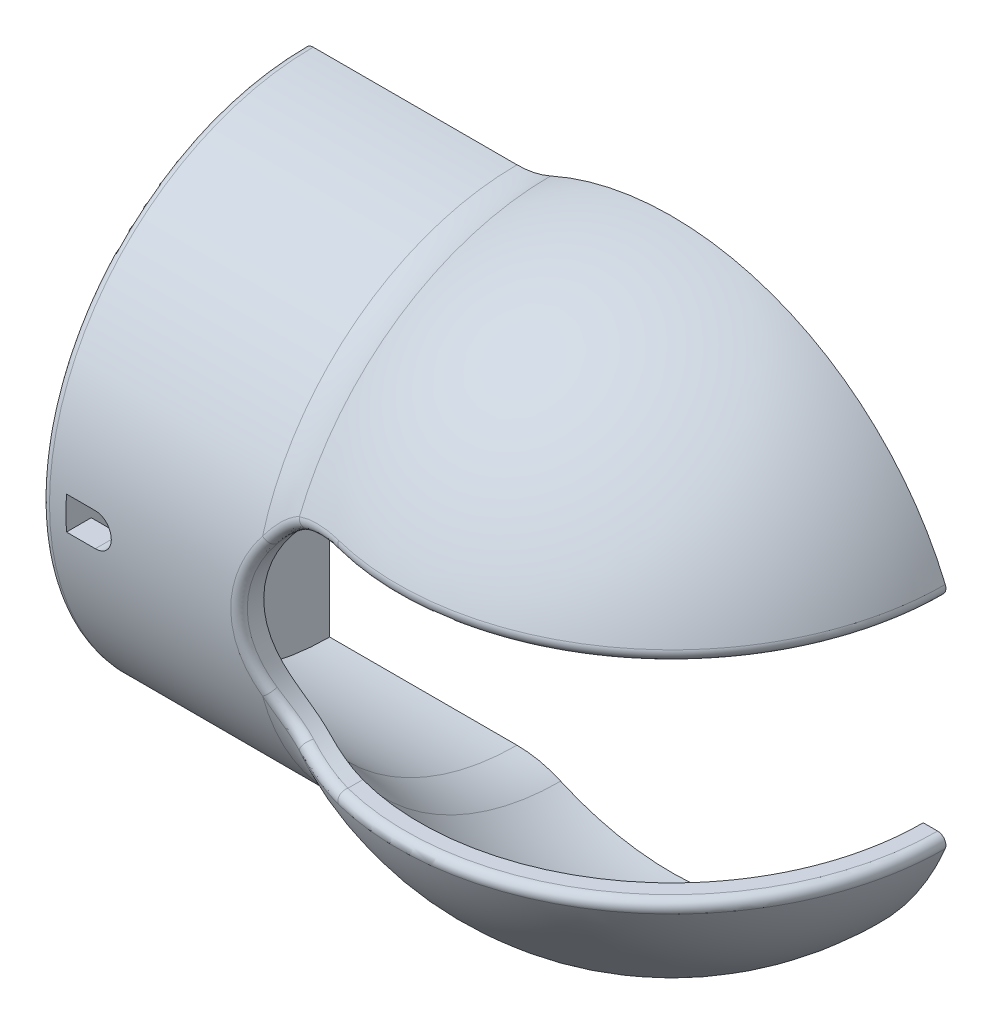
ISO-10303-21;
HEADER;
FILE_DESCRIPTION(('STEP AP214'),'2;1');
FILE_NAME('part.step','',(''),(''),'','','');
FILE_SCHEMA(('AUTOMOTIVE_DESIGN { 1 0 10303 214 1 1 1 1 }'));
ENDSEC;
DATA;
#1=APPLICATION_CONTEXT('core data for automotive mechanical design processes');
#2=APPLICATION_PROTOCOL_DEFINITION('international standard','automotive_design',2000,#1);
#3=PRODUCT_CONTEXT('',#1,'mechanical');
#4=PRODUCT('Part','Part','',(#3));
#5=PRODUCT_RELATED_PRODUCT_CATEGORY('part','',(#4));
#6=PRODUCT_DEFINITION_FORMATION('','',#4);
#7=PRODUCT_DEFINITION_CONTEXT('part definition',#1,'design');
#8=PRODUCT_DEFINITION('design','',#6,#7);
#9=PRODUCT_DEFINITION_SHAPE('','',#8);
#10=(LENGTH_UNIT() NAMED_UNIT(*) SI_UNIT(.MILLI.,.METRE.));
#11=(NAMED_UNIT(*) PLANE_ANGLE_UNIT() SI_UNIT($,.RADIAN.));
#12=(NAMED_UNIT(*) SI_UNIT($,.STERADIAN.) SOLID_ANGLE_UNIT());
#13=UNCERTAINTY_MEASURE_WITH_UNIT(LENGTH_MEASURE(1.E-05),#10,'distance_accuracy_value','');
#14=(GEOMETRIC_REPRESENTATION_CONTEXT(3) GLOBAL_UNCERTAINTY_ASSIGNED_CONTEXT((#13)) GLOBAL_UNIT_ASSIGNED_CONTEXT((#10,
#11,#12)) REPRESENTATION_CONTEXT('',''));
#15=CARTESIAN_POINT('',(0.,0.,0.));
#16=DIRECTION('',(0.,0.,1.));
#17=DIRECTION('',(1.,0.,0.));
#18=AXIS2_PLACEMENT_3D('',#15,#16,#17);
#19=CARTESIAN_POINT('',(0.,0.,0.));
#20=DIRECTION('',(-1.,0.,0.));
#21=DIRECTION('',(0.,-1.,0.));
#22=AXIS2_PLACEMENT_3D('',#19,#20,#21);
#23=SPHERICAL_SURFACE('',#22,36.);
#24=CARTESIAN_POINT('',(-14.6830406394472,0.,0.));
#25=DIRECTION('',(1.,0.,0.));
#26=DIRECTION('',(0.,0.,-1.));
#27=AXIS2_PLACEMENT_3D('',#24,#25,#26);
#28=CIRCLE('',#27,32.8695652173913);
#29=CARTESIAN_POINT('',(-14.6830406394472,32.8695652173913,9.00989832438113E-13));
#30=VERTEX_POINT('',#29);
#31=CARTESIAN_POINT('',(-14.6830406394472,12.2944250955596,30.4836911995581));
#32=VERTEX_POINT('',#31);
#33=EDGE_CURVE('E254',#30,#32,#28,.T.);
#34=ORIENTED_EDGE('',*,*,#33,.T.);
#35=CARTESIAN_POINT('',(-17.1573209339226,8.50843542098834,28.644571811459));
#36=CARTESIAN_POINT('',(-17.2333895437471,8.4265655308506,29.2324379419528));
#37=CARTESIAN_POINT('',(-17.6556580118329,8.7468068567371,29.5103057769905));
#38=CARTESIAN_POINT('',(-18.0779264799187,9.0670481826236,29.7881736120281));
#39=CARTESIAN_POINT('',(-18.4010467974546,9.45165626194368,29.4629881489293));
#40=CARTESIAN_POINT('',(-16.9159461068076,8.76826713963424,28.7173799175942));
#41=CARTESIAN_POINT('',(-16.9963606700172,8.6863691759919,29.3028463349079));
#42=CARTESIAN_POINT('',(-17.4086809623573,9.01609993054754,29.5810377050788));
#43=CARTESIAN_POINT('',(-17.8214038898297,9.34538168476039,29.8591131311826));
#44=CARTESIAN_POINT('',(-18.1329138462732,9.74029218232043,29.5378764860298));
#45=CARTESIAN_POINT('',(-16.663842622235,9.01737757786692,28.7931412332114));
#46=CARTESIAN_POINT('',(-16.7483495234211,8.93610220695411,29.3762112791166));
#47=CARTESIAN_POINT('',(-17.1505082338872,9.27462512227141,29.6546863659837));
#48=CARTESIAN_POINT('',(-17.5531227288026,9.61272552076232,29.9330318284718));
#49=CARTESIAN_POINT('',(-17.8528628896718,10.0170182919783,29.6158024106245));
#50=CARTESIAN_POINT('',(-16.140249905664,9.49268656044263,28.9498285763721));
#51=CARTESIAN_POINT('',(-16.2325982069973,9.41339885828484,29.5280599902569));
#52=CARTESIAN_POINT('',(-16.6138294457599,9.76854913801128,29.8071071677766));
#53=CARTESIAN_POINT('',(-16.995509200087,10.1232896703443,30.086027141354));
#54=CARTESIAN_POINT('',(-17.2712261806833,10.5450186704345,29.7769665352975));
#55=CARTESIAN_POINT('',(-15.8687643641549,9.7188894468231,29.0307536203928));
#56=CARTESIAN_POINT('',(-15.9649194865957,9.64098126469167,29.6065269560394));
#57=CARTESIAN_POINT('',(-16.3353272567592,10.0039523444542,29.8858783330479));
#58=CARTESIAN_POINT('',(-16.7062427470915,10.3665308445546,30.1650868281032));
#59=CARTESIAN_POINT('',(-16.9696445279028,10.796297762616,29.8602037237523));
#60=CARTESIAN_POINT('',(-15.308228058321,10.1471343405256,29.1971017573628));
#61=CARTESIAN_POINT('',(-15.4115389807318,10.0726491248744,29.7679457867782));
#62=CARTESIAN_POINT('',(-15.7597901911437,10.4502709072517,30.0479071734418));
#63=CARTESIAN_POINT('',(-16.1085502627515,10.8274969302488,30.327725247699));
#64=CARTESIAN_POINT('',(-16.3469687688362,11.2720166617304,30.0313046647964));
#65=CARTESIAN_POINT('',(-15.0191674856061,10.3491626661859,29.2825273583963));
#66=CARTESIAN_POINT('',(-15.1258795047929,10.2767467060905,29.8508862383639));
#67=CARTESIAN_POINT('',(-15.4627449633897,10.6611723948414,30.1311673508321));
#68=CARTESIAN_POINT('',(-15.8001695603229,11.0452353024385,30.4112924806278));
#69=CARTESIAN_POINT('',(-16.0258637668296,11.4964412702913,30.1191709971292));
#70=CARTESIAN_POINT('',(-14.4257193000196,10.7277208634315,29.4571075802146));
#71=CARTESIAN_POINT('',(-14.5386917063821,10.6599927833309,30.0205102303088));
#72=CARTESIAN_POINT('',(-14.8523736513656,11.05701784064,30.3014320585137));
#73=CARTESIAN_POINT('',(-15.1666132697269,11.4536813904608,30.5821983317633));
#74=CARTESIAN_POINT('',(-15.3666276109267,11.9169653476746,30.2987392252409));
#75=CARTESIAN_POINT('',(-14.1213312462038,10.9042500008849,29.5462623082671));
#76=CARTESIAN_POINT('',(-14.2372091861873,10.8391748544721,30.1071820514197));
#77=CARTESIAN_POINT('',(-14.5390470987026,11.2419610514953,30.3884366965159));
#78=CARTESIAN_POINT('',(-14.8414865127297,11.6444256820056,30.6695251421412));
#79=CARTESIAN_POINT('',(-15.0284959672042,12.1130640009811,30.3904412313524));
#80=CARTESIAN_POINT('',(-13.4884967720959,11.2364826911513,29.7307513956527));
#81=CARTESIAN_POINT('',(-13.6096934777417,11.1772355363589,30.2866496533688));
#82=CARTESIAN_POINT('',(-13.887081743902,11.5907201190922,30.5685880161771));
#83=CARTESIAN_POINT('',(-14.1651129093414,12.0038605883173,30.8503487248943));
#84=CARTESIAN_POINT('',(-14.32550727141,12.4821270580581,30.5802014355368));
#85=CARTESIAN_POINT('',(-13.1595812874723,11.3912423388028,29.8261928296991));
#86=CARTESIAN_POINT('',(-13.2831916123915,11.3352422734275,30.3795493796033));
#87=CARTESIAN_POINT('',(-13.5479409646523,11.753571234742,30.6618430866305));
#88=CARTESIAN_POINT('',(-13.813372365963,12.1716085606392,30.9439502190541));
#89=CARTESIAN_POINT('',(-13.9601291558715,12.6540429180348,30.6783697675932));
#90=CARTESIAN_POINT('',(-12.4900566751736,11.6713786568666,30.0195130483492));
#91=CARTESIAN_POINT('',(-12.6178036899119,11.6221997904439,30.5678450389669));
#92=CARTESIAN_POINT('',(-12.8570282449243,12.0491256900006,30.850849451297));
#93=CARTESIAN_POINT('',(-13.0969334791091,12.4757602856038,31.1336676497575));
#94=CARTESIAN_POINT('',(-13.2163829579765,12.9652343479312,30.8772134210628));
#95=CARTESIAN_POINT('',(-12.1494472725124,11.79675463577,30.1173918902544));
#96=CARTESIAN_POINT('',(-12.2789511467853,11.7512030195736,30.6632334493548));
#97=CARTESIAN_POINT('',(-12.5052560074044,12.1818283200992,30.9466008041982));
#98=CARTESIAN_POINT('',(-12.7322704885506,12.612220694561,31.2297760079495));
#99=CARTESIAN_POINT('',(-12.83801457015,13.1045091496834,30.9778888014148));
#100=CARTESIAN_POINT('',(-11.4596023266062,12.0171565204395,30.3146463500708));
#101=CARTESIAN_POINT('',(-11.5919078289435,11.9790462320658,30.8555855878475));
#102=CARTESIAN_POINT('',(-11.792241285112,12.4159764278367,31.1396778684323));
#103=CARTESIAN_POINT('',(-11.9932806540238,12.8526747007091,31.4235789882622));
#104=CARTESIAN_POINT('',(-12.071695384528,13.3493441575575,31.1807791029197));
#105=CARTESIAN_POINT('',(-11.110382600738,12.1122341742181,30.4140191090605));
#106=CARTESIAN_POINT('',(-11.2437591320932,12.0779950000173,30.9525413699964));
#107=CARTESIAN_POINT('',(-11.4310161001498,12.5174751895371,31.2370005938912));
#108=CARTESIAN_POINT('',(-11.6189976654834,12.9567854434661,31.5212656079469));
#109=CARTESIAN_POINT('',(-11.6837621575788,13.4549618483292,31.2829910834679));
#110=CARTESIAN_POINT('',(-10.4053697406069,12.2717047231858,30.6136434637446));
#111=CARTESIAN_POINT('',(-10.5401846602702,12.2452697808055,31.1474179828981));
#112=CARTESIAN_POINT('',(-10.7012261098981,12.688773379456,31.4326107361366));
#113=CARTESIAN_POINT('',(-10.8629896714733,13.1321073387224,31.717609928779));
#114=CARTESIAN_POINT('',(-10.9005935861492,13.6321108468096,31.4883189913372));
#115=CARTESIAN_POINT('',(-10.0495795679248,12.3361111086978,30.7138946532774));
#116=CARTESIAN_POINT('',(-10.1847763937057,12.3136698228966,31.2453365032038));
#117=CARTESIAN_POINT('',(-10.3326646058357,12.7585867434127,31.5308977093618));
#118=CARTESIAN_POINT('',(-10.4812825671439,13.2033980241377,31.8162653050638));
#119=CARTESIAN_POINT('',(-10.5053615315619,13.7036571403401,31.5914345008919));
#120=CARTESIAN_POINT('',(-9.41141394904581,12.4232837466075,30.8928300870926));
#121=CARTESIAN_POINT('',(-9.5465514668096,12.4079321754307,31.4202325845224));
#122=CARTESIAN_POINT('',(-9.67113360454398,12.8544030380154,31.7064137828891));
#123=CARTESIAN_POINT('',(-9.79616352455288,13.3008089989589,31.9924761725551));
#124=CARTESIAN_POINT('',(-9.79645069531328,13.8004934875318,31.7754823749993));
#125=CARTESIAN_POINT('',(-9.12983424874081,12.4520484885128,30.9714809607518));
#126=CARTESIAN_POINT('',(-9.26479945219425,12.4398181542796,31.4971220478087));
#127=CARTESIAN_POINT('',(-9.37908764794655,12.8866208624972,31.7835914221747));
#128=CARTESIAN_POINT('',(-9.49382261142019,13.3333895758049,32.0699431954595));
#129=CARTESIAN_POINT('',(-9.483655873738,13.8324470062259,31.8563804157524));
#130=CARTESIAN_POINT('',(-8.56553144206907,12.4903999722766,31.1285042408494));
#131=CARTESIAN_POINT('',(-8.69975514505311,12.4843285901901,31.6506839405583));
#132=CARTESIAN_POINT('',(-8.79350976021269,12.9311437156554,31.9377293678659));
#133=CARTESIAN_POINT('',(-8.88770980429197,13.377925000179,32.2246575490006));
#134=CARTESIAN_POINT('',(-8.85679607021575,13.8750500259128,32.0178900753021));
#135=CARTESIAN_POINT('',(-8.28280935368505,12.5000011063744,31.206876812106));
#136=CARTESIAN_POINT('',(-8.41646267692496,12.4969970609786,31.7273578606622));
#137=CARTESIAN_POINT('',(-8.4999791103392,12.9434636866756,32.0146897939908));
#138=CARTESIAN_POINT('',(-8.58393721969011,13.3899269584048,32.3019063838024));
#139=CARTESIAN_POINT('',(-8.54273221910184,13.8857155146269,32.098501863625));
#140=CARTESIAN_POINT('',(-7.64270418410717,12.4999986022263,31.3836549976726));
#141=CARTESIAN_POINT('',(-7.77476848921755,12.5037874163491,31.9003279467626));
#142=CARTESIAN_POINT('',(-7.83508075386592,12.9487409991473,32.1883418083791));
#143=CARTESIAN_POINT('',(-7.89609559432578,13.393688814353,32.4761721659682));
#144=CARTESIAN_POINT('',(-7.83166681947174,13.8857127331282,32.2803308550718));
#145=CARTESIAN_POINT('',(-7.28526908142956,12.4846707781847,31.4819002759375));
#146=CARTESIAN_POINT('',(-7.41606653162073,12.4921997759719,31.9965208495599));
#147=CARTESIAN_POINT('',(-7.46357429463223,12.9357439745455,32.2848915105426));
#148=CARTESIAN_POINT('',(-7.51176801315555,13.3793416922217,32.5730847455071));
#149=CARTESIAN_POINT('',(-7.43460748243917,13.8686857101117,32.3813831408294));
#150=CARTESIAN_POINT('',(-6.57250990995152,12.4233779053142,31.6769087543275));
#151=CARTESIAN_POINT('',(-6.70023566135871,12.4380763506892,32.1875257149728));
#152=CARTESIAN_POINT('',(-6.72233599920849,12.8778112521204,32.4766099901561));
#153=CARTESIAN_POINT('',(-6.74512280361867,13.3175998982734,32.7655167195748));
#154=CARTESIAN_POINT('',(-6.64283386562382,13.8005980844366,32.5819632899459));
#155=CARTESIAN_POINT('',(-6.21718700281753,12.3773973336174,31.7736711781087));
#156=CARTESIAN_POINT('',(-6.34308773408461,12.3955808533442,32.2823440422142));
#157=CARTESIAN_POINT('',(-6.35260515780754,12.8328593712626,32.5717780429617));
#158=CARTESIAN_POINT('',(-6.36278437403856,13.2702481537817,32.8610425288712));
#159=CARTESIAN_POINT('',(-6.24812087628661,13.7495202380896,32.6814903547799));
#160=CARTESIAN_POINT('',(-5.50911334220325,12.2546041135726,31.9656342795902));
#161=CARTESIAN_POINT('',(-5.63088413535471,12.2793854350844,32.4705105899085));
#162=CARTESIAN_POINT('',(-5.61543501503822,12.7107679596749,32.7606462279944));
#163=CARTESIAN_POINT('',(-5.60065236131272,13.1422602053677,33.0506110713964));
#164=CARTESIAN_POINT('',(-5.46155219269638,13.6131145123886,32.8789381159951));
#165=CARTESIAN_POINT('',(-5.15639233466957,12.1776014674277,32.0608214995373));
#166=CARTESIAN_POINT('',(-5.275823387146,12.2055453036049,32.5638560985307));
#167=CARTESIAN_POINT('',(-5.24802427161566,12.6334299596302,32.854333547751));
#168=CARTESIAN_POINT('',(-5.22085469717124,13.0614743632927,33.1446510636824));
#169=CARTESIAN_POINT('',(-5.06972954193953,13.527575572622,32.9768449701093));
#170=CARTESIAN_POINT('',(-4.4584635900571,11.9932474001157,32.2483580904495));
#171=CARTESIAN_POINT('',(-4.57282950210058,12.0270587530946,32.7478143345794));
#172=CARTESIAN_POINT('',(-4.52067953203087,12.4469967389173,33.0389758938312));
#173=CARTESIAN_POINT('',(-4.46916636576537,12.8670995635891,33.3299759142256));
#174=CARTESIAN_POINT('',(-4.29443041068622,13.3227845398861,33.1697397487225));
#175=CARTESIAN_POINT('',(-4.1132531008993,11.8859073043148,32.340708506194));
#176=CARTESIAN_POINT('',(-4.22485864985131,11.922471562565,32.8384387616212));
#177=CARTESIAN_POINT('',(-4.16074279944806,12.3379133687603,33.1299319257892));
#178=CARTESIAN_POINT('',(-4.09723476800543,12.7535735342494,33.4212725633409));
#179=CARTESIAN_POINT('',(-3.91095087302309,13.2035450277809,33.2647287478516));
#180=CARTESIAN_POINT('',(-3.77300810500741,11.763610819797,32.4313493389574));
#181=CARTESIAN_POINT('',(-3.88139733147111,11.8025580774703,32.9274843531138));
#182=CARTESIAN_POINT('',(-3.805825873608,12.2131526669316,33.2192309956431));
#183=CARTESIAN_POINT('',(-3.73025441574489,12.623747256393,33.5109776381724));
#184=CARTESIAN_POINT('',(-3.53298728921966,13.0676911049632,33.3579593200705));
#185=(BOUNDED_SURFACE() B_SPLINE_SURFACE(3,2,((#35,#36,#37,#38,#39),(#40,#41,#42,#43,#44),(#45,
#46,#47,#48,#49),(#50,#51,#52,#53,#54),(#55,#56,#57,#58,#59),(#60,#61,#62,#63,#64),(#65,#66,#67,
#68,#69),(#70,#71,#72,#73,#74),(#75,#76,#77,#78,#79),(#80,#81,#82,#83,#84),(#85,#86,#87,#88,
#89),(#90,#91,#92,#93,#94),(#95,#96,#97,#98,#99),(#100,#101,#102,#103,#104),(#105,#106,#107,
#108,#109),(#110,#111,#112,#113,#114),(#115,#116,#117,#118,#119),(#120,#121,#122,#123,#124),
(#125,#126,#127,#128,#129),(#130,#131,#132,#133,#134),(#135,#136,#137,#138,#139),(#140,#141,
#142,#143,#144),(#145,#146,#147,#148,#149),(#150,#151,#152,#153,#154),(#155,#156,#157,#158,
#159),(#160,#161,#162,#163,#164),(#165,#166,#167,#168,#169),(#170,#171,#172,#173,#174),(#175,
#176,#177,#178,#179),(#180,#181,#182,#183,#184)),.UNSPECIFIED.,.F.,.F.,
.F.) B_SPLINE_SURFACE_WITH_KNOTS((4,2,2,2,2,2,2,2,2,2,2,2,2,2,4),(3,2,3),(0.,1.16922882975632,
2.33823562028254,3.50790091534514,4.6775998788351,5.88819464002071,7.09881788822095,
8.3073622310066,9.51537452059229,10.4616523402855,11.4072192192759,12.6018299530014,
13.7970461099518,14.9996965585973,16.201898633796),(0.,0.5,1.),
.UNSPECIFIED.) GEOMETRIC_REPRESENTATION_ITEM() RATIONAL_B_SPLINE_SURFACE(((1.,0.858100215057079,
1.,0.858100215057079,1.),(1.,0.858780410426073,1.,0.858780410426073,1.),(1.,0.859484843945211,
1.,0.859484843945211,1.),(1.,0.860934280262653,1.,0.860934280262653,1.),(1.,0.861679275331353,
1.,0.861679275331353,1.),(1.,0.863202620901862,1.,0.863202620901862,1.),(1.,0.863980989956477,
1.,0.863980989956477,1.),(1.,0.865563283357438,1.,0.865563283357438,1.),(1.,0.86636720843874,1.,
0.86636720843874,1.),(1.,0.868021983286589,1.,0.868021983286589,1.),(1.,0.868873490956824,1.,
0.868873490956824,1.),(1.,0.870588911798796,1.,0.870588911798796,1.),(1.,0.871452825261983,1.,
0.871452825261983,1.),(1.,0.873184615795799,1.,0.873184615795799,1.),(1.,0.874052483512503,1.,
0.874052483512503,1.),(1.,0.875786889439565,1.,0.875786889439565,1.),(1.,0.876653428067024,1.,
0.876653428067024,1.),(1.,0.878192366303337,1.,0.878192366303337,1.),(1.,0.878866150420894,1.,
0.878866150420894,1.),(1.,0.880206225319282,1.,0.880206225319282,1.),(1.,0.880872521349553,1.,
0.880872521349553,1.),(1.,0.882369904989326,1.,0.882369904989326,1.),(1.,0.883198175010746,1.,
0.883198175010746,1.),(1.,0.884834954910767,1.,0.884834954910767,1.),(1.,0.885643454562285,1.,
0.885643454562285,1.),(1.,0.887240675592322,1.,0.887240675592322,1.),(1.,0.888029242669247,1.,
0.888029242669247,1.),(1.,0.889576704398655,1.,0.889576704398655,1.),(1.,0.890335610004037,1.,
0.890335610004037,1.),(1.,0.891077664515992,1.,0.891077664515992,1.))) REPRESENTATION_ITEM('') SURFACE());
#186=CARTESIAN_POINT('',(-18.4010467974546,9.45165626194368,29.4629881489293));
#187=CARTESIAN_POINT('',(-18.1329138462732,9.74029218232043,29.5378764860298));
#188=CARTESIAN_POINT('',(-17.8528628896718,10.0170182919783,29.6158024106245));
#189=CARTESIAN_POINT('',(-17.2712261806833,10.5450186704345,29.7769665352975));
#190=CARTESIAN_POINT('',(-16.9696445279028,10.796297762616,29.8602037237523));
#191=CARTESIAN_POINT('',(-16.3469687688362,11.2720166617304,30.0313046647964));
#192=CARTESIAN_POINT('',(-16.0258637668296,11.4964412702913,30.1191709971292));
#193=CARTESIAN_POINT('',(-15.3666276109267,11.9169653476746,30.2987392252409));
#194=CARTESIAN_POINT('',(-15.0284959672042,12.1130640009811,30.3904412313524));
#195=CARTESIAN_POINT('',(-14.32550727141,12.4821270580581,30.5802014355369));
#196=CARTESIAN_POINT('',(-13.9601291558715,12.6540429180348,30.6783697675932));
#197=CARTESIAN_POINT('',(-13.2163829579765,12.9652343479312,30.8772134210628));
#198=CARTESIAN_POINT('',(-12.83801457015,13.1045091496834,30.9778888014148));
#199=CARTESIAN_POINT('',(-12.071695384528,13.3493441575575,31.1807791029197));
#200=CARTESIAN_POINT('',(-11.6837621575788,13.4549618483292,31.2829910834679));
#201=CARTESIAN_POINT('',(-10.9005935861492,13.6321108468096,31.4883189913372));
#202=CARTESIAN_POINT('',(-10.5053615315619,13.7036571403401,31.5914345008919));
#203=CARTESIAN_POINT('',(-9.79645069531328,13.8004934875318,31.7754823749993));
#204=CARTESIAN_POINT('',(-9.483655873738,13.8324470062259,31.8563804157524));
#205=CARTESIAN_POINT('',(-8.85679607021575,13.8750500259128,32.0178900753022));
#206=CARTESIAN_POINT('',(-8.54273221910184,13.8857155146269,32.098501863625));
#207=CARTESIAN_POINT('',(-7.83166681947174,13.8857127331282,32.2803308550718));
#208=CARTESIAN_POINT('',(-7.43460748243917,13.8686857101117,32.3813831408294));
#209=CARTESIAN_POINT('',(-6.64283386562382,13.8005980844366,32.5819632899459));
#210=CARTESIAN_POINT('',(-6.24812087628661,13.7495202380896,32.6814903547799));
#211=CARTESIAN_POINT('',(-5.46155219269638,13.6131145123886,32.8789381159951));
#212=CARTESIAN_POINT('',(-5.06972954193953,13.527575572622,32.9768449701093));
#213=CARTESIAN_POINT('',(-4.29443041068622,13.3227845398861,33.1697397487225));
#214=CARTESIAN_POINT('',(-3.91095087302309,13.2035450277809,33.2647287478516));
#215=CARTESIAN_POINT('',(-3.53298728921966,13.0676911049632,33.3579593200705));
#216=B_SPLINE_CURVE_WITH_KNOTS('',3,(#186,#187,#188,#189,#190,#191,#192,#193,#194,#195,#196,
#197,#198,#199,#200,#201,#202,#203,#204,#205,#206,#207,#208,#209,#210,#211,#212,#213,#214,#215),
.UNSPECIFIED.,.F.,.F.,(4,2,2,2,2,2,2,2,2,2,2,2,2,2,4),(0.,1.16922882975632,2.33823562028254,
3.50790091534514,4.6775998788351,5.88819464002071,7.09881788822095,8.3073622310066,
9.51537452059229,10.4616523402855,11.4072192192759,12.6018299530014,13.7970461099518,
14.9996965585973,16.201898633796),.UNSPECIFIED.);
#217=CARTESIAN_POINT('',(-8.22857142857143,13.8857142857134,32.1788370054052));
#218=VERTEX_POINT('',#217);
#219=EDGE_CURVE('E418',#32,#218,#216,.T.);
#220=ORIENTED_EDGE('',*,*,#219,.T.);
#221=CARTESIAN_POINT('',(0.,13.8857142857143,3.80622235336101E-13));
#222=DIRECTION('',(0.,-1.,0.));
#223=DIRECTION('',(0.,0.,-1.));
#224=AXIS2_PLACEMENT_3D('',#221,#222,#223);
#225=CIRCLE('',#224,33.2142580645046);
#226=CARTESIAN_POINT('',(33.2142580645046,13.8857142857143,3.80622235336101E-13));
#227=VERTEX_POINT('',#226);
#228=EDGE_CURVE('E415',#218,#227,#225,.F.);
#229=ORIENTED_EDGE('',*,*,#228,.T.);
#230=CARTESIAN_POINT('',(0.,0.,0.));
#231=DIRECTION('',(0.,0.,-1.));
#232=DIRECTION('',(1.,0.,0.));
#233=AXIS2_PLACEMENT_3D('',#230,#231,#232);
#234=CIRCLE('',#233,36.);
#235=EDGE_CURVE('E240',#30,#227,#234,.T.);
#236=ORIENTED_EDGE('',*,*,#235,.F.);
#237=EDGE_LOOP('',(#34,#220,#229,#236));
#238=FACE_BOUND('',#237,.T.);
#239=ADVANCED_FACE('F31',(#238),#23,.T.);
#240=CARTESIAN_POINT('',(-18.7616630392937,0.,0.));
#241=DIRECTION('',(1.,0.,0.));
#242=DIRECTION('',(0.,0.,-1.));
#243=AXIS2_PLACEMENT_3D('',#240,#241,#242);
#244=TOROIDAL_SURFACE('',#243,42.,10.);
#245=CARTESIAN_POINT('',(-14.6830406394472,-12.2944250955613,30.4836911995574));
#246=VERTEX_POINT('',#245);
#247=CARTESIAN_POINT('',(-14.6830406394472,-32.8695652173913,-9.00989832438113E-13));
#248=VERTEX_POINT('',#247);
#249=EDGE_CURVE('E253',#246,#248,#28,.T.);
#250=ORIENTED_EDGE('',*,*,#249,.F.);
#251=CARTESIAN_POINT('',(-11.8081873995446,-11.9057846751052,30.6488532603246));
#252=CARTESIAN_POINT('',(-12.1053354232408,-11.8107388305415,31.124529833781));
#253=CARTESIAN_POINT('',(-12.4061541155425,-12.2278913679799,31.3676156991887));
#254=CARTESIAN_POINT('',(-12.7069728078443,-12.6450439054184,31.6107015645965));
#255=CARTESIAN_POINT('',(-12.717280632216,-13.1664461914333,31.3834742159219));
#256=CARTESIAN_POINT('',(-11.9670969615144,-11.8549889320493,30.5305535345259));
#257=CARTESIAN_POINT('',(-12.2515051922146,-11.7596149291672,31.0168704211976));
#258=CARTESIAN_POINT('',(-12.5517854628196,-12.1777763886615,31.2641508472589));
#259=CARTESIAN_POINT('',(-12.8523915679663,-12.5958071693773,31.5112462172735));
#260=CARTESIAN_POINT('',(-12.8733009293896,-13.1160635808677,31.2761412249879));
#261=CARTESIAN_POINT('',(-12.1295468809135,-11.7994891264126,30.4200648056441));
#262=CARTESIAN_POINT('',(-12.3999665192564,-11.7046268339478,30.9165245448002));
#263=CARTESIAN_POINT('',(-12.6998123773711,-12.1233261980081,31.1676844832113));
#264=CARTESIAN_POINT('',(-12.999853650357,-12.5419439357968,31.4187394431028));
#265=CARTESIAN_POINT('',(-13.032797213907,-13.0602394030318,31.1762580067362));
#266=CARTESIAN_POINT('',(-12.4596374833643,-11.6787116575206,30.2157261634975));
#267=CARTESIAN_POINT('',(-12.7008736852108,-11.5863865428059,30.730596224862));
#268=CARTESIAN_POINT('',(-12.9994684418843,-12.0053514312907,30.9891790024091));
#269=CARTESIAN_POINT('',(-13.2982343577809,-12.4242536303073,31.2476483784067));
#270=CARTESIAN_POINT('',(-13.3568861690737,-12.9372084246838,30.9923573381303));
#271=CARTESIAN_POINT('',(-12.6272769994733,-11.6134361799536,30.1218725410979));
#272=CARTESIAN_POINT('',(-12.8532092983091,-11.5231709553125,30.6450991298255));
#273=CARTESIAN_POINT('',(-13.1510967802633,-11.9418288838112,30.907136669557));
#274=CARTESIAN_POINT('',(-13.4490431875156,-12.3604612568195,31.1691429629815));
#275=CARTESIAN_POINT('',(-13.5214776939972,-12.8700041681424,30.9083363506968));
#276=CARTESIAN_POINT('',(-12.9636405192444,-11.4736664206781,29.9529169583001));
#277=CARTESIAN_POINT('',(-13.1586751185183,-11.3890507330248,30.4903759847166));
#278=CARTESIAN_POINT('',(-13.4547663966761,-11.8062063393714,30.7588718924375));
#279=CARTESIAN_POINT('',(-13.7509244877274,-12.2233313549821,31.0273376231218));
#280=CARTESIAN_POINT('',(-13.8517255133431,-12.724680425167,30.7580999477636));
#281=CARTESIAN_POINT('',(-13.132319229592,-11.399308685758,29.8775786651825));
#282=CARTESIAN_POINT('',(-13.3116415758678,-11.3183135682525,30.4210157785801));
#283=CARTESIAN_POINT('',(-13.6067743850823,-11.7342338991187,30.6924505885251));
#284=CARTESIAN_POINT('',(-13.9018419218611,-12.1501869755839,30.9639109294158));
#285=CARTESIAN_POINT('',(-14.0173373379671,-12.6467207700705,30.6916591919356));
#286=CARTESIAN_POINT('',(-13.4709044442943,-11.2407365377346,29.7442922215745));
#287=CARTESIAN_POINT('',(-13.6192210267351,-11.1682867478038,30.2971444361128));
#288=CARTESIAN_POINT('',(-13.9120489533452,-11.5808680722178,30.5739978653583));
#289=CARTESIAN_POINT('',(-14.2048104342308,-11.9934828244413,30.8508768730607));
#290=CARTESIAN_POINT('',(-14.3497664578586,-12.4792041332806,30.5753403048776));
#291=CARTESIAN_POINT('',(-13.6408109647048,-11.1565219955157,29.6863442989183));
#292=CARTESIAN_POINT('',(-13.7737021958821,-11.0890646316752,30.2426799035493));
#293=CARTESIAN_POINT('',(-14.0653155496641,-11.499474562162,30.5219666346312));
#294=CARTESIAN_POINT('',(-14.3567318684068,-11.909994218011,30.8013119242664));
#295=CARTESIAN_POINT('',(-14.5165837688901,-12.3896469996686,30.5254623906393));
#296=CARTESIAN_POINT('',(-14.0220770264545,-10.9563539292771,29.5752017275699));
#297=CARTESIAN_POINT('',(-14.1216382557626,-10.9012051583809,30.1365733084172));
#298=CARTESIAN_POINT('',(-14.4101733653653,-11.3057824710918,30.4207648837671));
#299=CARTESIAN_POINT('',(-14.6984101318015,-11.7105285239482,30.7050430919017));
#300=CARTESIAN_POINT('',(-14.8909177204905,-12.175508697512,30.4315258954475));
#301=CARTESIAN_POINT('',(-14.2332311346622,-10.8377170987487,29.5267779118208));
#302=CARTESIAN_POINT('',(-14.3150724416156,-10.7902557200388,30.0890188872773));
#303=CARTESIAN_POINT('',(-14.6018110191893,-11.1908334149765,30.3755279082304));
#304=CARTESIAN_POINT('',(-14.8880252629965,-11.5917480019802,30.6621311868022));
#305=CARTESIAN_POINT('',(-15.0982326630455,-12.0477575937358,30.3920037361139));
#306=CARTESIAN_POINT('',(-14.6508686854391,-10.5865675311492,29.4545881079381));
#307=CARTESIAN_POINT('',(-14.7004489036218,-10.5549996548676,30.0152947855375));
#308=CARTESIAN_POINT('',(-14.9831176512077,-10.9465331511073,30.3056746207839));
#309=CARTESIAN_POINT('',(-15.2652647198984,-11.338399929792,30.5961518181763));
#310=CARTESIAN_POINT('',(-15.5082768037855,-11.7758006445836,30.3363305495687));
#311=CARTESIAN_POINT('',(-14.8573497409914,-10.4540478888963,29.4308344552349));
#312=CARTESIAN_POINT('',(-14.8921889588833,-10.4308484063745,29.9891165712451));
#313=CARTESIAN_POINT('',(-15.1727855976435,-10.8171747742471,30.28106862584));
#314=CARTESIAN_POINT('',(-15.4526922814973,-11.2040028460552,30.5730751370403));
#315=CARTESIAN_POINT('',(-15.7110036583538,-11.6315866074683,30.3201912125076));
#316=CARTESIAN_POINT('',(-15.2636270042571,-10.1759791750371,29.4049694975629));
#317=CARTESIAN_POINT('',(-15.2725658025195,-10.1692155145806,29.9560870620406));
#318=CARTESIAN_POINT('',(-15.5487049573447,-10.5443116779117,30.2504739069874));
#319=CARTESIAN_POINT('',(-15.8241539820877,-10.9199078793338,30.5449186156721));
#320=CARTESIAN_POINT('',(-16.1098940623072,-11.327733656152,30.3083564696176));
#321=CARTESIAN_POINT('',(-15.463394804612,-10.0303824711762,29.4029408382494));
#322=CARTESIAN_POINT('',(-15.4610520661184,-10.0318354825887,29.949251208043));
#323=CARTESIAN_POINT('',(-15.7349406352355,-10.4007550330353,30.2445563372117));
#324=CARTESIAN_POINT('',(-16.0080410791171,-10.7703202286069,30.5398521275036));
#325=CARTESIAN_POINT('',(-16.3060297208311,-11.1680381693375,30.3127390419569));
#326=CARTESIAN_POINT('',(-15.8535005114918,-9.7279757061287,29.4172469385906));
#327=CARTESIAN_POINT('',(-15.8320968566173,-9.74492957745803,29.9525714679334));
#328=CARTESIAN_POINT('',(-16.1013537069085,-10.1009259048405,30.2490957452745));
#329=CARTESIAN_POINT('',(-16.3698159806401,-10.4575716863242,30.5456097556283));
#330=CARTESIAN_POINT('',(-16.6890425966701,-10.8353469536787,30.3387262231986));
#331=CARTESIAN_POINT('',(-16.0438392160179,-9.57116659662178,29.4335801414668));
#332=CARTESIAN_POINT('',(-16.0145840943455,-9.59553217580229,29.9626522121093));
#333=CARTESIAN_POINT('',(-16.2815316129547,-9.94465450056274,30.2595513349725));
#334=CARTESIAN_POINT('',(-16.5476352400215,-10.2945522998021,30.556362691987));
#335=CARTESIAN_POINT('',(-16.8759205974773,-10.6623523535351,30.3603293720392));
#336=CARTESIAN_POINT('',(-16.5519977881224,-9.12673757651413,29.4987457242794));
#337=CARTESIAN_POINT('',(-16.5045061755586,-9.17038673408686,30.0097830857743));
#338=CARTESIAN_POINT('',(-16.7659383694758,-9.49941494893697,30.3070940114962));
#339=CARTESIAN_POINT('',(-17.0248851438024,-9.83072794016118,30.6041695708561));
#340=CARTESIAN_POINT('',(-17.3748399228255,-10.1709838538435,30.4385498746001));
#341=CARTESIAN_POINT('',(-16.8591122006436,-8.82872042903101,29.5627265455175));
#342=CARTESIAN_POINT('',(-16.8051426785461,-8.88255638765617,30.0611772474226));
#343=CARTESIAN_POINT('',(-17.0625484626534,-9.19834547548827,30.3582210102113));
#344=CARTESIAN_POINT('',(-17.3175885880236,-9.51680182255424,30.6547146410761));
#345=CARTESIAN_POINT('',(-17.676370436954,-9.84034475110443,30.5092631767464));
#346=CARTESIAN_POINT('',(-17.438262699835,-8.20671533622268,29.7185838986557));
#347=CARTESIAN_POINT('',(-17.3772168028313,-8.27637990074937,30.1926677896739));
#348=CARTESIAN_POINT('',(-17.6271036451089,-8.56542888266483,30.4881053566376));
#349=CARTESIAN_POINT('',(-17.8745905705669,-8.8571533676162,30.782996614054));
#350=CARTESIAN_POINT('',(-18.2449909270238,-9.14883786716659,30.6760325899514));
#351=CARTESIAN_POINT('',(-17.7103004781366,-7.88272864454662,29.8104590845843));
#352=CARTESIAN_POINT('',(-17.6489329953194,-7.95825594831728,30.2725300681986));
#353=CARTESIAN_POINT('',(-17.8950501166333,-8.23358324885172,30.5668613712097));
#354=CARTESIAN_POINT('',(-18.1391601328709,-8.51166093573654,30.8605119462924));
#355=CARTESIAN_POINT('',(-18.5120825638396,-8.78797154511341,30.7720874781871));
#356=CARTESIAN_POINT('',(-18.1762718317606,-7.26749273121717,29.9915547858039));
#357=CARTESIAN_POINT('',(-18.1173617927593,-7.34981814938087,30.4331534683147));
#358=CARTESIAN_POINT('',(-18.3570720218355,-7.60028707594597,30.7248875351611));
#359=CARTESIAN_POINT('',(-18.5953905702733,-7.85266421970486,31.0161408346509));
#360=CARTESIAN_POINT('',(-18.9695817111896,-8.10208179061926,30.9590237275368));
#361=CARTESIAN_POINT('',(-18.375662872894,-6.97980653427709,30.0786583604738));
#362=CARTESIAN_POINT('',(-18.3190341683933,-7.06406342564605,30.5114086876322));
#363=CARTESIAN_POINT('',(-18.5560122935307,-7.30300955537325,30.8018773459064));
#364=CARTESIAN_POINT('',(-18.7918596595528,-7.54380282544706,31.0918695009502));
#365=CARTESIAN_POINT('',(-19.1653474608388,-7.78113064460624,31.0480921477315));
#366=CARTESIAN_POINT('',(-18.7494370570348,-6.38919316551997,30.2557211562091));
#367=CARTESIAN_POINT('',(-18.6983713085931,-6.47507885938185,30.6719616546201));
#368=CARTESIAN_POINT('',(-18.930505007,-6.69090560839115,30.9597981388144));
#369=CARTESIAN_POINT('',(-19.1615132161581,-6.90857302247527,31.247159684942));
#370=CARTESIAN_POINT('',(-19.5323257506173,-7.12205965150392,31.2280109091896));
#371=CARTESIAN_POINT('',(-18.9238112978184,-6.08626061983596,30.345681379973));
#372=CARTESIAN_POINT('',(-18.8762916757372,-6.171760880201,30.7542874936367));
#373=CARTESIAN_POINT('',(-19.1060491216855,-6.37607299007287,31.0407305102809));
#374=CARTESIAN_POINT('',(-19.3349461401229,-6.58210199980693,31.3267488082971));
#375=CARTESIAN_POINT('',(-19.7035295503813,-6.78393375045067,31.3188618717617));
#376=CARTESIAN_POINT('',(-19.2465367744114,-5.46690634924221,30.5221703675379));
#377=CARTESIAN_POINT('',(-19.2062826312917,-5.54981278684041,30.9167285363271));
#378=CARTESIAN_POINT('',(-19.4319239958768,-5.73106072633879,31.200454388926));
#379=CARTESIAN_POINT('',(-19.6567059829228,-5.91399592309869,31.4837619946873));
#380=CARTESIAN_POINT('',(-20.0203872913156,-6.09268011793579,31.4963518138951));
#381=CARTESIAN_POINT('',(-19.3949462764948,-5.15051686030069,30.608706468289));
#382=CARTESIAN_POINT('',(-19.3586655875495,-5.23107408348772,30.996918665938));
#383=CARTESIAN_POINT('',(-19.5823111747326,-5.40091760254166,31.2792503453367));
#384=CARTESIAN_POINT('',(-19.8053367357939,-5.57223458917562,31.5612586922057));
#385=CARTESIAN_POINT('',(-20.1660984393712,-5.73958824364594,31.5829999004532));
#386=CARTESIAN_POINT('',(-19.6652721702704,-4.50486118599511,30.7732978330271));
#387=CARTESIAN_POINT('',(-19.6366134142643,-4.57937375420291,31.1499565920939));
#388=CARTESIAN_POINT('',(-19.856861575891,-4.72623034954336,31.4297236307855));
#389=CARTESIAN_POINT('',(-20.0765091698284,-4.87461276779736,31.709145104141));
#390=CARTESIAN_POINT('',(-20.431509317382,-5.01920738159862,31.7473204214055));
#391=CARTESIAN_POINT('',(-19.7871915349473,-4.17559645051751,30.8513540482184));
#392=CARTESIAN_POINT('',(-19.7624145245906,-4.24620812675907,31.2229007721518));
#393=CARTESIAN_POINT('',(-19.9810277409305,-4.38168784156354,31.5014017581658));
#394=CARTESIAN_POINT('',(-20.1992809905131,-4.51852879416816,31.7796280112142));
#395=CARTESIAN_POINT('',(-20.5512119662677,-4.65191999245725,31.8249938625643));
#396=CARTESIAN_POINT('',(-19.8954056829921,-3.84048481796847,30.9225484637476));
#397=CARTESIAN_POINT('',(-19.874254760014,-3.90599707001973,31.2897090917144));
#398=CARTESIAN_POINT('',(-20.091353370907,-4.03071184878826,31.5669464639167));
#399=CARTESIAN_POINT('',(-20.3084519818,-4.15542662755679,31.844183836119));
#400=CARTESIAN_POINT('',(-20.6574585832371,-4.27825481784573,31.8956986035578));
#401=(BOUNDED_SURFACE() B_SPLINE_SURFACE(3,2,((#251,#252,#253,#254,#255),(#256,#257,#258,#259,
#260),(#261,#262,#263,#264,#265),(#266,#267,#268,#269,#270),(#271,#272,#273,#274,#275),(#276,
#277,#278,#279,#280),(#281,#282,#283,#284,#285),(#286,#287,#288,#289,#290),(#291,#292,#293,#294,
#295),(#296,#297,#298,#299,#300),(#301,#302,#303,#304,#305),(#306,#307,#308,#309,#310),(#311,
#312,#313,#314,#315),(#316,#317,#318,#319,#320),(#321,#322,#323,#324,#325),(#326,#327,#328,#329,
#330),(#331,#332,#333,#334,#335),(#336,#337,#338,#339,#340),(#341,#342,#343,#344,#345),(#346,
#347,#348,#349,#350),(#351,#352,#353,#354,#355),(#356,#357,#358,#359,#360),(#361,#362,#363,#364,
#365),(#366,#367,#368,#369,#370),(#371,#372,#373,#374,#375),(#376,#377,#378,#379,#380),(#381,
#382,#383,#384,#385),(#386,#387,#388,#389,#390),(#391,#392,#393,#394,#395),(#396,#397,#398,#399,
#400)),.UNSPECIFIED.,.F.,.F.,.F.) B_SPLINE_SURFACE_WITH_KNOTS((4,2,2,2,2,2,2,2,2,2,2,2,2,2,4),
(3,2,3),(0.,0.646474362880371,1.29280439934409,1.93039741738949,2.56799878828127,
3.36425737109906,4.16091390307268,4.96059998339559,5.76021826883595,7.15573743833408,
8.55118928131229,9.71370206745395,10.876627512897,12.0369088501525,13.1970599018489),(0.,0.5,
1.),.UNSPECIFIED.) GEOMETRIC_REPRESENTATION_ITEM() RATIONAL_B_SPLINE_SURFACE(((1.,
0.869204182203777,1.,0.869204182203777,1.),(1.,0.868365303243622,1.,0.868365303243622,1.),(1.,
0.867670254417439,1.,0.867670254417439,1.),(1.,0.866609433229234,1.,0.866609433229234,1.),(1.,
0.866243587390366,1.,0.866243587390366,1.),(1.,0.865884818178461,1.,0.865884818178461,1.),(1.,
0.865886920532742,1.,0.865886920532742,1.),(1.,0.866260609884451,1.,0.866260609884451,1.),(1.,
0.866632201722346,1.,0.866632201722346,1.),(1.,0.867864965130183,1.,0.867864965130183,1.),(1.,
0.86882495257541,1.,0.86882495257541,1.),(1.,0.871211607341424,1.,0.871211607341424,1.),(1.,
0.872638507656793,1.,0.872638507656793,1.),(1.,0.875848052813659,1.,0.875848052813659,1.),(1.,
0.877632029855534,1.,0.877632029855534,1.),(1.,0.881431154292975,1.,0.881431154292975,1.),(1.,
0.883446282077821,1.,0.883446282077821,1.),(1.,0.88914687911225,1.,0.88914687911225,1.),(1.,
0.892957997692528,1.,0.892957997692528,1.),(1.,0.900527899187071,1.,0.900527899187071,1.),(1.,
0.904286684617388,1.,0.904286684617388,1.),(1.,0.910905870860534,1.,0.910905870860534,1.),(1.,
0.913811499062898,1.,0.913811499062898,1.),(1.,0.919333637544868,1.,0.919333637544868,1.),(1.,
0.92195004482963,1.,0.92195004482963,1.),(1.,0.926828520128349,1.,0.926828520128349,1.),(1.,
0.929091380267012,1.,0.929091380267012,1.),(1.,0.933230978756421,1.,0.933230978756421,1.),(1.,
0.935107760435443,1.,0.935107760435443,1.),(1.,0.936772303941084,1.,0.936772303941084,1.))) REPRESENTATION_ITEM('') SURFACE());
#402=CARTESIAN_POINT('',(-12.717280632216,-13.1664461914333,31.3834742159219));
#403=CARTESIAN_POINT('',(-12.8733009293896,-13.1160635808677,31.2761412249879));
#404=CARTESIAN_POINT('',(-13.032797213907,-13.0602394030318,31.1762580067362));
#405=CARTESIAN_POINT('',(-13.3568861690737,-12.9372084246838,30.9923573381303));
#406=CARTESIAN_POINT('',(-13.5214776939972,-12.8700041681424,30.9083363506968));
#407=CARTESIAN_POINT('',(-13.8517255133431,-12.724680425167,30.7580999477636));
#408=CARTESIAN_POINT('',(-14.0173373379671,-12.6467207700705,30.6916591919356));
#409=CARTESIAN_POINT('',(-14.3497664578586,-12.4792041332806,30.5753403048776));
#410=CARTESIAN_POINT('',(-14.5165837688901,-12.3896469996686,30.5254623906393));
#411=CARTESIAN_POINT('',(-14.8909177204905,-12.175508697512,30.4315258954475));
#412=CARTESIAN_POINT('',(-15.0982326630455,-12.0477575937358,30.3920037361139));
#413=CARTESIAN_POINT('',(-15.5082768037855,-11.7758006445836,30.3363305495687));
#414=CARTESIAN_POINT('',(-15.7110036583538,-11.6315866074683,30.3201912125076));
#415=CARTESIAN_POINT('',(-16.1098940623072,-11.327733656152,30.3083564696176));
#416=CARTESIAN_POINT('',(-16.3060297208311,-11.1680381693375,30.3127390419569));
#417=CARTESIAN_POINT('',(-16.6890425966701,-10.8353469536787,30.3387262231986));
#418=CARTESIAN_POINT('',(-16.8759205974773,-10.6623523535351,30.3603293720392));
#419=CARTESIAN_POINT('',(-17.3748399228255,-10.1709838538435,30.4385498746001));
#420=CARTESIAN_POINT('',(-17.676370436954,-9.84034475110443,30.5092631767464));
#421=CARTESIAN_POINT('',(-18.2449909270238,-9.14883786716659,30.6760325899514));
#422=CARTESIAN_POINT('',(-18.5120825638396,-8.78797154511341,30.7720874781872));
#423=CARTESIAN_POINT('',(-18.9695817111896,-8.10208179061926,30.9590237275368));
#424=CARTESIAN_POINT('',(-19.1653474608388,-7.78113064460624,31.0480921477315));
#425=CARTESIAN_POINT('',(-19.5323257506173,-7.12205965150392,31.2280109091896));
#426=CARTESIAN_POINT('',(-19.7035295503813,-6.78393375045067,31.3188618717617));
#427=CARTESIAN_POINT('',(-20.0203872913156,-6.09268011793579,31.4963518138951));
#428=CARTESIAN_POINT('',(-20.1660984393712,-5.73958824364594,31.5829999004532));
#429=CARTESIAN_POINT('',(-20.431509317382,-5.01920738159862,31.7473204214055));
#430=CARTESIAN_POINT('',(-20.5512119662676,-4.65191999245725,31.8249938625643));
#431=CARTESIAN_POINT('',(-20.6574585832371,-4.27825481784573,31.8956986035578));
#432=B_SPLINE_CURVE_WITH_KNOTS('',3,(#402,#403,#404,#405,#406,#407,#408,#409,#410,#411,#412,
#413,#414,#415,#416,#417,#418,#419,#420,#421,#422,#423,#424,#425,#426,#427,#428,#429,#430,#431),
.UNSPECIFIED.,.F.,.F.,(4,2,2,2,2,2,2,2,2,2,2,2,2,2,4),(0.,0.646474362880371,1.29280439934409,
1.93039741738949,2.56799878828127,3.36425737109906,4.16091390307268,4.96059998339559,
5.76021826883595,7.15573743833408,8.55118928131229,9.71370206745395,10.876627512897,
12.0369088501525,13.1970599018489),.UNSPECIFIED.);
#433=CARTESIAN_POINT('',(-18.7616630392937,-8.41379665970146,30.8740672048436));
#434=VERTEX_POINT('',#433);
#435=EDGE_CURVE('E387',#246,#434,#432,.T.);
#436=ORIENTED_EDGE('',*,*,#435,.T.);
#437=CARTESIAN_POINT('',(-18.7616630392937,0.,0.));
#438=DIRECTION('',(1.,0.,0.));
#439=DIRECTION('',(0.,0.,-1.));
#440=AXIS2_PLACEMENT_3D('',#437,#438,#439);
#441=CIRCLE('',#440,32.);
#442=CARTESIAN_POINT('',(-18.7616630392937,-32.,-8.77154122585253E-13));
#443=VERTEX_POINT('',#442);
#444=EDGE_CURVE('E250',#443,#434,#441,.F.);
#445=ORIENTED_EDGE('',*,*,#444,.F.);
#446=CARTESIAN_POINT('',(-18.7616630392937,-42.,-1.15126478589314E-12));
#447=DIRECTION('',(0.,0.,-1.));
#448=DIRECTION('',(0.,1.,0.));
#449=AXIS2_PLACEMENT_3D('',#446,#447,#448);
#450=CIRCLE('',#449,10.);
#451=EDGE_CURVE('E259',#248,#443,#450,.F.);
#452=ORIENTED_EDGE('',*,*,#451,.F.);
#453=EDGE_LOOP('',(#250,#436,#445,#452));
#454=FACE_BOUND('',#453,.T.);
#455=ADVANCED_FACE('F404',(#454),#244,.F.);
#456=CARTESIAN_POINT('',(0.,0.,0.));
#457=DIRECTION('',(-1.,0.,0.));
#458=DIRECTION('',(0.,-1.,0.));
#459=AXIS2_PLACEMENT_3D('',#456,#457,#458);
#460=SPHERICAL_SURFACE('',#459,33.);
#461=CARTESIAN_POINT('',(0.,12.5,3.42638329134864E-13));
#462=DIRECTION('',(0.,1.,0.));
#463=DIRECTION('',(0.,0.,1.));
#464=AXIS2_PLACEMENT_3D('',#461,#462,#463);
#465=CIRCLE('',#464,30.5409561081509);
#466=CARTESIAN_POINT('',(-8.,12.4999999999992,29.4745653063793));
#467=VERTEX_POINT('',#466);
#468=CARTESIAN_POINT('',(30.5409561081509,12.5,3.42638329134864E-13));
#469=VERTEX_POINT('',#468);
#470=EDGE_CURVE('E563',#467,#469,#465,.T.);
#471=ORIENTED_EDGE('',*,*,#470,.F.);
#472=CARTESIAN_POINT('',(-13.4596539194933,11.2446511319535,27.953453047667));
#473=CARTESIAN_POINT('',(-13.1287594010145,11.4053491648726,28.0481574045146));
#474=CARTESIAN_POINT('',(-12.7910902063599,11.5512129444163,28.1443083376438));
#475=CARTESIAN_POINT('',(-12.1046035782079,11.8125759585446,28.3387669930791));
#476=CARTESIAN_POINT('',(-11.7557810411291,11.9280610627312,28.4370756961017));
#477=CARTESIAN_POINT('',(-11.0560412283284,12.1260262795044,28.6332466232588));
#478=CARTESIAN_POINT('',(-10.7052740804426,12.2090618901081,28.7310851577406));
#479=CARTESIAN_POINT('',(-9.998216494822,12.3444954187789,28.9272906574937));
#480=CARTESIAN_POINT('',(-9.64192954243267,12.3969119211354,29.0256572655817));
#481=CARTESIAN_POINT('',(-9.07140414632,12.4558357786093,29.1823740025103));
#482=CARTESIAN_POINT('',(-8.85816317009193,12.4723407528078,29.2407726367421));
#483=CARTESIAN_POINT('',(-8.42990684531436,12.4944547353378,29.3577065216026));
#484=CARTESIAN_POINT('',(-8.21488814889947,12.5000041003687,29.4162407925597));
#485=CARTESIAN_POINT('',(-7.9998,12.4999999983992,29.4746195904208));
#486=B_SPLINE_CURVE_WITH_KNOTS('',3,(#472,#473,#474,#475,#476,#477,#478,#479,#480,#481,#482,
#483,#484,#485),.UNSPECIFIED.,.F.,.F.,(4,2,2,2,2,2,4),(0.,1.13917829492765,2.27888553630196,
3.39812444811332,4.51668332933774,5.18156164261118,5.85004973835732),.UNSPECIFIED.);
#487=CARTESIAN_POINT('',(-13.4594539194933,11.2447482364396,27.9535102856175));
#488=VERTEX_POINT('',#487);
#489=EDGE_CURVE('E302',#488,#467,#486,.T.);
#490=ORIENTED_EDGE('',*,*,#489,.F.);
#491=CARTESIAN_POINT('',(-13.4594539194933,0.,0.));
#492=DIRECTION('',(-1.,0.,0.));
#493=DIRECTION('',(0.,0.,1.));
#494=AXIS2_PLACEMENT_3D('',#491,#492,#493);
#495=CIRCLE('',#494,30.1304347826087);
#496=CARTESIAN_POINT('',(-13.4594539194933,30.1304347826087,8.29597260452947E-13));
#497=VERTEX_POINT('',#496);
#498=EDGE_CURVE('E236',#497,#488,#495,.F.);
#499=ORIENTED_EDGE('',*,*,#498,.F.);
#500=CARTESIAN_POINT('',(0.,0.,0.));
#501=DIRECTION('',(0.,0.,-1.));
#502=DIRECTION('',(0.,1.,0.));
#503=AXIS2_PLACEMENT_3D('',#500,#501,#502);
#504=CIRCLE('',#503,33.);
#505=EDGE_CURVE('E222',#497,#469,#504,.T.);
#506=ORIENTED_EDGE('',*,*,#505,.T.);
#507=EDGE_LOOP('',(#471,#490,#499,#506));
#508=FACE_BOUND('',#507,.T.);
#509=ADVANCED_FACE('F503',(#508),#460,.F.);
#510=CARTESIAN_POINT('',(-18.7616630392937,0.,0.));
#511=DIRECTION('',(1.,0.,0.));
#512=DIRECTION('',(0.,0.,-1.));
#513=AXIS2_PLACEMENT_3D('',#510,#511,#512);
#514=TOROIDAL_SURFACE('',#513,42.,13.);
#515=CARTESIAN_POINT('',(-13.4592539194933,-11.2448453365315,27.9535675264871));
#516=CARTESIAN_POINT('',(-13.5591216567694,-11.1963631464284,27.9249792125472));
#517=CARTESIAN_POINT('',(-13.6588501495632,-11.1462989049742,27.898667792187));
#518=CARTESIAN_POINT('',(-13.8577527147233,-11.0430647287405,27.8504886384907));
#519=CARTESIAN_POINT('',(-13.9569268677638,-10.9898952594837,27.8286202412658));
#520=CARTESIAN_POINT('',(-14.2528887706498,-10.8259935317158,27.7695745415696));
#521=CARTESIAN_POINT('',(-14.4484818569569,-10.7106908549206,27.7388533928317));
#522=CARTESIAN_POINT('',(-14.8324277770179,-10.4699003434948,27.6934996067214));
#523=CARTESIAN_POINT('',(-15.02083282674,-10.3445235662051,27.6787120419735));
#524=CARTESIAN_POINT('',(-15.3909841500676,-10.0833870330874,27.6629026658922));
#525=CARTESIAN_POINT('',(-15.572727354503,-9.94762257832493,27.6618871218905));
#526=CARTESIAN_POINT('',(-15.9825031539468,-9.62377363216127,27.6731641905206));
#527=CARTESIAN_POINT('',(-16.2077810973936,-9.43234509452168,27.6896029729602));
#528=CARTESIAN_POINT('',(-16.6433147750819,-9.03493862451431,27.7381453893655));
#529=CARTESIAN_POINT('',(-16.8535649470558,-8.82895536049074,27.7702547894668));
#530=CARTESIAN_POINT('',(-17.2587048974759,-8.40315658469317,27.8460481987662));
#531=CARTESIAN_POINT('',(-17.4535419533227,-8.18329786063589,27.8897698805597));
#532=CARTESIAN_POINT('',(-17.8264478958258,-7.73153771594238,27.9848653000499));
#533=CARTESIAN_POINT('',(-18.004523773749,-7.49964137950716,28.0362358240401));
#534=CARTESIAN_POINT('',(-18.2787894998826,-7.11540622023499,28.1227574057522));
#535=CARTESIAN_POINT('',(-18.3802731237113,-6.96651772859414,28.1566076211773));
#536=CARTESIAN_POINT('',(-18.5762124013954,-6.6652728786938,28.2250487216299));
#537=CARTESIAN_POINT('',(-18.6706958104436,-6.51293373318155,28.2596358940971));
#538=CARTESIAN_POINT('',(-18.7618630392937,-6.35864010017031,28.294305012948));
#539=B_SPLINE_CURVE_WITH_KNOTS('',3,(#515,#516,#517,#518,#519,#520,#521,#522,#523,#524,#525,
#526,#527,#528,#529,#530,#531,#532,#533,#534,#535,#536,#537,#538),.UNSPECIFIED.,.F.,.F.,(4,2,2,
2,2,2,2,2,2,2,2,4),(0.,0.343836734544,0.687622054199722,1.37393948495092,2.05352167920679,
2.73341312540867,3.6203156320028,4.50754472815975,5.39768809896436,6.28745852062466,
6.83731786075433,7.38486530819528),.UNSPECIFIED.);
#540=CARTESIAN_POINT('',(-13.4594539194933,-11.2447482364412,27.9535102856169));
#541=VERTEX_POINT('',#540);
#542=CARTESIAN_POINT('',(-18.7616630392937,-6.35897858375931,28.2942289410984));
#543=VERTEX_POINT('',#542);
#544=EDGE_CURVE('E268',#541,#543,#539,.T.);
#545=ORIENTED_EDGE('',*,*,#544,.F.);
#546=CARTESIAN_POINT('',(-13.4594539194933,-30.1304347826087,-8.25907346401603E-13));
#547=VERTEX_POINT('',#546);
#548=EDGE_CURVE('E576',#541,#547,#495,.F.);
#549=ORIENTED_EDGE('',*,*,#548,.T.);
#550=CARTESIAN_POINT('',(-18.7616630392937,-42.,-1.15126478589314E-12));
#551=DIRECTION('',(0.,0.,-1.));
#552=DIRECTION('',(0.,1.,0.));
#553=AXIS2_PLACEMENT_3D('',#550,#551,#552);
#554=CIRCLE('',#553,13.);
#555=CARTESIAN_POINT('',(-18.7616630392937,-29.,-8.03799612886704E-13));
#556=VERTEX_POINT('',#555);
#557=EDGE_CURVE('E226',#547,#556,#554,.F.);
#558=ORIENTED_EDGE('',*,*,#557,.T.);
#559=CARTESIAN_POINT('',(-18.7616630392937,0.,0.));
#560=DIRECTION('',(-1.,0.,0.));
#561=DIRECTION('',(0.,0.,1.));
#562=AXIS2_PLACEMENT_3D('',#559,#560,#561);
#563=CIRCLE('',#562,29.);
#564=EDGE_CURVE('E220',#556,#543,#563,.T.);
#565=ORIENTED_EDGE('',*,*,#564,.T.);
#566=EDGE_LOOP('',(#545,#549,#558,#565));
#567=FACE_BOUND('',#566,.T.);
#568=ADVANCED_FACE('F427',(#567),#514,.T.);
#569=CARTESIAN_POINT('',(33.2142580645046,-13.8857142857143,-3.80622235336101E-13));
#570=VERTEX_POINT('',#569);
#571=EDGE_CURVE('E239',#570,#248,#234,.T.);
#572=ORIENTED_EDGE('',*,*,#571,.F.);
#573=CARTESIAN_POINT('',(0.,-13.8857142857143,-3.80622235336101E-13));
#574=DIRECTION('',(0.,1.,0.));
#575=DIRECTION('',(0.,0.,1.));
#576=AXIS2_PLACEMENT_3D('',#573,#574,#575);
#577=CIRCLE('',#576,33.2142580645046);
#578=CARTESIAN_POINT('',(-8.22857142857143,-13.8857142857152,32.1788370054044));
#579=VERTEX_POINT('',#578);
#580=EDGE_CURVE('E441',#570,#579,#577,.F.);
#581=ORIENTED_EDGE('',*,*,#580,.T.);
#582=CARTESIAN_POINT('',(-3.77300810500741,-11.7636108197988,32.4313493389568));
#583=CARTESIAN_POINT('',(-3.88139733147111,-11.8025580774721,32.9274843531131));
#584=CARTESIAN_POINT('',(-3.805825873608,-12.2131526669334,33.2192309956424));
#585=CARTESIAN_POINT('',(-3.73025441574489,-12.6237472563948,33.5109776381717));
#586=CARTESIAN_POINT('',(-3.53298728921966,-13.067691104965,33.3579593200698));
#587=CARTESIAN_POINT('',(-4.11210057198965,-11.8854917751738,32.3410154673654));
#588=CARTESIAN_POINT('',(-4.22369406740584,-11.9220636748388,32.8387406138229));
#589=CARTESIAN_POINT('',(-4.15954054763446,-12.3374894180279,33.1302343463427));
#590=CARTESIAN_POINT('',(-4.09599046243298,-12.7531319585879,33.4215766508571));
#591=CARTESIAN_POINT('',(-3.90967057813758,-13.2030834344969,33.2650444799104));
#592=CARTESIAN_POINT('',(-4.45612116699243,-11.9925182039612,32.248984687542));
#593=CARTESIAN_POINT('',(-4.57046622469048,-12.0263475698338,32.748429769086));
#594=CARTESIAN_POINT('',(-4.51823716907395,-12.4462556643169,33.0395930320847));
#595=CARTESIAN_POINT('',(-4.4666403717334,-12.8663276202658,33.3305959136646));
#596=CARTESIAN_POINT('',(-4.29182831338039,-13.3219745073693,33.1703842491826));
#597=CARTESIAN_POINT('',(-5.15146716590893,-12.1764096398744,32.0621476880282));
#598=CARTESIAN_POINT('',(-5.27086170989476,-12.2043955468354,32.5651573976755));
#599=CARTESIAN_POINT('',(-5.24289271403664,-12.6322282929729,32.8556390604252));
#600=CARTESIAN_POINT('',(-5.21554837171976,-13.0602197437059,33.1459620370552));
#601=CARTESIAN_POINT('',(-5.06425838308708,-13.5262516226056,32.9782090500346));
#602=CARTESIAN_POINT('',(-5.50279190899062,-12.253277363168,31.9673417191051));
#603=CARTESIAN_POINT('',(-5.62451945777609,-12.2781152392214,32.4721854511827));
#604=CARTESIAN_POINT('',(-5.60885098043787,-12.7094375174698,32.7623266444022));
#605=CARTESIAN_POINT('',(-5.59384373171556,-13.1408690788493,33.0522983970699));
#606=CARTESIAN_POINT('',(-5.45452998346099,-13.6116406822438,32.8806943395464));
#607=CARTESIAN_POINT('',(-6.21062994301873,-12.3764860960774,31.7754550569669));
#608=CARTESIAN_POINT('',(-6.33649817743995,-12.394733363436,32.2840916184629));
#609=CARTESIAN_POINT('',(-6.34578143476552,-12.8319643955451,32.5735326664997));
#610=CARTESIAN_POINT('',(-6.3557306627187,-13.2693068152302,32.8628031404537));
#611=CARTESIAN_POINT('',(-6.24083691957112,-13.7485079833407,32.6833252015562));
#612=CARTESIAN_POINT('',(-6.56714831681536,-12.4227948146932,31.6783720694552));
#613=CARTESIAN_POINT('',(-6.69485082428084,-12.4375465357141,32.1889587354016));
#614=CARTESIAN_POINT('',(-6.71675850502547,-12.8772483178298,32.4780489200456));
#615=CARTESIAN_POINT('',(-6.73935700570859,-13.3170044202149,32.7669604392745));
#616=CARTESIAN_POINT('',(-6.63687790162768,-13.7999503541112,32.5834684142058));
#617=CARTESIAN_POINT('',(-7.28247914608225,-12.4845514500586,31.4826671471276));
#618=CARTESIAN_POINT('',(-7.4132694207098,-12.4921097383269,31.9972709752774));
#619=CARTESIAN_POINT('',(-7.46067453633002,-12.93564285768,32.2856451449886));
#620=CARTESIAN_POINT('',(-7.50877106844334,-13.379230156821,32.5738404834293));
#621=CARTESIAN_POINT('',(-7.43150826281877,-13.8685531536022,32.3821719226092));
#622=CARTESIAN_POINT('',(-7.64129156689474,-12.4999998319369,31.3840452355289));
#623=CARTESIAN_POINT('',(-7.77335508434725,-12.5038036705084,31.9007090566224));
#624=CARTESIAN_POINT('',(-7.8336134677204,-12.9487539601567,32.1887251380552));
#625=CARTESIAN_POINT('',(-7.894580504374,-13.3936984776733,32.4765561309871));
#626=CARTESIAN_POINT('',(-7.83009760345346,-13.8857140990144,32.2807322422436));
#627=CARTESIAN_POINT('',(-8.36215295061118,-12.5000001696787,31.1849643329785));
#628=CARTESIAN_POINT('',(-8.49615492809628,-12.4961524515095,31.7058765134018));
#629=CARTESIAN_POINT('',(-8.58239587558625,-12.9428082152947,31.9931648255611));
#630=CARTESIAN_POINT('',(-8.66936057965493,-13.3894583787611,32.280264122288));
#631=CARTESIAN_POINT('',(-8.63087162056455,-13.8857144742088,32.0759633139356));
#632=CARTESIAN_POINT('',(-8.72419990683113,-12.484254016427,31.0844967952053));
#633=CARTESIAN_POINT('',(-8.85886573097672,-12.4764475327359,31.6075951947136));
#634=CARTESIAN_POINT('',(-8.95823285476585,-12.9234412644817,31.8945169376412));
#635=CARTESIAN_POINT('',(-9.05833158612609,-13.3703652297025,32.1812456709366));
#636=CARTESIAN_POINT('',(-9.03305406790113,-13.8682227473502,31.9726252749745));
#637=CARTESIAN_POINT('',(-9.4455141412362,-12.4214148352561,30.8833552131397));
#638=CARTESIAN_POINT('',(-9.58084248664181,-12.4056924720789,31.4109283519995));
#639=CARTESIAN_POINT('',(-9.7065257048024,-12.8521805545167,31.697111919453));
#640=CARTESIAN_POINT('',(-9.83294184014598,-13.2985989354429,31.9831021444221));
#641=CARTESIAN_POINT('',(-9.83433113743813,-13.7984173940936,31.7657367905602));
#642=CARTESIAN_POINT('',(-9.80478141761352,-12.3743217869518,30.782681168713));
#643=CARTESIAN_POINT('',(-9.94011011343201,-12.3545800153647,31.3125403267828));
#644=CARTESIAN_POINT('',(-10.0789815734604,-12.8002867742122,31.5983547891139));
#645=CARTESIAN_POINT('',(-10.218583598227,-13.2458590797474,31.8839745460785));
#646=CARTESIAN_POINT('',(-10.2334257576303,-13.7461037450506,31.662186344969));
#647=CARTESIAN_POINT('',(-10.5172933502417,-12.249237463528,30.5820407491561));
#648=CARTESIAN_POINT('',(-10.6519441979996,-12.221582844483,31.1165577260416));
#649=CARTESIAN_POINT('',(-10.8171296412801,-12.6645330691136,31.4016347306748));
#650=CARTESIAN_POINT('',(-10.9830443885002,-13.1073492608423,31.6865173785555));
#651=CARTESIAN_POINT('',(-11.0249247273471,-13.6071529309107,31.4558133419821));
#652=CARTESIAN_POINT('',(-10.8705483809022,-12.1713065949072,30.4820733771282));
#653=CARTESIAN_POINT('',(-11.0045154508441,-12.1396963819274,31.0189618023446));
#654=CARTESIAN_POINT('',(-11.182833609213,-12.5807356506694,31.3036706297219));
#655=CARTESIAN_POINT('',(-11.3618685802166,-13.0215774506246,31.588186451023));
#656=CARTESIAN_POINT('',(-11.4173406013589,-13.5205828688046,31.3529897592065));
#657=CARTESIAN_POINT('',(-11.5691208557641,-11.9850726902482,30.2834187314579));
#658=CARTESIAN_POINT('',(-11.7010499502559,-11.9457914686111,30.8251238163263));
#659=CARTESIAN_POINT('',(-11.9054867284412,-12.3818103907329,31.109102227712));
#660=CARTESIAN_POINT('',(-12.1106406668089,-12.8176320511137,31.3928875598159));
#661=CARTESIAN_POINT('',(-12.1933548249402,-13.3137036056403,31.1486592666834));
#662=CARTESIAN_POINT('',(-11.9144417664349,-11.8767832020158,30.1847309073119));
#663=CARTESIAN_POINT('',(-12.0449991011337,-11.8337268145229,30.728884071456));
#664=CARTESIAN_POINT('',(-12.262439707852,-12.2666965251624,31.0124973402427));
#665=CARTESIAN_POINT('',(-12.4805739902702,-12.6994087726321,31.2959219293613));
#666=CARTESIAN_POINT('',(-12.5769570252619,-13.1934094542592,31.0471517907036));
#667=CARTESIAN_POINT('',(-12.5210634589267,-11.6572002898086,30.0105295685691));
#668=CARTESIAN_POINT('',(-12.6484722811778,-11.607782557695,30.5591339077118));
#669=CARTESIAN_POINT('',(-12.8890062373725,-12.0341998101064,30.8420704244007));
#670=CARTESIAN_POINT('',(-13.1299674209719,-12.4604585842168,31.1248907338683));
#671=CARTESIAN_POINT('',(-13.2508270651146,-12.949484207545,30.8679732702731));
#672=CARTESIAN_POINT('',(-12.7843597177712,-11.5516397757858,29.9346271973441));
#673=CARTESIAN_POINT('',(-12.9102296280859,-11.499487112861,30.4851909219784));
#674=CARTESIAN_POINT('',(-13.1607884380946,-11.9227109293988,30.7678465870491));
#675=CARTESIAN_POINT('',(-13.4117585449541,-12.3457494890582,31.0503894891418));
#676=CARTESIAN_POINT('',(-13.5433115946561,-12.832221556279,30.7899022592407));
#677=CARTESIAN_POINT('',(-13.3033130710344,-11.322775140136,29.7844654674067));
#678=CARTESIAN_POINT('',(-13.425729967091,-11.2654275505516,30.3389707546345));
#679=CARTESIAN_POINT('',(-13.6961280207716,-11.6815448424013,30.6210742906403));
#680=CARTESIAN_POINT('',(-13.9669373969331,-12.0974768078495,30.903065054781));
#681=CARTESIAN_POINT('',(-14.1197946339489,-12.577985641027,30.6354501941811));
#682=CARTESIAN_POINT('',(-13.5589752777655,-11.1994832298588,29.7102050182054));
#683=CARTESIAN_POINT('',(-13.6794614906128,-11.1396506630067,30.2666963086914));
#684=CARTESIAN_POINT('',(-13.9596909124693,-11.5518801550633,30.5485247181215));
#685=CARTESIAN_POINT('',(-14.240312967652,-11.9638993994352,30.8302446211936));
#686=CARTESIAN_POINT('',(-14.4037988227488,-12.4410259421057,30.5590680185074));
#687=CARTESIAN_POINT('',(-14.120198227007,-10.904843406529,29.5465924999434));
#688=CARTESIAN_POINT('',(-14.2360832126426,-10.8397800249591,30.1075039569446));
#689=CARTESIAN_POINT('',(-14.5378797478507,-11.242584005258,30.3887591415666));
#690=CARTESIAN_POINT('',(-14.8402729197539,-11.6450690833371,30.6698494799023));
#691=CARTESIAN_POINT('',(-15.0272373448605,-12.1137231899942,30.3907808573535));
#692=CARTESIAN_POINT('',(-14.4235325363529,-10.7289882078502,29.4577480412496));
#693=CARTESIAN_POINT('',(-14.5365237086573,-10.6612804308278,30.0211334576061));
#694=CARTESIAN_POINT('',(-14.8501226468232,-11.0583456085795,30.3020570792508));
#695=CARTESIAN_POINT('',(-15.1642752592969,-11.4550521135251,30.5828262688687));
#696=CARTESIAN_POINT('',(-15.3641984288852,-11.9183731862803,30.2993979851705));
#697=CARTESIAN_POINT('',(-15.0151185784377,-10.3518717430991,29.2837212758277));
#698=CARTESIAN_POINT('',(-15.1218741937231,-10.2794872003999,29.8520463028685));
#699=CARTESIAN_POINT('',(-15.4585824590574,-10.6640026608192,30.1323313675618));
#700=CARTESIAN_POINT('',(-15.7958467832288,-11.048157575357,30.4124613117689));
#701=CARTESIAN_POINT('',(-16.0213660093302,-11.499450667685,30.1203990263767));
#702=CARTESIAN_POINT('',(-15.3033632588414,-10.1505987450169,29.1985406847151));
#703=CARTESIAN_POINT('',(-15.4067308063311,-10.0761483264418,29.7693431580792));
#704=CARTESIAN_POINT('',(-15.754791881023,-10.4538861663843,30.0493094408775));
#705=CARTESIAN_POINT('',(-16.1033591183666,-10.8312307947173,30.329133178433));
#706=CARTESIAN_POINT('',(-16.3415646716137,-11.2758651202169,30.0327847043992));
#707=CARTESIAN_POINT('',(-15.8642630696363,-9.72257702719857,29.0320941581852));
#708=CARTESIAN_POINT('',(-15.9604816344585,-9.64469132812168,29.6078265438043));
#709=CARTESIAN_POINT('',(-16.3307087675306,-10.0077909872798,29.8871833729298));
#710=CARTESIAN_POINT('',(-16.7014475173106,-10.3704955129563,30.1663962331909));
#711=CARTESIAN_POINT('',(-16.9646442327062,-10.8003941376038,29.8615825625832));
#712=CARTESIAN_POINT('',(-16.136812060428,-9.49568001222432,28.9508553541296));
#713=CARTESIAN_POINT('',(-16.229211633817,-9.41640612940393,29.5290548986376));
#714=CARTESIAN_POINT('',(-16.610304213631,-9.77166197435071,29.808106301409));
#715=CARTESIAN_POINT('',(-16.9918486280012,-10.1265052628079,30.0870295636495));
#716=CARTESIAN_POINT('',(-17.2674072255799,-10.5483439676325,29.7780226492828));
#717=CARTESIAN_POINT('',(-16.6622770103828,-9.01892520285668,28.7936117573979));
#718=CARTESIAN_POINT('',(-16.746810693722,-8.93765230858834,29.3766665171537));
#719=CARTESIAN_POINT('',(-17.148904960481,-9.27623121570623,29.6551437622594));
#720=CARTESIAN_POINT('',(-17.5514581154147,-9.6143849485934,29.9334905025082));
#721=CARTESIAN_POINT('',(-17.8511237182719,-10.0187374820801,29.6162863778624));
#722=CARTESIAN_POINT('',(-16.9151983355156,-8.76907372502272,28.7176055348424));
#723=CARTESIAN_POINT('',(-16.9956271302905,-8.68717483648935,29.3030642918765));
#724=CARTESIAN_POINT('',(-17.407915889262,-9.01693584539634,29.5812568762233));
#725=CARTESIAN_POINT('',(-17.8206099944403,-9.34624483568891,29.8593327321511));
#726=CARTESIAN_POINT('',(-18.1320831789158,-9.74118818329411,29.5381085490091));
#727=CARTESIAN_POINT('',(-17.1573209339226,-8.50843542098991,28.6445718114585));
#728=CARTESIAN_POINT('',(-17.2333895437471,-8.4265655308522,29.2324379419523));
#729=CARTESIAN_POINT('',(-17.6556580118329,-8.74680685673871,29.51030577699));
#730=CARTESIAN_POINT('',(-18.0779264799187,-9.06704818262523,29.7881736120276));
#731=CARTESIAN_POINT('',(-18.4010467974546,-9.4516562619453,29.4629881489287));
#732=(BOUNDED_SURFACE() B_SPLINE_SURFACE(3,2,((#582,#583,#584,#585,#586),(#587,#588,#589,#590,
#591),(#592,#593,#594,#595,#596),(#597,#598,#599,#600,#601),(#602,#603,#604,#605,#606),(#607,
#608,#609,#610,#611),(#612,#613,#614,#615,#616),(#617,#618,#619,#620,#621),(#622,#623,#624,#625,
#626),(#627,#628,#629,#630,#631),(#632,#633,#634,#635,#636),(#637,#638,#639,#640,#641),(#642,
#643,#644,#645,#646),(#647,#648,#649,#650,#651),(#652,#653,#654,#655,#656),(#657,#658,#659,#660,
#661),(#662,#663,#664,#665,#666),(#667,#668,#669,#670,#671),(#672,#673,#674,#675,#676),(#677,
#678,#679,#680,#681),(#682,#683,#684,#685,#686),(#687,#688,#689,#690,#691),(#692,#693,#694,#695,
#696),(#697,#698,#699,#700,#701),(#702,#703,#704,#705,#706),(#707,#708,#709,#710,#711),(#712,
#713,#714,#715,#716),(#717,#718,#719,#720,#721),(#722,#723,#724,#725,#726),(#727,#728,#729,#730,
#731)),.UNSPECIFIED.,.F.,.F.,.F.) B_SPLINE_SURFACE_WITH_KNOTS((4,2,2,2,2,2,2,2,2,2,2,2,2,2,4),
(3,2,3),(0.,1.19812340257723,2.39613887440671,3.59541824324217,4.79467953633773,
6.00545680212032,7.2162348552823,8.42465283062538,9.63253239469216,10.5787418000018,
11.5243026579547,12.6898119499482,13.8558611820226,15.0290427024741,16.2019023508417),(0.,0.5,
1.),.UNSPECIFIED.) GEOMETRIC_REPRESENTATION_ITEM() RATIONAL_B_SPLINE_SURFACE(((1.,
0.891077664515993,1.,0.891077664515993,1.),(1.,0.890338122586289,1.,0.890338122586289,1.),(1.,
0.889581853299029,1.,0.889581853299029,1.),(1.,0.888040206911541,1.,0.888040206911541,1.),(1.,
0.887254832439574,1.,0.887254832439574,1.),(1.,0.885658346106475,1.,0.885658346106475,1.),(1.,
0.884847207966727,1.,0.884847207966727,1.),(1.,0.88320464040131,1.,0.88320464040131,1.),(1.,
0.882373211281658,1.,0.882373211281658,1.),(1.,0.880686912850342,1.,0.880686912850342,1.),(1.,
0.879831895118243,1.,0.879831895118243,1.),(1.,0.87811161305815,1.,0.87811161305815,1.),(1.,
0.877246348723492,1.,0.877246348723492,1.),(1.,0.875513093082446,1.,0.875513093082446,1.),(1.,
0.874645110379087,1.,0.874645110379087,1.),(1.,0.872911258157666,1.,0.872911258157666,1.),(1.,
0.872045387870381,1.,0.872045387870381,1.),(1.,0.870508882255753,1.,0.870508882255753,1.),(1.,
0.869836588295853,1.,0.869836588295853,1.),(1.,0.868500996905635,1.,0.868500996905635,1.),(1.,
0.86783769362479,1.,0.86783769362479,1.),(1.,0.866370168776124,1.,0.866370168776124,1.),(1.,
0.865569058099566,1.,0.865569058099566,1.),(1.,0.863991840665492,1.,0.863991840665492,1.),(1.,
0.863215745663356,1.,0.863215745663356,1.),(1.,0.861691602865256,1.,0.861691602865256,1.),(1.,
0.860943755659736,1.,0.860943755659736,1.),(1.,0.859489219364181,1.,0.859489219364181,1.),(1.,
0.858782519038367,1.,0.858782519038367,1.),(1.,0.858100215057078,1.,0.858100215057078,1.))) REPRESENTATION_ITEM('') SURFACE());
#733=CARTESIAN_POINT('',(-3.53298728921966,-13.067691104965,33.3579593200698));
#734=CARTESIAN_POINT('',(-3.90967057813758,-13.2030834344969,33.2650444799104));
#735=CARTESIAN_POINT('',(-4.29182831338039,-13.3219745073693,33.1703842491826));
#736=CARTESIAN_POINT('',(-5.06425838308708,-13.5262516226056,32.9782090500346));
#737=CARTESIAN_POINT('',(-5.45452998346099,-13.6116406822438,32.8806943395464));
#738=CARTESIAN_POINT('',(-6.24083691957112,-13.7485079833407,32.6833252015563));
#739=CARTESIAN_POINT('',(-6.63687790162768,-13.7999503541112,32.5834684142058));
#740=CARTESIAN_POINT('',(-7.43150826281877,-13.8685531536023,32.3821719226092));
#741=CARTESIAN_POINT('',(-7.83009760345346,-13.8857140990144,32.2807322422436));
#742=CARTESIAN_POINT('',(-8.63087162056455,-13.8857144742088,32.0759633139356));
#743=CARTESIAN_POINT('',(-9.03305406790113,-13.8682227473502,31.9726252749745));
#744=CARTESIAN_POINT('',(-9.83433113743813,-13.7984173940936,31.7657367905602));
#745=CARTESIAN_POINT('',(-10.2334257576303,-13.7461037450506,31.662186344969));
#746=CARTESIAN_POINT('',(-11.0249247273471,-13.6071529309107,31.4558133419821));
#747=CARTESIAN_POINT('',(-11.4173406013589,-13.5205828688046,31.3529897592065));
#748=CARTESIAN_POINT('',(-12.1933548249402,-13.3137036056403,31.1486592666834));
#749=CARTESIAN_POINT('',(-12.5769570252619,-13.1934094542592,31.0471517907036));
#750=CARTESIAN_POINT('',(-13.2508270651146,-12.949484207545,30.8679732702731));
#751=CARTESIAN_POINT('',(-13.5433115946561,-12.832221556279,30.7899022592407));
#752=CARTESIAN_POINT('',(-14.1197946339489,-12.577985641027,30.6354501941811));
#753=CARTESIAN_POINT('',(-14.4037988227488,-12.4410259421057,30.5590680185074));
#754=CARTESIAN_POINT('',(-15.0272373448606,-12.1137231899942,30.3907808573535));
#755=CARTESIAN_POINT('',(-15.3641984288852,-11.9183731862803,30.2993979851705));
#756=CARTESIAN_POINT('',(-16.0213660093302,-11.499450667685,30.1203990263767));
#757=CARTESIAN_POINT('',(-16.3415646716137,-11.2758651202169,30.0327847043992));
#758=CARTESIAN_POINT('',(-16.9646442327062,-10.8003941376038,29.8615825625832));
#759=CARTESIAN_POINT('',(-17.2674072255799,-10.5483439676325,29.7780226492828));
#760=CARTESIAN_POINT('',(-17.8511237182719,-10.0187374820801,29.6162863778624));
#761=CARTESIAN_POINT('',(-18.1320831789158,-9.74118818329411,29.5381085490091));
#762=CARTESIAN_POINT('',(-18.4010467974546,-9.4516562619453,29.4629881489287));
#763=B_SPLINE_CURVE_WITH_KNOTS('',3,(#733,#734,#735,#736,#737,#738,#739,#740,#741,#742,#743,
#744,#745,#746,#747,#748,#749,#750,#751,#752,#753,#754,#755,#756,#757,#758,#759,#760,#761,#762),
.UNSPECIFIED.,.F.,.F.,(4,2,2,2,2,2,2,2,2,2,2,2,2,2,4),(0.,1.19812340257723,2.39613887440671,
3.59541824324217,4.79467953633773,6.00545680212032,7.2162348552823,8.42465283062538,
9.63253239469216,10.5787418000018,11.5243026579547,12.6898119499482,13.8558611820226,
15.0290427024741,16.2019023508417),.UNSPECIFIED.);
#764=EDGE_CURVE('E435',#579,#246,#763,.T.);
#765=ORIENTED_EDGE('',*,*,#764,.T.);
#766=ORIENTED_EDGE('',*,*,#249,.T.);
#767=EDGE_LOOP('',(#572,#581,#765,#766));
#768=FACE_BOUND('',#767,.T.);
#769=ADVANCED_FACE('F422',(#768),#23,.T.);
#770=CARTESIAN_POINT('',(-44.5,0.,0.));
#771=DIRECTION('',(-1.,0.,0.));
#772=DIRECTION('',(0.,0.,1.));
#773=AXIS2_PLACEMENT_3D('',#770,#771,#772);
#774=CYLINDRICAL_SURFACE('',#773,32.);
#775=CARTESIAN_POINT('',(-38.,1.99999999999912,31.9374388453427));
#776=CARTESIAN_POINT('',(-37.9437903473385,1.9999996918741,31.9374380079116));
#777=CARTESIAN_POINT('',(-37.8876076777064,1.99762886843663,31.937587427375));
#778=CARTESIAN_POINT('',(-37.7756454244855,1.98817111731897,31.9381779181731));
#779=CARTESIAN_POINT('',(-37.7198658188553,1.98108444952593,31.9386189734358));
#780=CARTESIAN_POINT('',(-37.5538316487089,1.9528192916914,31.9403643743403));
#781=CARTESIAN_POINT('',(-37.4446909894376,1.92463545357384,31.9420910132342));
#782=CARTESIAN_POINT('',(-37.2327065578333,1.85037749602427,31.9464782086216));
#783=CARTESIAN_POINT('',(-37.1298655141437,1.8042956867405,31.9491391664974));
#784=CARTESIAN_POINT('',(-36.9333803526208,1.69555908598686,31.955094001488));
#785=CARTESIAN_POINT('',(-36.8397347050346,1.63290705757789,31.958387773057));
#786=CARTESIAN_POINT('',(-36.6641694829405,1.49271379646,31.9652423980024));
#787=CARTESIAN_POINT('',(-36.5822645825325,1.415154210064,31.9688035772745));
#788=CARTESIAN_POINT('',(-36.4326155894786,1.24737459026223,31.9757891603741));
#789=CARTESIAN_POINT('',(-36.364873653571,1.1571526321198,31.979213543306));
#790=CARTESIAN_POINT('',(-36.2454405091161,0.966530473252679,31.985542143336));
#791=CARTESIAN_POINT('',(-36.1937618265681,0.866122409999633,31.9884459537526));
#792=CARTESIAN_POINT('',(-36.1080048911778,0.658039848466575,31.9934024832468));
#793=CARTESIAN_POINT('',(-36.0739253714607,0.550365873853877,31.9954552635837));
#794=CARTESIAN_POINT('',(-36.024372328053,0.330950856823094,31.9984763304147));
#795=CARTESIAN_POINT('',(-36.0088746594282,0.219215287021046,31.9994460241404));
#796=CARTESIAN_POINT('',(-35.9968505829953,-0.00527800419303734,32.0001964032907));
#797=CARTESIAN_POINT('',(-36.0003244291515,-0.118035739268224,31.9999770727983));
#798=CARTESIAN_POINT('',(-36.0261255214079,-0.341202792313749,31.9983752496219));
#799=CARTESIAN_POINT('',(-36.0484262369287,-0.451615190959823,31.9969943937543));
#800=CARTESIAN_POINT('',(-36.1112067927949,-0.66712585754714,31.9932268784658));
#801=CARTESIAN_POINT('',(-36.1516866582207,-0.772224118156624,31.9908402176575));
#802=CARTESIAN_POINT('',(-36.2497073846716,-0.974210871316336,31.985326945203));
#803=CARTESIAN_POINT('',(-36.3072606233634,-1.07109334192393,31.9821997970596));
#804=CARTESIAN_POINT('',(-36.4377826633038,-1.25382747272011,31.9755576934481));
#805=CARTESIAN_POINT('',(-36.5107509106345,-1.33967952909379,31.972042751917));
#806=CARTESIAN_POINT('',(-36.6701695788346,-1.49806442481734,31.9650138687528));
#807=CARTESIAN_POINT('',(-36.7566410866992,-1.57057603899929,31.9614999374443));
#808=CARTESIAN_POINT('',(-36.9405753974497,-1.70007956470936,31.9548736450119));
#809=CARTESIAN_POINT('',(-37.0380416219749,-1.75706662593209,31.9517614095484));
#810=CARTESIAN_POINT('',(-37.2412247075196,-1.85389940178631,31.9462896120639));
#811=CARTESIAN_POINT('',(-37.3469469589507,-1.8937338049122,31.9439305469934));
#812=CARTESIAN_POINT('',(-37.5635158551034,-1.9550203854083,31.9402387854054));
#813=CARTESIAN_POINT('',(-37.674354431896,-1.97650052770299,31.9389045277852));
#814=CARTESIAN_POINT('',(-37.8216207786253,-1.99235225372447,31.9379169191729));
#815=CARTESIAN_POINT('',(-37.8572674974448,-1.99522164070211,31.9377377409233));
#816=CARTESIAN_POINT('',(-37.9286046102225,-1.99904290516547,31.9374988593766));
#817=CARTESIAN_POINT('',(-37.9642948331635,-1.99999796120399,31.9374389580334));
#818=CARTESIAN_POINT('',(-38.,-2.00000000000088,31.9374388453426));
#819=B_SPLINE_CURVE_WITH_KNOTS('',3,(#775,#776,#777,#778,#779,#780,#781,#782,#783,#784,#785,
#786,#787,#788,#789,#790,#791,#792,#793,#794,#795,#796,#797,#798,#799,#800,#801,#802,#803,#804,
#805,#806,#807,#808,#809,#810,#811,#812,#813,#814,#815,#816,#817,#818),.UNSPECIFIED.,.F.,.F.,(4,
2,2,2,2,2,2,2,2,2,2,2,2,2,2,2,2,2,2,2,2,4),(0.,0.168525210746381,0.337041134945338,
0.673508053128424,1.01011969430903,1.34667524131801,1.68364782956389,2.0206716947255,
2.35795771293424,2.69521944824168,3.03204247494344,3.36887001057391,3.70522368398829,
4.04157782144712,4.37817640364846,4.71476289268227,5.05188035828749,5.38910302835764,
5.72654774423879,6.06347740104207,6.17072843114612,6.27780123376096),.UNSPECIFIED.);
#820=CARTESIAN_POINT('',(-38.,1.99999999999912,31.9374388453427));
#821=VERTEX_POINT('',#820);
#822=CARTESIAN_POINT('',(-38.,-2.00000000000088,31.9374388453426));
#823=VERTEX_POINT('',#822);
#824=EDGE_CURVE('E604',#821,#823,#819,.T.);
#825=ORIENTED_EDGE('',*,*,#824,.T.);
#826=DIRECTION('',(-1.,0.,0.));
#827=VECTOR('',#826,1.);
#828=CARTESIAN_POINT('',(-44.5,-2.00000000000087,31.9374388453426));
#829=LINE('',#828,#827);
#830=CARTESIAN_POINT('',(-41.5,-2.00000000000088,31.9374388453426));
#831=VERTEX_POINT('',#830);
#832=EDGE_CURVE('E605',#823,#831,#829,.T.);
#833=ORIENTED_EDGE('',*,*,#832,.T.);
#834=CARTESIAN_POINT('',(-41.5,0.,0.));
#835=DIRECTION('',(-1.,0.,0.));
#836=DIRECTION('',(0.,0.,1.));
#837=AXIS2_PLACEMENT_3D('',#834,#835,#836);
#838=CIRCLE('',#837,32.);
#839=CARTESIAN_POINT('',(-41.5,1.99999999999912,31.9374388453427));
#840=VERTEX_POINT('',#839);
#841=EDGE_CURVE('E608',#831,#840,#838,.T.);
#842=ORIENTED_EDGE('',*,*,#841,.T.);
#843=DIRECTION('',(-1.,0.,0.));
#844=VECTOR('',#843,1.);
#845=CARTESIAN_POINT('',(-44.5,1.99999999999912,31.9374388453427));
#846=LINE('',#845,#844);
#847=EDGE_CURVE('E195',#840,#821,#846,.F.);
#848=ORIENTED_EDGE('',*,*,#847,.T.);
#849=EDGE_LOOP('',(#825,#833,#842,#848));
#850=FACE_BOUND('',#849,.T.);
#851=ORIENTED_EDGE('',*,*,#444,.T.);
#852=CARTESIAN_POINT('',(-14.8597529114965,-10.4495832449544,28.8727616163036));
#853=CARTESIAN_POINT('',(-14.6196776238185,-10.6071835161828,30.2115922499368));
#854=CARTESIAN_POINT('',(-15.4085331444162,-11.6495999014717,29.8041410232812));
#855=CARTESIAN_POINT('',(-15.1577223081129,-10.2539875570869,28.9553368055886));
#856=CARTESIAN_POINT('',(-14.9174980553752,-10.4214280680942,30.2754425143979));
#857=CARTESIAN_POINT('',(-15.730340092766,-11.4315422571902,29.8893799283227));
#858=CARTESIAN_POINT('',(-15.4468623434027,-10.0459325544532,29.0404885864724));
#859=CARTESIAN_POINT('',(-15.2111691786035,-10.2206992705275,30.3427587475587));
#860=CARTESIAN_POINT('',(-16.0426113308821,-11.199594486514,29.9772785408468));
#861=CARTESIAN_POINT('',(-16.0059593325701,-9.60630147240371,29.2134752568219));
#862=CARTESIAN_POINT('',(-15.781800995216,-9.79294981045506,30.4810928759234));
#863=CARTESIAN_POINT('',(-16.646436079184,-10.7094767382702,30.1558454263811));
#864=CARTESIAN_POINT('',(-16.2759155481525,-9.3747244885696,29.3013102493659));
#865=CARTESIAN_POINT('',(-16.058961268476,-9.56640706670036,30.5520338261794));
#866=CARTESIAN_POINT('',(-16.937988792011,-10.451305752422,30.2465138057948));
#867=CARTESIAN_POINT('',(-16.795421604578,-8.88915921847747,29.4772963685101));
#868=CARTESIAN_POINT('',(-16.5945278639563,-9.08786358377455,30.6956353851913));
#869=CARTESIAN_POINT('',(-17.4990553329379,-9.9099787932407,30.4281768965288));
#870=CARTESIAN_POINT('',(-17.0449455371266,-8.6351433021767,29.5654477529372));
#871=CARTESIAN_POINT('',(-16.8532742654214,-8.8361768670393,30.7682884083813));
#872=CARTESIAN_POINT('',(-17.7685411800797,-9.62679201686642,30.519171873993));
#873=CARTESIAN_POINT('',(-17.5217867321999,-8.10631579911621,29.7395734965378));
#874=CARTESIAN_POINT('',(-17.3491903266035,-8.30908944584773,30.9129570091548));
#875=CARTESIAN_POINT('',(-18.2835296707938,-9.03723464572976,30.6989145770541));
#876=CARTESIAN_POINT('',(-17.7490978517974,-7.83149849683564,29.8255472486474));
#877=CARTESIAN_POINT('',(-17.58683030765,-8.03388085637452,30.9850258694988));
#878=CARTESIAN_POINT('',(-18.5290256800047,-8.7308576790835,30.7876616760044));
#879=CARTESIAN_POINT('',(-18.1672367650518,-7.27942653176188,29.9880340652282));
#880=CARTESIAN_POINT('',(-18.0250167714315,-7.47821109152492,31.1221413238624));
#881=CARTESIAN_POINT('',(-18.9806157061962,-8.11538648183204,30.9553900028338));
#882=CARTESIAN_POINT('',(-18.3594240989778,-7.00326618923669,30.0648061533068));
#883=CARTESIAN_POINT('',(-18.2272235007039,-7.19926177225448,31.1873902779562));
#884=CARTESIAN_POINT('',(-19.1881780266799,-7.80751224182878,31.0346386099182));
#885=CARTESIAN_POINT('',(-18.7214344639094,-6.43538710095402,30.2124797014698));
#886=CARTESIAN_POINT('',(-18.6085490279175,-6.62371383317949,31.3134570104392));
#887=CARTESIAN_POINT('',(-19.579149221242,-7.17441865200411,31.1870758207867));
#888=CARTESIAN_POINT('',(-18.8912591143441,-6.14366948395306,30.2833815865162));
#889=CARTESIAN_POINT('',(-18.7881538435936,-6.32701651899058,31.3743967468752));
#890=CARTESIAN_POINT('',(-19.7625598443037,-6.84920056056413,31.2602648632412));
#891=CARTESIAN_POINT('',(-19.2071821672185,-5.54644997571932,30.4175332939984));
#892=CARTESIAN_POINT('',(-19.1224362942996,-5.71808419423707,31.490063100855));
#893=CARTESIAN_POINT('',(-20.1037567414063,-6.18339713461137,31.3987440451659));
#894=CARTESIAN_POINT('',(-19.3532959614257,-5.24095719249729,30.4807880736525));
#895=CARTESIAN_POINT('',(-19.2776111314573,-5.40563092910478,31.5449345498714));
#896=CARTESIAN_POINT('',(-20.2615596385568,-5.8428219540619,31.4640393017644));
#897=CARTESIAN_POINT('',(-19.6206515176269,-4.61793408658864,30.5980835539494));
#898=CARTESIAN_POINT('',(-19.5615181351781,-4.76731731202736,31.6468861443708));
#899=CARTESIAN_POINT('',(-20.5503036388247,-5.14825167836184,31.5851185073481));
#900=CARTESIAN_POINT('',(-19.7419026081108,-4.30040833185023,30.6521277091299));
#901=CARTESIAN_POINT('',(-19.6907124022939,-4.44110800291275,31.6941160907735));
#902=CARTESIAN_POINT('',(-20.6812548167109,-4.79426167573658,31.6409060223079));
#903=CARTESIAN_POINT('',(-19.9588610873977,-3.65407479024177,30.7498058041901));
#904=CARTESIAN_POINT('',(-19.9217373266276,-3.77642211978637,31.779556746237));
#905=CARTESIAN_POINT('',(-20.9155699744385,-4.07370402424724,31.7417350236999));
#906=CARTESIAN_POINT('',(-20.0544731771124,-3.32522990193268,30.7934008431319));
#907=CARTESIAN_POINT('',(-20.0238707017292,-3.4374224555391,31.8178752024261));
#908=CARTESIAN_POINT('',(-21.0188310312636,-3.70709501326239,31.7867363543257));
#909=CARTESIAN_POINT('',(-20.2185731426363,-2.65968633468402,30.8687468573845));
#910=CARTESIAN_POINT('',(-20.1989723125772,-2.75103583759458,31.8841000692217));
#911=CARTESIAN_POINT('',(-21.1960589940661,-2.96512128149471,31.8645128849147));
#912=CARTESIAN_POINT('',(-20.2870609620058,-2.3229876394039,30.9004978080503));
#913=CARTESIAN_POINT('',(-20.2722639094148,-2.403076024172,31.9121252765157));
#914=CARTESIAN_POINT('',(-21.2700258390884,-2.58975654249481,31.8972880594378));
#915=CARTESIAN_POINT('',(-20.3961464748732,-1.64428732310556,30.9512743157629));
#916=CARTESIAN_POINT('',(-20.3888267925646,-1.70175736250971,31.956903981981));
#917=CARTESIAN_POINT('',(-21.3878381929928,-1.83311515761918,31.949702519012));
#918=CARTESIAN_POINT('',(-20.4367446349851,-1.30228579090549,30.9703000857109));
#919=CARTESIAN_POINT('',(-20.4323232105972,-1.34775046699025,31.9737429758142));
#920=CARTESIAN_POINT('',(-21.431684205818,-1.45183861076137,31.969342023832));
#921=CARTESIAN_POINT('',(-20.4895739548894,-0.615692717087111,30.9950872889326));
#922=CARTESIAN_POINT('',(-20.4888190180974,-0.637478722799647,31.9956443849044));
#923=CARTESIAN_POINT('',(-21.4887398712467,-0.686398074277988,31.994928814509));
#924=CARTESIAN_POINT('',(-20.5018062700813,-0.271101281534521,31.0008492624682));
#925=CARTESIAN_POINT('',(-20.5019312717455,-0.280519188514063,32.0007504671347));
#926=CARTESIAN_POINT('',(-21.5019507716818,-0.302234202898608,32.0008766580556));
#927=CARTESIAN_POINT('',(-20.4978633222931,0.400759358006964,30.9989953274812));
#928=CARTESIAN_POINT('',(-20.497714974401,0.414742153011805,31.9991120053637));
#929=CARTESIAN_POINT('',(-21.4976923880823,0.446782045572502,31.9989629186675));
#930=CARTESIAN_POINT('',(-20.4830682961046,0.728039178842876,30.9920294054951));
#931=CARTESIAN_POINT('',(-20.4818585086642,0.753717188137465,31.9929405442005));
#932=CARTESIAN_POINT('',(-21.4817137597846,0.811646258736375,31.9917722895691));
#933=CARTESIAN_POINT('',(-20.427895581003,1.38001174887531,30.9661553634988));
#934=CARTESIAN_POINT('',(-20.4228588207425,1.42812767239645,31.9700811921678));
#935=CARTESIAN_POINT('',(-21.4221272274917,1.5384905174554,31.9650636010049));
#936=CARTESIAN_POINT('',(-20.3875190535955,1.70470461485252,30.9472477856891));
#937=CARTESIAN_POINT('',(-20.3796117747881,1.76415679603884,31.9533531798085));
#938=CARTESIAN_POINT('',(-21.3785205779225,1.90047069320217,31.94554610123));
#939=CARTESIAN_POINT('',(-20.2816176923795,2.34914444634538,30.8979762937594));
#940=CARTESIAN_POINT('',(-20.2664567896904,2.43002865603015,31.9099067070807));
#941=CARTESIAN_POINT('',(-21.2641471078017,2.61891716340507,31.8946852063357));
#942=CARTESIAN_POINT('',(-20.2160969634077,2.66889221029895,30.8676142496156));
#943=CARTESIAN_POINT('',(-20.1963566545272,2.76042615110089,31.883115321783));
#944=CARTESIAN_POINT('',(-21.1933847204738,2.9753843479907,31.8633437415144));
#945=CARTESIAN_POINT('',(-20.0605664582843,3.30133501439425,30.7961943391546));
#946=CARTESIAN_POINT('',(-20.0303966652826,3.41268901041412,31.8203389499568));
#947=CARTESIAN_POINT('',(-21.025411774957,3.68045606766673,31.7896199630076));
#948=CARTESIAN_POINT('',(-19.9705547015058,3.61402948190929,30.7551356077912));
#949=CARTESIAN_POINT('',(-19.9342580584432,3.73504519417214,31.7842515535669));
#950=CARTESIAN_POINT('',(-20.9281990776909,4.02905996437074,31.7472367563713));
#951=CARTESIAN_POINT('',(-19.760387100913,4.24999124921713,30.6603915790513));
#952=CARTESIAN_POINT('',(-19.7103803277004,4.38933403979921,31.7013323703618));
#953=CARTESIAN_POINT('',(-20.7012180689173,4.7380547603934,31.6494364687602));
#954=CARTESIAN_POINT('',(-19.6386776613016,4.57266532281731,30.6060691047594));
#955=CARTESIAN_POINT('',(-19.5806728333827,4.7208967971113,31.6538425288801));
#956=CARTESIAN_POINT('',(-20.5697718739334,5.09778430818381,31.5933616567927));
#957=CARTESIAN_POINT('',(-19.3697220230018,5.20555250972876,30.4879270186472));
#958=CARTESIAN_POINT('',(-19.2950271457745,5.36945799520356,31.5511195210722));
#959=CARTESIAN_POINT('',(-20.2792997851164,5.80335144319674,31.4714085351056));
#960=CARTESIAN_POINT('',(-19.2224745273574,5.5157649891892,30.4241069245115));
#961=CARTESIAN_POINT('',(-19.1386181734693,5.68683005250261,31.4957329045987));
#962=CARTESIAN_POINT('',(-20.120272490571,6.14918832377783,31.4055297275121));
#963=CARTESIAN_POINT('',(-18.7439488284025,6.42547597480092,30.2206778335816));
#964=CARTESIAN_POINT('',(-18.6294475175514,6.61950124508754,31.3193476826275));
#965=CARTESIAN_POINT('',(-19.6034647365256,7.16336934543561,31.1955384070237));
#966=CARTESIAN_POINT('',(-18.37596081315,7.00382805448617,30.0691344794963));
#967=CARTESIAN_POINT('',(-18.2392188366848,7.20648385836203,31.1891507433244));
#968=CARTESIAN_POINT('',(-19.2060376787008,7.80813863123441,31.0391065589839));
#969=CARTESIAN_POINT('',(-17.533561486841,8.11609220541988,29.7418000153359));
#970=CARTESIAN_POINT('',(-17.3562349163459,8.3264039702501,30.9128880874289));
#971=CARTESIAN_POINT('',(-18.2962464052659,9.04813376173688,30.701212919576));
#972=CARTESIAN_POINT('',(-17.0549359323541,8.6466031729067,29.5652005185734));
#973=CARTESIAN_POINT('',(-16.8557701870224,8.85440180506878,30.765706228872));
#974=CARTESIAN_POINT('',(-17.7793308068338,9.63956792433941,30.5189166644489));
#975=CARTESIAN_POINT('',(-16.2756105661,9.37500779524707,29.301210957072));
#976=CARTESIAN_POINT('',(-16.0586105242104,9.56673814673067,30.5519275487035));
#977=CARTESIAN_POINT('',(-16.9376594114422,10.4516215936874,30.2464113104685));
#978=CARTESIAN_POINT('',(-16.0057341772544,9.60649683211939,29.2134038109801));
#979=CARTESIAN_POINT('',(-15.7815514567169,9.79316778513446,30.4810222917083));
#980=CARTESIAN_POINT('',(-16.646192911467,10.7096945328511,30.1557716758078));
#981=CARTESIAN_POINT('',(-15.4468014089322,10.0459621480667,29.0404715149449));
#982=CARTESIAN_POINT('',(-15.2111297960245,10.2206973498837,30.3427594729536));
#983=CARTESIAN_POINT('',(-16.04254552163,11.1996274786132,29.9772609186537));
#984=CARTESIAN_POINT('',(-15.1577455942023,10.2539391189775,28.9553462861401));
#985=CARTESIAN_POINT('',(-14.9175677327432,10.4213193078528,30.2754788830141));
#986=CARTESIAN_POINT('',(-15.7303652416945,11.4314882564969,29.889389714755));
#987=CARTESIAN_POINT('',(-14.8597529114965,10.4495832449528,28.8727616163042));
#988=CARTESIAN_POINT('',(-14.6196776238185,10.6071835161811,30.2115922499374));
#989=CARTESIAN_POINT('',(-15.4085331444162,11.6495999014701,29.8041410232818));
#990=(BOUNDED_SURFACE() B_SPLINE_SURFACE(3,2,((#852,#853,#854),(#855,#856,#857),(#858,#859,
#860),(#861,#862,#863),(#864,#865,#866),(#867,#868,#869),(#870,#871,#872),(#873,#874,#875),
(#876,#877,#878),(#879,#880,#881),(#882,#883,#884),(#885,#886,#887),(#888,#889,#890),(#891,#892,
#893),(#894,#895,#896),(#897,#898,#899),(#900,#901,#902),(#903,#904,#905),(#906,#907,#908),
(#909,#910,#911),(#912,#913,#914),(#915,#916,#917),(#918,#919,#920),(#921,#922,#923),(#924,#925,
#926),(#927,#928,#929),(#930,#931,#932),(#933,#934,#935),(#936,#937,#938),(#939,#940,#941),
(#942,#943,#944),(#945,#946,#947),(#948,#949,#950),(#951,#952,#953),(#954,#955,#956),(#957,#958,
#959),(#960,#961,#962),(#963,#964,#965),(#966,#967,#968),(#969,#970,#971),(#972,#973,#974),
(#975,#976,#977),(#978,#979,#980),(#981,#982,#983),(#984,#985,#986),(#987,#988,#989)),
.UNSPECIFIED.,.F.,.F.,.F.) B_SPLINE_SURFACE_WITH_KNOTS((4,2,2,2,2,2,2,2,2,2,2,2,2,2,2,2,2,2,2,2,
2,2,4),(3,3),(0.,1.18071162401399,2.36146866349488,3.54370044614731,4.7262582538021,
5.83925311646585,6.95216733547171,8.0643561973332,9.17612699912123,10.2919746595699,
11.407824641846,12.523655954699,13.6394418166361,14.699830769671,15.7601715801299,
16.8203393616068,17.880592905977,19.008308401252,20.1360811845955,22.3923754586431,
24.7555096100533,25.9360564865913,27.1165686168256),(0.,1.),
.UNSPECIFIED.) GEOMETRIC_REPRESENTATION_ITEM() RATIONAL_B_SPLINE_SURFACE(((1.,0.589773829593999,
1.),(1.,0.594605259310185,1.),(1.,0.599545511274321,1.),(1.,0.609502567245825,1.),(1.,
0.614519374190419,1.),(1.,0.624494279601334,1.),(1.,0.629452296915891,1.),(1.,0.639177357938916,
1.),(1.,0.643944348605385,1.),(1.,0.652897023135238,1.),(1.,0.657100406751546,1.),(1.,
0.665143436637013,1.),(1.,0.668983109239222,1.),(1.,0.676215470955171,1.),(1.,0.679608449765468,
1.),(1.,0.685876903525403,1.),(1.,0.688752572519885,1.),(1.,0.693934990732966,1.),(1.,
0.69623961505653,1.),(1.,0.700214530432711,1.),(1.,0.701884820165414,1.),(1.,0.70455272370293,
1.),(1.,0.705550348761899,1.),(1.,0.706849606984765,1.),(1.,0.707151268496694,1.),(1.,
0.707054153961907,1.),(1.,0.706689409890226,1.),(1.,0.705332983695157,1.),(1.,0.70434133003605,
1.),(1.,0.701752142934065,1.),(1.,0.700154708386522,1.),(1.,0.696387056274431,1.),(1.,
0.694216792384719,1.),(1.,0.689191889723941,1.),(1.,0.686302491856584,1.),(1.,0.679990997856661,
1.),(1.,0.676568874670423,1.),(1.,0.665604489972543,1.),(1.,0.657366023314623,1.),(1.,
0.639329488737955,1.),(1.,0.629476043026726,1.),(1.,0.614514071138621,1.),(1.,0.609498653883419,
1.),(1.,0.599544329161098,1.),(1.,0.594605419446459,1.),(1.,0.589773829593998,1.))) REPRESENTATION_ITEM('') SURFACE());
#991=CARTESIAN_POINT('',(-15.4085331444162,-11.6495999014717,29.8041410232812));
#992=CARTESIAN_POINT('',(-15.730340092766,-11.4315422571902,29.8893799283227));
#993=CARTESIAN_POINT('',(-16.0426113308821,-11.199594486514,29.9772785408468));
#994=CARTESIAN_POINT('',(-16.646436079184,-10.7094767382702,30.1558454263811));
#995=CARTESIAN_POINT('',(-16.937988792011,-10.451305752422,30.2465138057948));
#996=CARTESIAN_POINT('',(-17.4990553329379,-9.9099787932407,30.4281768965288));
#997=CARTESIAN_POINT('',(-17.7685411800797,-9.62679201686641,30.519171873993));
#998=CARTESIAN_POINT('',(-18.2835296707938,-9.03723464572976,30.6989145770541));
#999=CARTESIAN_POINT('',(-18.5290256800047,-8.7308576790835,30.7876616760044));
#1000=CARTESIAN_POINT('',(-18.9806157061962,-8.11538648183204,30.9553900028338));
#1001=CARTESIAN_POINT('',(-19.1881780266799,-7.80751224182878,31.0346386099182));
#1002=CARTESIAN_POINT('',(-19.579149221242,-7.17441865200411,31.1870758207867));
#1003=CARTESIAN_POINT('',(-19.7625598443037,-6.84920056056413,31.2602648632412));
#1004=CARTESIAN_POINT('',(-20.1037567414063,-6.18339713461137,31.3987440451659));
#1005=CARTESIAN_POINT('',(-20.2615596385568,-5.8428219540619,31.4640393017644));
#1006=CARTESIAN_POINT('',(-20.5503036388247,-5.14825167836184,31.5851185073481));
#1007=CARTESIAN_POINT('',(-20.6812548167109,-4.79426167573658,31.6409060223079));
#1008=CARTESIAN_POINT('',(-20.9155699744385,-4.07370402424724,31.7417350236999));
#1009=CARTESIAN_POINT('',(-21.0188310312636,-3.70709501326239,31.7867363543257));
#1010=CARTESIAN_POINT('',(-21.1960589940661,-2.96512128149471,31.8645128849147));
#1011=CARTESIAN_POINT('',(-21.2700258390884,-2.58975654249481,31.8972880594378));
#1012=CARTESIAN_POINT('',(-21.3878381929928,-1.83311515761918,31.949702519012));
#1013=CARTESIAN_POINT('',(-21.431684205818,-1.45183861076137,31.969342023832));
#1014=CARTESIAN_POINT('',(-21.4887398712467,-0.686398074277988,31.994928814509));
#1015=CARTESIAN_POINT('',(-21.5019507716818,-0.302234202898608,32.0008766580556));
#1016=CARTESIAN_POINT('',(-21.4976923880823,0.446782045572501,31.9989629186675));
#1017=CARTESIAN_POINT('',(-21.4817137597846,0.811646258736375,31.9917722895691));
#1018=CARTESIAN_POINT('',(-21.4221272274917,1.5384905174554,31.9650636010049));
#1019=CARTESIAN_POINT('',(-21.3785205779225,1.90047069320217,31.94554610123));
#1020=CARTESIAN_POINT('',(-21.2641471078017,2.61891716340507,31.8946852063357));
#1021=CARTESIAN_POINT('',(-21.1933847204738,2.9753843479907,31.8633437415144));
#1022=CARTESIAN_POINT('',(-21.025411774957,3.68045606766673,31.7896199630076));
#1023=CARTESIAN_POINT('',(-20.9281990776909,4.02905996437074,31.7472367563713));
#1024=CARTESIAN_POINT('',(-20.7012180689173,4.7380547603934,31.6494364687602));
#1025=CARTESIAN_POINT('',(-20.5697718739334,5.09778430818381,31.5933616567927));
#1026=CARTESIAN_POINT('',(-20.2792997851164,5.80335144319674,31.4714085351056));
#1027=CARTESIAN_POINT('',(-20.120272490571,6.14918832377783,31.4055297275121));
#1028=CARTESIAN_POINT('',(-19.6034647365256,7.16336934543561,31.1955384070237));
#1029=CARTESIAN_POINT('',(-19.2060376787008,7.80813863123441,31.0391065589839));
#1030=CARTESIAN_POINT('',(-18.2962464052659,9.04813376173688,30.701212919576));
#1031=CARTESIAN_POINT('',(-17.7793308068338,9.63956792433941,30.5189166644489));
#1032=CARTESIAN_POINT('',(-16.9376594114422,10.4516215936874,30.2464113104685));
#1033=CARTESIAN_POINT('',(-16.646192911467,10.7096945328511,30.1557716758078));
#1034=CARTESIAN_POINT('',(-16.04254552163,11.1996274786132,29.9772609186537));
#1035=CARTESIAN_POINT('',(-15.7303652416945,11.4314882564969,29.889389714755));
#1036=CARTESIAN_POINT('',(-15.4085331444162,11.6495999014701,29.8041410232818));
#1037=B_SPLINE_CURVE_WITH_KNOTS('',3,(#991,#992,#993,#994,#995,#996,#997,#998,#999,#1000,#1001,
#1002,#1003,#1004,#1005,#1006,#1007,#1008,#1009,#1010,#1011,#1012,#1013,#1014,#1015,#1016,#1017,
#1018,#1019,#1020,#1021,#1022,#1023,#1024,#1025,#1026,#1027,#1028,#1029,#1030,#1031,#1032,#1033,
#1034,#1035,#1036),.UNSPECIFIED.,.F.,.F.,(4,2,2,2,2,2,2,2,2,2,2,2,2,2,2,2,2,2,2,2,2,2,4),(0.,
1.18071162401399,2.36146866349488,3.54370044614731,4.7262582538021,5.83925311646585,
6.95216733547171,8.0643561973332,9.17612699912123,10.2919746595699,11.407824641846,
12.523655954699,13.6394418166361,14.699830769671,15.7601715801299,16.8203393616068,
17.880592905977,19.008308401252,20.1360811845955,22.3923754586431,24.7555096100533,
25.9360564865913,27.1165686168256),.UNSPECIFIED.);
#1038=CARTESIAN_POINT('',(-18.7616630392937,8.41379665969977,30.874067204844));
#1039=VERTEX_POINT('',#1038);
#1040=EDGE_CURVE('E392',#434,#1039,#1037,.T.);
#1041=ORIENTED_EDGE('',*,*,#1040,.T.);
#1042=CARTESIAN_POINT('',(-18.7616630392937,32.,0.));
#1043=VERTEX_POINT('',#1042);
#1044=EDGE_CURVE('E249',#1039,#1043,#441,.F.);
#1045=ORIENTED_EDGE('',*,*,#1044,.T.);
#1046=DIRECTION('',(-1.,0.,0.));
#1047=VECTOR('',#1046,1.);
#1048=CARTESIAN_POINT('',(-44.5,32.,0.));
#1049=LINE('',#1048,#1047);
#1050=CARTESIAN_POINT('',(-43.5,32.,0.));
#1051=VERTEX_POINT('',#1050);
#1052=EDGE_CURVE('E229',#1043,#1051,#1049,.T.);
#1053=ORIENTED_EDGE('',*,*,#1052,.T.);
#1054=CARTESIAN_POINT('',(-43.5,0.,0.));
#1055=DIRECTION('',(1.,0.,0.));
#1056=DIRECTION('',(0.,0.,-1.));
#1057=AXIS2_PLACEMENT_3D('',#1054,#1055,#1056);
#1058=CIRCLE('',#1057,32.);
#1059=CARTESIAN_POINT('',(-43.5,-32.,-8.77154122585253E-13));
#1060=VERTEX_POINT('',#1059);
#1061=EDGE_CURVE('E442',#1051,#1060,#1058,.T.);
#1062=ORIENTED_EDGE('',*,*,#1061,.T.);
#1063=DIRECTION('',(-1.,0.,0.));
#1064=VECTOR('',#1063,1.);
#1065=CARTESIAN_POINT('',(-44.5,-32.,-8.77154122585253E-13));
#1066=LINE('',#1065,#1064);
#1067=EDGE_CURVE('E243',#443,#1060,#1066,.T.);
#1068=ORIENTED_EDGE('',*,*,#1067,.F.);
#1069=EDGE_LOOP('',(#851,#1041,#1045,#1053,#1062,#1068));
#1070=FACE_BOUND('',#1069,.T.);
#1071=ADVANCED_FACE('F426',(#850,#1070),#774,.T.);
#1072=CARTESIAN_POINT('',(-44.5,0.,0.));
#1073=DIRECTION('',(1.,0.,0.));
#1074=DIRECTION('',(0.,0.,-1.));
#1075=AXIS2_PLACEMENT_3D('',#1072,#1073,#1074);
#1076=PLANE('',#1075);
#1077=DIRECTION('',(0.,1.,0.));
#1078=VECTOR('',#1077,1.);
#1079=CARTESIAN_POINT('',(-44.5,0.,0.));
#1080=LINE('',#1079,#1078);
#1081=CARTESIAN_POINT('',(-44.5,-31.,-8.49743056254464E-13));
#1082=VERTEX_POINT('',#1081);
#1083=CARTESIAN_POINT('',(-44.5,31.,8.49743056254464E-13));
#1084=VERTEX_POINT('',#1083);
#1085=EDGE_CURVE('E246',#1082,#1084,#1080,.T.);
#1086=ORIENTED_EDGE('',*,*,#1085,.F.);
#1087=CARTESIAN_POINT('',(-44.5,0.,0.));
#1088=DIRECTION('',(1.,0.,0.));
#1089=DIRECTION('',(0.,0.,-1.));
#1090=AXIS2_PLACEMENT_3D('',#1087,#1088,#1089);
#1091=CIRCLE('',#1090,31.);
#1092=EDGE_CURVE('E559',#1082,#1084,#1091,.F.);
#1093=ORIENTED_EDGE('',*,*,#1092,.T.);
#1094=EDGE_LOOP('',(#1086,#1093));
#1095=FACE_BOUND('',#1094,.T.);
#1096=ADVANCED_FACE('F405',(#1095),#1076,.F.);
#1097=CARTESIAN_POINT('',(0.,0.,0.));
#1098=DIRECTION('',(0.,0.,-1.));
#1099=DIRECTION('',(1.,0.,0.));
#1100=AXIS2_PLACEMENT_3D('',#1097,#1098,#1099);
#1101=PLANE('',#1100);
#1102=DIRECTION('',(-1.,0.,0.));
#1103=VECTOR('',#1102,1.);
#1104=CARTESIAN_POINT('',(33.7601836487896,-12.5,-3.42638329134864E-13));
#1105=LINE('',#1104,#1103);
#1106=CARTESIAN_POINT('',(32.291639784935,-12.5,-3.42638329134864E-13));
#1107=VERTEX_POINT('',#1106);
#1108=CARTESIAN_POINT('',(30.5409561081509,-12.5,-3.42638329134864E-13));
#1109=VERTEX_POINT('',#1108);
#1110=EDGE_CURVE('E526',#1107,#1109,#1105,.T.);
#1111=ORIENTED_EDGE('',*,*,#1110,.F.);
#1112=CARTESIAN_POINT('',(32.291639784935,-13.5,-3.70049395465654E-13));
#1113=DIRECTION('',(0.,0.,-1.));
#1114=DIRECTION('',(0.,1.,0.));
#1115=AXIS2_PLACEMENT_3D('',#1112,#1113,#1114);
#1116=CIRCLE('',#1115,1.);
#1117=EDGE_CURVE('E449',#1107,#570,#1116,.T.);
#1118=ORIENTED_EDGE('',*,*,#1117,.T.);
#1119=ORIENTED_EDGE('',*,*,#571,.T.);
#1120=ORIENTED_EDGE('',*,*,#451,.T.);
#1121=ORIENTED_EDGE('',*,*,#1067,.T.);
#1122=CARTESIAN_POINT('',(-43.5,-31.,-8.49743056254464E-13));
#1123=DIRECTION('',(0.,0.,-1.));
#1124=DIRECTION('',(0.,1.,0.));
#1125=AXIS2_PLACEMENT_3D('',#1122,#1123,#1124);
#1126=CIRCLE('',#1125,1.);
#1127=EDGE_CURVE('E557',#1060,#1082,#1126,.T.);
#1128=ORIENTED_EDGE('',*,*,#1127,.T.);
#1129=ORIENTED_EDGE('',*,*,#1085,.T.);
#1130=CARTESIAN_POINT('',(-43.5,31.,8.49743056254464E-13));
#1131=DIRECTION('',(0.,0.,-1.));
#1132=DIRECTION('',(0.,1.,0.));
#1133=AXIS2_PLACEMENT_3D('',#1130,#1131,#1132);
#1134=CIRCLE('',#1133,1.);
#1135=EDGE_CURVE('E561',#1084,#1051,#1134,.T.);
#1136=ORIENTED_EDGE('',*,*,#1135,.T.);
#1137=ORIENTED_EDGE('',*,*,#1052,.F.);
#1138=CARTESIAN_POINT('',(-18.7616630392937,42.,1.15126478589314E-12));
#1139=DIRECTION('',(0.,0.,-1.));
#1140=DIRECTION('',(0.,1.,0.));
#1141=AXIS2_PLACEMENT_3D('',#1138,#1139,#1140);
#1142=CIRCLE('',#1141,10.);
#1143=EDGE_CURVE('E257',#1043,#30,#1142,.F.);
#1144=ORIENTED_EDGE('',*,*,#1143,.T.);
#1145=ORIENTED_EDGE('',*,*,#235,.T.);
#1146=CARTESIAN_POINT('',(32.291639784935,13.5,3.70049395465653E-13));
#1147=DIRECTION('',(0.,0.,-1.));
#1148=DIRECTION('',(0.,1.,0.));
#1149=AXIS2_PLACEMENT_3D('',#1146,#1147,#1148);
#1150=CIRCLE('',#1149,1.);
#1151=CARTESIAN_POINT('',(32.291639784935,12.5,3.42638329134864E-13));
#1152=VERTEX_POINT('',#1151);
#1153=EDGE_CURVE('E448',#227,#1152,#1150,.T.);
#1154=ORIENTED_EDGE('',*,*,#1153,.T.);
#1155=DIRECTION('',(1.,0.,0.));
#1156=VECTOR('',#1155,1.);
#1157=CARTESIAN_POINT('',(-8.,12.5,3.42638329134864E-13));
#1158=LINE('',#1157,#1156);
#1159=EDGE_CURVE('E489',#469,#1152,#1158,.T.);
#1160=ORIENTED_EDGE('',*,*,#1159,.F.);
#1161=ORIENTED_EDGE('',*,*,#505,.F.);
#1162=CARTESIAN_POINT('',(-18.7616630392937,42.,1.15126478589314E-12));
#1163=DIRECTION('',(0.,0.,-1.));
#1164=DIRECTION('',(0.,1.,0.));
#1165=AXIS2_PLACEMENT_3D('',#1162,#1163,#1164);
#1166=CIRCLE('',#1165,13.);
#1167=CARTESIAN_POINT('',(-18.7616630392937,29.,0.));
#1168=VERTEX_POINT('',#1167);
#1169=EDGE_CURVE('E230',#1168,#497,#1166,.F.);
#1170=ORIENTED_EDGE('',*,*,#1169,.F.);
#1171=DIRECTION('',(-1.,0.,0.));
#1172=VECTOR('',#1171,1.);
#1173=CARTESIAN_POINT('',(-18.7616630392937,29.,0.));
#1174=LINE('',#1173,#1172);
#1175=CARTESIAN_POINT('',(-41.5,29.,7.94920923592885E-13));
#1176=VERTEX_POINT('',#1175);
#1177=EDGE_CURVE('E232',#1168,#1176,#1174,.T.);
#1178=ORIENTED_EDGE('',*,*,#1177,.T.);
#1179=DIRECTION('',(0.,1.,0.));
#1180=VECTOR('',#1179,1.);
#1181=CARTESIAN_POINT('',(-41.5,0.,0.));
#1182=LINE('',#1181,#1180);
#1183=CARTESIAN_POINT('',(-41.5,-29.,-7.94920923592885E-13));
#1184=VERTEX_POINT('',#1183);
#1185=EDGE_CURVE('E211',#1184,#1176,#1182,.T.);
#1186=ORIENTED_EDGE('',*,*,#1185,.F.);
#1187=DIRECTION('',(-1.,0.,0.));
#1188=VECTOR('',#1187,1.);
#1189=CARTESIAN_POINT('',(-18.7616630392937,-29.,-8.03799612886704E-13));
#1190=LINE('',#1189,#1188);
#1191=EDGE_CURVE('E216',#556,#1184,#1190,.T.);
#1192=ORIENTED_EDGE('',*,*,#1191,.F.);
#1193=ORIENTED_EDGE('',*,*,#557,.F.);
#1194=EDGE_CURVE('E225',#1109,#547,#504,.T.);
#1195=ORIENTED_EDGE('',*,*,#1194,.F.);
#1196=EDGE_LOOP('',(#1111,#1118,#1119,#1120,#1121,#1128,#1129,#1136,#1137,#1144,#1145,#1154,
#1160,#1161,#1170,#1178,#1186,#1192,#1193,#1195));
#1197=FACE_BOUND('',#1196,.T.);
#1198=ADVANCED_FACE('F402',(#1197),#1101,.T.);
#1199=ORIENTED_EDGE('',*,*,#1044,.F.);
#1200=CARTESIAN_POINT('',(-19.8954056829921,3.84048481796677,30.9225484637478));
#1201=CARTESIAN_POINT('',(-19.874254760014,3.90599707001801,31.2897090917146));
#1202=CARTESIAN_POINT('',(-20.091353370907,4.03071184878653,31.5669464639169));
#1203=CARTESIAN_POINT('',(-20.3084519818,4.15542662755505,31.8441838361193));
#1204=CARTESIAN_POINT('',(-20.6574585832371,4.27825481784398,31.895698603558));
#1205=CARTESIAN_POINT('',(-19.7874693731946,4.17474027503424,30.8515362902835));
#1206=CARTESIAN_POINT('',(-19.7627016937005,4.24533791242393,31.223071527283));
#1207=CARTESIAN_POINT('',(-19.9813110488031,4.38079126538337,31.501569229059));
#1208=CARTESIAN_POINT('',(-20.1995612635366,4.51759994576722,31.7797929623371));
#1209=CARTESIAN_POINT('',(-20.5514847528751,4.65096535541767,31.8251748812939));
#1210=CARTESIAN_POINT('',(-19.6658938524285,4.50318365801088,30.7736954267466));
#1211=CARTESIAN_POINT('',(-19.6372558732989,4.5776731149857,31.1503286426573));
#1212=CARTESIAN_POINT('',(-19.8574946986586,4.72447506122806,31.4300885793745));
#1213=CARTESIAN_POINT('',(-20.0771361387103,4.87279512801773,31.7095045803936));
#1214=CARTESIAN_POINT('',(-20.4321196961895,5.01733617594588,31.7477160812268));
#1215=CARTESIAN_POINT('',(-19.396397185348,5.1472428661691,30.609570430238));
#1216=CARTESIAN_POINT('',(-19.3601577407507,5.22776865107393,30.9977216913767));
#1217=CARTESIAN_POINT('',(-19.5837829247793,5.39749874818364,31.2800387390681));
#1218=CARTESIAN_POINT('',(-19.8067923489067,5.56869347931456,31.5620347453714));
#1219=CARTESIAN_POINT('',(-20.1675229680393,5.73593491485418,31.5838637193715));
#1220=CARTESIAN_POINT('',(-19.2484749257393,5.46285814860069,30.5232859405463));
#1221=CARTESIAN_POINT('',(-19.2082728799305,5.54573265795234,30.9177624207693));
#1222=CARTESIAN_POINT('',(-19.4338863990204,5.72683803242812,31.2014692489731));
#1223=CARTESIAN_POINT('',(-19.6586471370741,5.90961966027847,31.4847612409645));
#1224=CARTESIAN_POINT('',(-20.0222902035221,6.08816223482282,31.4974697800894));
#1225=CARTESIAN_POINT('',(-18.926030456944,6.08232777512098,30.3468399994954));
#1226=CARTESIAN_POINT('',(-18.8785538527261,6.16782569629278,30.7553472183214));
#1227=CARTESIAN_POINT('',(-19.1082846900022,6.37198393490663,31.0417738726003));
#1228=CARTESIAN_POINT('',(-19.3371513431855,6.57786807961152,31.3277732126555));
#1229=CARTESIAN_POINT('',(-19.7057083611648,6.77954406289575,31.320030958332));
#1230=CARTESIAN_POINT('',(-18.7513183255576,6.38607700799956,30.2566544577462));
#1231=CARTESIAN_POINT('',(-18.7002825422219,6.47197202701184,30.6728082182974));
#1232=CARTESIAN_POINT('',(-18.9323955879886,6.68767148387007,30.9606333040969));
#1233=CARTESIAN_POINT('',(-19.1633757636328,6.90522507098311,31.2479780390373));
#1234=CARTESIAN_POINT('',(-19.5341728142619,7.11858165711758,31.2289562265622));
#1235=CARTESIAN_POINT('',(-18.3766972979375,6.97831432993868,30.0791065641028));
#1236=CARTESIAN_POINT('',(-18.320076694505,7.06258371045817,30.511812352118));
#1237=CARTESIAN_POINT('',(-18.5570430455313,7.30146759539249,30.8022743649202));
#1238=CARTESIAN_POINT('',(-18.7928754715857,7.54220412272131,31.0922603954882));
#1239=CARTESIAN_POINT('',(-19.1663630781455,7.77946612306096,31.0485505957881));
#1240=CARTESIAN_POINT('',(-18.1767953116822,7.26680657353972,29.9917434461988));
#1241=CARTESIAN_POINT('',(-18.1178820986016,7.34913730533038,30.4333271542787));
#1242=CARTESIAN_POINT('',(-18.3575860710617,7.59958094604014,30.7250549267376));
#1243=CARTESIAN_POINT('',(-18.5958979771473,7.8519290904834,31.0163100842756));
#1244=CARTESIAN_POINT('',(-18.9700956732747,8.10131767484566,30.9592192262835));
#1245=CARTESIAN_POINT('',(-17.8176075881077,7.74104439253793,29.8521732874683));
#1246=CARTESIAN_POINT('',(-17.7574144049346,7.8173539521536,30.3097314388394));
#1247=CARTESIAN_POINT('',(-18.0014511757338,8.08773973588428,30.6032597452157));
#1248=CARTESIAN_POINT('',(-18.2448161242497,8.3590489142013,30.8965558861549));
#1249=CARTESIAN_POINT('',(-18.6174386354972,8.63001565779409,30.8151464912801));
#1250=CARTESIAN_POINT('',(-17.6647798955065,7.93106446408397,29.7974267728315));
#1251=CARTESIAN_POINT('',(-17.6044452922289,8.00446633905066,30.2617157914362));
#1252=CARTESIAN_POINT('',(-17.8505228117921,8.28278588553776,30.5559558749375));
#1253=CARTESIAN_POINT('',(-18.0958530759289,8.56201688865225,30.8499864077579));
#1254=CARTESIAN_POINT('',(-18.4673896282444,8.84174715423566,30.7582268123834));
#1255=CARTESIAN_POINT('',(-17.347380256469,8.30278185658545,29.6952166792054));
#1256=CARTESIAN_POINT('',(-17.2884558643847,8.36903616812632,30.173257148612));
#1257=CARTESIAN_POINT('',(-17.5386854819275,8.66306457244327,30.4687500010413));
#1258=CARTESIAN_POINT('',(-17.7881669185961,8.95800517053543,30.7640342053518));
#1259=CARTESIAN_POINT('',(-18.1557608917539,9.25559688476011,30.6509001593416));
#1260=CARTESIAN_POINT('',(-17.1828106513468,8.4844808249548,29.6477516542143));
#1261=CARTESIAN_POINT('',(-17.1253697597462,8.54647137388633,30.1328437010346));
#1262=CARTESIAN_POINT('',(-17.3777785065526,8.84829905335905,30.4288465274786));
#1263=CARTESIAN_POINT('',(-17.6293798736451,9.15100381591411,30.7246794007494));
#1264=CARTESIAN_POINT('',(-17.9941834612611,9.45771702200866,30.6004918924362));
#1265=CARTESIAN_POINT('',(-16.8425665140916,8.83850328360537,29.5631192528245));
#1266=CARTESIAN_POINT('',(-16.7903133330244,8.89064365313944,30.0622954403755));
#1267=CARTESIAN_POINT('',(-17.0471333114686,9.20776335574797,30.3590807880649));
#1268=CARTESIAN_POINT('',(-17.3031471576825,9.52576012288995,30.6556956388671));
#1269=CARTESIAN_POINT('',(-17.660125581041,9.85104361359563,30.5091002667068));
#1270=CARTESIAN_POINT('',(-16.6669202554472,9.01084870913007,29.5259268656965));
#1271=CARTESIAN_POINT('',(-16.618320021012,9.05735624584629,30.0321852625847));
#1272=CARTESIAN_POINT('',(-16.8774177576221,9.38201909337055,30.3291940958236));
#1273=CARTESIAN_POINT('',(-17.1356790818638,9.70749211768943,30.6260899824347));
#1274=CARTESIAN_POINT('',(-17.4876728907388,10.0422756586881,30.4680940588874));
#1275=CARTESIAN_POINT('',(-16.3046372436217,9.34579139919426,29.464927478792));
#1276=CARTESIAN_POINT('',(-16.266118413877,9.37982183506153,29.9848832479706));
#1277=CARTESIAN_POINT('',(-16.5298142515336,9.71910081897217,30.282022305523));
#1278=CARTESIAN_POINT('',(-16.7926736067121,10.0591918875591,30.5790472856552));
#1279=CARTESIAN_POINT('',(-17.1319768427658,10.4132714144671,30.3984769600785));
#1280=CARTESIAN_POINT('',(-16.1180020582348,9.50839004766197,29.4411185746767));
#1281=CARTESIAN_POINT('',(-16.0859038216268,9.53549388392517,29.9677563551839));
#1282=CARTESIAN_POINT('',(-16.3519274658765,9.88192843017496,30.2647354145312));
#1283=CARTESIAN_POINT('',(-16.6171297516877,10.2290722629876,30.561671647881));
#1284=CARTESIAN_POINT('',(-16.9487350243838,10.5930367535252,30.3698643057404));
#1285=CARTESIAN_POINT('',(-15.7614620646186,9.80077407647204,29.4125476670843));
#1286=CARTESIAN_POINT('',(-15.744435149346,9.81406214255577,29.9505534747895));
#1287=CARTESIAN_POINT('',(-16.0147019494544,10.1732369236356,30.2468377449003));
#1288=CARTESIAN_POINT('',(-16.2843563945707,10.5329408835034,30.5430888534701));
#1289=CARTESIAN_POINT('',(-16.5986775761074,10.9155050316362,30.3313325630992));
#1290=CARTESIAN_POINT('',(-15.5928676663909,9.93196830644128,29.4055876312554));
#1291=CARTESIAN_POINT('',(-15.5839912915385,9.93849406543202,29.9484754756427));
#1292=CARTESIAN_POINT('',(-15.8562483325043,10.3033366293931,30.2442329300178));
#1293=CARTESIAN_POINT('',(-16.1279372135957,10.6686220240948,30.5400046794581));
#1294=CARTESIAN_POINT('',(-16.4331485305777,11.0598753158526,30.3193588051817));
#1295=CARTESIAN_POINT('',(-15.2492061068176,10.1855078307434,29.4064732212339));
#1296=CARTESIAN_POINT('',(-15.2591897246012,10.1781652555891,29.957728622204));
#1297=CARTESIAN_POINT('',(-15.5354174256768,10.5536547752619,30.252033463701));
#1298=CARTESIAN_POINT('',(-15.8110767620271,10.9295882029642,30.5463516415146));
#1299=CARTESIAN_POINT('',(-16.0957353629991,11.338115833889,30.3093356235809));
#1300=CARTESIAN_POINT('',(-15.0741410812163,10.3078560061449,29.4143140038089));
#1301=CARTESIAN_POINT('',(-15.0948965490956,10.2933179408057,29.9691008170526));
#1302=CARTESIAN_POINT('',(-15.3730414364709,10.6738764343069,30.2624345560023));
#1303=CARTESIAN_POINT('',(-15.6506977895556,11.0547777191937,30.5558216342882));
#1304=CARTESIAN_POINT('',(-15.9238533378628,11.4719894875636,30.3112816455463));
#1305=CARTESIAN_POINT('',(-14.7192852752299,10.5425969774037,29.4469471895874));
#1306=CARTESIAN_POINT('',(-14.7640205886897,10.5138126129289,30.0067870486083));
#1307=CARTESIAN_POINT('',(-15.0459535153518,10.9036303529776,30.2976963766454));
#1308=CARTESIAN_POINT('',(-15.3273979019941,11.2937916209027,30.588657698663));
#1309=CARTESIAN_POINT('',(-15.5754494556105,11.7279398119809,30.3312012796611));
#1310=CARTESIAN_POINT('',(-14.5395059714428,10.655011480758,29.4717015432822));
#1311=CARTESIAN_POINT('',(-14.5975436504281,10.6190756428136,30.0330999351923));
#1312=CARTESIAN_POINT('',(-14.8812476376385,11.0131859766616,30.3225246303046));
#1313=CARTESIAN_POINT('',(-15.1645801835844,11.4075298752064,30.6120234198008));
#1314=CARTESIAN_POINT('',(-15.3989388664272,11.8500422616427,30.3491389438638));
#1315=CARTESIAN_POINT('',(-14.1767498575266,10.8693198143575,29.539954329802));
#1316=CARTESIAN_POINT('',(-14.263385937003,10.81978825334,30.101923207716));
#1317=CARTESIAN_POINT('',(-14.5505564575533,11.2214514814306,30.3878158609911));
#1318=CARTESIAN_POINT('',(-14.8373536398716,11.623350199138,30.6737814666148));
#1319=CARTESIAN_POINT('',(-15.0427783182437,12.0817751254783,30.4027880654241));
#1320=CARTESIAN_POINT('',(-13.9937737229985,10.9712158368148,29.5834488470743));
#1321=CARTESIAN_POINT('',(-14.095840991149,10.9151346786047,30.1444382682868));
#1322=CARTESIAN_POINT('',(-14.3845714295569,11.3201636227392,30.4282755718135));
#1323=CARTESIAN_POINT('',(-14.6730769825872,11.7253190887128,30.7121789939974));
#1324=CARTESIAN_POINT('',(-14.8631290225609,12.1914081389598,30.4384958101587));
#1325=CARTESIAN_POINT('',(-13.6407000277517,11.1565779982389,29.686379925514));
#1326=CARTESIAN_POINT('',(-13.7736028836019,11.0891173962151,30.2427122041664));
#1327=CARTESIAN_POINT('',(-14.0652165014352,11.4995286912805,30.5219979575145));
#1328=CARTESIAN_POINT('',(-14.3566342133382,11.9100498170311,30.801341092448));
#1329=CARTESIAN_POINT('',(-14.5164748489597,12.3897066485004,30.5254929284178));
#1330=CARTESIAN_POINT('',(-13.4706671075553,11.2408534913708,29.7443741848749));
#1331=CARTESIAN_POINT('',(-13.6190057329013,11.1683968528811,30.2972210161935));
#1332=CARTESIAN_POINT('',(-13.9118352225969,11.580981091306,30.5740711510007));
#1333=CARTESIAN_POINT('',(-14.2045986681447,11.9935987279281,30.8509465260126));
#1334=CARTESIAN_POINT('',(-14.3495334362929,12.4793284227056,30.5754109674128));
#1335=CARTESIAN_POINT('',(-13.1318239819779,11.399534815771,29.8777851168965));
#1336=CARTESIAN_POINT('',(-13.3111913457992,11.31852807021,30.4212072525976));
#1337=CARTESIAN_POINT('',(-13.6063276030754,11.7344527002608,30.692633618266));
#1338=CARTESIAN_POINT('',(-13.9013981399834,12.1504101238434,30.9640858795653));
#1339=CARTESIAN_POINT('',(-14.0168510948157,12.6469589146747,30.691840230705));
#1340=CARTESIAN_POINT('',(-12.9630138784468,11.473939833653,29.9532032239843));
#1341=CARTESIAN_POINT('',(-13.1581064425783,11.3893113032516,30.4906393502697));
#1342=CARTESIAN_POINT('',(-13.4542013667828,11.8064711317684,30.7591240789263));
#1343=CARTESIAN_POINT('',(-13.7503632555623,12.223600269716,31.0275785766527));
#1344=CARTESIAN_POINT('',(-13.8511102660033,12.7249666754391,30.7583528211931));
#1345=CARTESIAN_POINT('',(-12.6266466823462,11.6136848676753,30.1222180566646));
#1346=CARTESIAN_POINT('',(-12.8526367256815,11.5234112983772,30.6454141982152));
#1347=CARTESIAN_POINT('',(-13.150527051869,11.9420706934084,30.9074388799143));
#1348=CARTESIAN_POINT('',(-13.4484765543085,12.3607044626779,31.1694321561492));
#1349=CARTESIAN_POINT('',(-13.5208588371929,12.870260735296,30.9086452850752));
#1350=CARTESIAN_POINT('',(-12.4591299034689,11.6789034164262,30.2160250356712));
#1351=CARTESIAN_POINT('',(-12.7004116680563,11.5865732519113,30.7308683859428));
#1352=CARTESIAN_POINT('',(-12.999008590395,12.0055383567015,30.9894401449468));
#1353=CARTESIAN_POINT('',(-13.2977766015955,12.424440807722,31.2478985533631));
#1354=CARTESIAN_POINT('',(-13.3563878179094,12.9374048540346,30.9926256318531));
#1355=CARTESIAN_POINT('',(-12.1292922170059,11.7995762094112,30.4202379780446));
#1356=CARTESIAN_POINT('',(-12.3997334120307,11.7047132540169,30.9166819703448));
#1357=CARTESIAN_POINT('',(-12.6995802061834,12.1234116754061,31.167835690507));
#1358=CARTESIAN_POINT('',(-12.9996221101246,12.5420285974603,31.4188845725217));
#1359=CARTESIAN_POINT('',(-13.0325471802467,13.0603270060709,31.1764145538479));
#1360=CARTESIAN_POINT('',(-11.96697205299,11.8550290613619,30.5306463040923));
#1361=CARTESIAN_POINT('',(-12.2513898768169,11.7596554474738,31.0169549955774));
#1362=CARTESIAN_POINT('',(-12.5516708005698,12.1778160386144,31.264232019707));
#1363=CARTESIAN_POINT('',(-12.8522768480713,12.5958462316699,31.511324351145));
#1364=CARTESIAN_POINT('',(-12.8731782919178,13.1161034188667,31.2762253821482));
#1365=CARTESIAN_POINT('',(-11.8081873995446,11.9057846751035,30.6488532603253));
#1366=CARTESIAN_POINT('',(-12.1053354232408,11.8107388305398,31.1245298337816));
#1367=CARTESIAN_POINT('',(-12.4061541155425,12.2278913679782,31.3676156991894));
#1368=CARTESIAN_POINT('',(-12.7069728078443,12.6450439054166,31.6107015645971));
#1369=CARTESIAN_POINT('',(-12.717280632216,13.1664461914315,31.3834742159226));
#1370=(BOUNDED_SURFACE() B_SPLINE_SURFACE(3,2,((#1200,#1201,#1202,#1203,#1204),(#1205,#1206,
#1207,#1208,#1209),(#1210,#1211,#1212,#1213,#1214),(#1215,#1216,#1217,#1218,#1219),(#1220,#1221,
#1222,#1223,#1224),(#1225,#1226,#1227,#1228,#1229),(#1230,#1231,#1232,#1233,#1234),(#1235,#1236,
#1237,#1238,#1239),(#1240,#1241,#1242,#1243,#1244),(#1245,#1246,#1247,#1248,#1249),(#1250,#1251,
#1252,#1253,#1254),(#1255,#1256,#1257,#1258,#1259),(#1260,#1261,#1262,#1263,#1264),(#1265,#1266,
#1267,#1268,#1269),(#1270,#1271,#1272,#1273,#1274),(#1275,#1276,#1277,#1278,#1279),(#1280,#1281,
#1282,#1283,#1284),(#1285,#1286,#1287,#1288,#1289),(#1290,#1291,#1292,#1293,#1294),(#1295,#1296,
#1297,#1298,#1299),(#1300,#1301,#1302,#1303,#1304),(#1305,#1306,#1307,#1308,#1309),(#1310,#1311,
#1312,#1313,#1314),(#1315,#1316,#1317,#1318,#1319),(#1320,#1321,#1322,#1323,#1324),(#1325,#1326,
#1327,#1328,#1329),(#1330,#1331,#1332,#1333,#1334),(#1335,#1336,#1337,#1338,#1339),(#1340,#1341,
#1342,#1343,#1344),(#1345,#1346,#1347,#1348,#1349),(#1350,#1351,#1352,#1353,#1354),(#1355,#1356,
#1357,#1358,#1359),(#1360,#1361,#1362,#1363,#1364),(#1365,#1366,#1367,#1368,#1369)),
.UNSPECIFIED.,.F.,.F.,.F.) B_SPLINE_SURFACE_WITH_KNOTS((4,2,2,2,2,2,2,2,2,2,2,2,2,2,2,2,4),(3,2,
3),(0.,1.15720093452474,2.31445077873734,3.4803203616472,4.64587082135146,5.45237034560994,
6.25870950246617,7.06306780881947,7.86731163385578,8.55908336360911,9.25062876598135,
9.94062353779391,10.6304742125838,11.2685249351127,11.9066282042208,12.5525045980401,
13.1984729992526),(0.,0.5,1.),
.UNSPECIFIED.) GEOMETRIC_REPRESENTATION_ITEM() RATIONAL_B_SPLINE_SURFACE(((1.,0.936772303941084,
1.,0.936772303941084,1.),(1.,0.935112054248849,1.,0.935112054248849,1.),(1.,0.933240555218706,
1.,0.933240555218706,1.),(1.,0.929113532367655,1.,0.929113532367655,1.),(1.,0.926857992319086,
1.,0.926857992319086,1.),(1.,0.921983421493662,1.,0.921983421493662,1.),(1.,0.919361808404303,
1.,0.919361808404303,1.),(1.,0.913826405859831,1.,0.913826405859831,1.),(1.,0.910912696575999,
1.,0.910912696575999,1.),(1.,0.905811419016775,1.,0.905811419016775,1.),(1.,0.90367666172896,1.,
0.90367666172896,1.),(1.,0.899353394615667,1.,0.899353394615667,1.),(1.,0.897164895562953,1.,
0.897164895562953,1.),(1.,0.892797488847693,1.,0.892797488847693,1.),(1.,0.890618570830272,1.,
0.890618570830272,1.),(1.,0.886342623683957,1.,0.886342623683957,1.),(1.,0.88424558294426,1.,
0.88424558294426,1.),(1.,0.880513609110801,1.,0.880513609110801,1.),(1.,0.878855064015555,1.,
0.878855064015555,1.),(1.,0.875747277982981,1.,0.875747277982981,1.),(1.,0.874297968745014,1.,
0.874297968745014,1.),(1.,0.871690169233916,1.,0.871690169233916,1.),(1.,0.870531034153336,1.,
0.870531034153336,1.),(1.,0.868572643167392,1.,0.868572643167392,1.),(1.,0.86777331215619,1.,
0.86777331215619,1.),(1.,0.86663197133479,1.,0.86663197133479,1.),(1.,0.86626012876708,1.,
0.86626012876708,1.),(1.,0.865886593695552,1.,0.865886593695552,1.),(1.,0.865884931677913,1.,
0.865884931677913,1.),(1.,0.866244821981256,1.,0.866244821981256,1.),(1.,0.866610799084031,1.,
0.866610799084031,1.),(1.,0.867671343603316,1.,0.867671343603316,1.),(1.,0.86836595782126,1.,
0.86836595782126,1.),(1.,0.869204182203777,1.,0.869204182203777,1.))) REPRESENTATION_ITEM('') SURFACE());
#1371=CARTESIAN_POINT('',(-20.6574585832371,4.27825481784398,31.895698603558));
#1372=CARTESIAN_POINT('',(-20.5514847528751,4.65096535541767,31.8251748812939));
#1373=CARTESIAN_POINT('',(-20.4321196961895,5.01733617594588,31.7477160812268));
#1374=CARTESIAN_POINT('',(-20.1675229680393,5.73593491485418,31.5838637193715));
#1375=CARTESIAN_POINT('',(-20.0222902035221,6.08816223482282,31.4974697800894));
#1376=CARTESIAN_POINT('',(-19.7057083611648,6.77954406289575,31.320030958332));
#1377=CARTESIAN_POINT('',(-19.5341728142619,7.11858165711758,31.2289562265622));
#1378=CARTESIAN_POINT('',(-19.1663630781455,7.77946612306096,31.0485505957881));
#1379=CARTESIAN_POINT('',(-18.9700956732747,8.10131767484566,30.9592192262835));
#1380=CARTESIAN_POINT('',(-18.6174386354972,8.63001565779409,30.8151464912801));
#1381=CARTESIAN_POINT('',(-18.4673896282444,8.84174715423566,30.7582268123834));
#1382=CARTESIAN_POINT('',(-18.1557608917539,9.25559688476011,30.6509001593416));
#1383=CARTESIAN_POINT('',(-17.9941834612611,9.45771702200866,30.6004918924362));
#1384=CARTESIAN_POINT('',(-17.660125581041,9.85104361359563,30.5091002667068));
#1385=CARTESIAN_POINT('',(-17.4876728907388,10.0422756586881,30.4680940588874));
#1386=CARTESIAN_POINT('',(-17.1319768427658,10.4132714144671,30.3984769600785));
#1387=CARTESIAN_POINT('',(-16.9487350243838,10.5930367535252,30.3698643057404));
#1388=CARTESIAN_POINT('',(-16.5986775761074,10.9155050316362,30.3313325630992));
#1389=CARTESIAN_POINT('',(-16.4331485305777,11.0598753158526,30.3193588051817));
#1390=CARTESIAN_POINT('',(-16.0957353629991,11.338115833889,30.3093356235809));
#1391=CARTESIAN_POINT('',(-15.9238533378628,11.4719894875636,30.3112816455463));
#1392=CARTESIAN_POINT('',(-15.5754494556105,11.7279398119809,30.3312012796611));
#1393=CARTESIAN_POINT('',(-15.3989388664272,11.8500422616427,30.3491389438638));
#1394=CARTESIAN_POINT('',(-15.0427783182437,12.0817751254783,30.4027880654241));
#1395=CARTESIAN_POINT('',(-14.8631290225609,12.1914081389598,30.4384958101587));
#1396=CARTESIAN_POINT('',(-14.5164748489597,12.3897066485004,30.5254929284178));
#1397=CARTESIAN_POINT('',(-14.3495334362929,12.4793284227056,30.5754109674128));
#1398=CARTESIAN_POINT('',(-14.0168510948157,12.6469589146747,30.691840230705));
#1399=CARTESIAN_POINT('',(-13.8511102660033,12.7249666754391,30.7583528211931));
#1400=CARTESIAN_POINT('',(-13.5208588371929,12.870260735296,30.9086452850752));
#1401=CARTESIAN_POINT('',(-13.3563878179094,12.9374048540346,30.9926256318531));
#1402=CARTESIAN_POINT('',(-13.0325471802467,13.0603270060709,31.1764145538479));
#1403=CARTESIAN_POINT('',(-12.8731782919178,13.1161034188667,31.2762253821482));
#1404=CARTESIAN_POINT('',(-12.717280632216,13.1664461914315,31.3834742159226));
#1405=B_SPLINE_CURVE_WITH_KNOTS('',3,(#1371,#1372,#1373,#1374,#1375,#1376,#1377,#1378,#1379,
#1380,#1381,#1382,#1383,#1384,#1385,#1386,#1387,#1388,#1389,#1390,#1391,#1392,#1393,#1394,#1395,
#1396,#1397,#1398,#1399,#1400,#1401,#1402,#1403,#1404),.UNSPECIFIED.,.F.,.F.,(4,2,2,2,2,2,2,2,2,
2,2,2,2,2,2,2,4),(0.,1.15720093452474,2.31445077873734,3.4803203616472,4.64587082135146,
5.45237034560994,6.25870950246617,7.06306780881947,7.86731163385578,8.55908336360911,
9.25062876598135,9.94062353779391,10.6304742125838,11.2685249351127,11.9066282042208,
12.5525045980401,13.1984729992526),.UNSPECIFIED.);
#1406=EDGE_CURVE('E409',#1039,#32,#1405,.T.);
#1407=ORIENTED_EDGE('',*,*,#1406,.T.);
#1408=ORIENTED_EDGE('',*,*,#33,.F.);
#1409=ORIENTED_EDGE('',*,*,#1143,.F.);
#1410=EDGE_LOOP('',(#1199,#1407,#1408,#1409));
#1411=FACE_BOUND('',#1410,.T.);
#1412=ADVANCED_FACE('F397',(#1411),#244,.F.);
#1413=CARTESIAN_POINT('',(-7.9998,-12.4999999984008,29.4746195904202));
#1414=CARTESIAN_POINT('',(-8.36637212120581,-12.5000398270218,29.3751299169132));
#1415=CARTESIAN_POINT('',(-8.73281538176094,-12.4838885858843,29.2751610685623));
#1416=CARTESIAN_POINT('',(-9.46301101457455,-12.4194916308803,29.0749336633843));
#1417=CARTESIAN_POINT('',(-9.82676179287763,-12.3712282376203,28.9746749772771));
#1418=CARTESIAN_POINT('',(-10.542216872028,-12.2440529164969,28.7764521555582));
#1419=CARTESIAN_POINT('',(-10.894020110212,-12.1657096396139,28.6784792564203));
#1420=CARTESIAN_POINT('',(-11.5896696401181,-11.9788915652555,28.4837628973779));
#1421=CARTESIAN_POINT('',(-11.9335208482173,-11.8704359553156,28.3870186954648));
#1422=CARTESIAN_POINT('',(-12.4735426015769,-11.6740455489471,28.234315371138));
#1423=CARTESIAN_POINT('',(-12.673047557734,-11.5956283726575,28.1777286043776));
#1424=CARTESIAN_POINT('',(-13.0690353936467,-11.428094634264,28.0650784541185));
#1425=CARTESIAN_POINT('',(-13.2654958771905,-11.3389220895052,28.0090196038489));
#1426=CARTESIAN_POINT('',(-13.4596539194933,-11.2446511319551,27.9534530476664));
#1427=B_SPLINE_CURVE_WITH_KNOTS('',3,(#1413,#1414,#1415,#1416,#1417,#1418,#1419,#1420,#1421,
#1422,#1423,#1424,#1425,#1426),.UNSPECIFIED.,.F.,.F.,(4,2,2,2,2,2,4),(0.,1.13916273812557,
2.27895316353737,3.39818020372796,4.51669570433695,5.18156316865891,5.85005417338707),.UNSPECIFIED.);
#1428=CARTESIAN_POINT('',(-8.,-12.5000000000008,29.4745653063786));
#1429=VERTEX_POINT('',#1428);
#1430=EDGE_CURVE('E234',#1429,#541,#1427,.T.);
#1431=ORIENTED_EDGE('',*,*,#1430,.F.);
#1432=CARTESIAN_POINT('',(0.,-12.5,-3.42638329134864E-13));
#1433=DIRECTION('',(0.,-1.,0.));
#1434=DIRECTION('',(0.,0.,-1.));
#1435=AXIS2_PLACEMENT_3D('',#1432,#1433,#1434);
#1436=CIRCLE('',#1435,30.5409561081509);
#1437=EDGE_CURVE('E486',#1109,#1429,#1436,.T.);
#1438=ORIENTED_EDGE('',*,*,#1437,.F.);
#1439=ORIENTED_EDGE('',*,*,#1194,.T.);
#1440=ORIENTED_EDGE('',*,*,#548,.F.);
#1441=EDGE_LOOP('',(#1431,#1438,#1439,#1440));
#1442=FACE_BOUND('',#1441,.T.);
#1443=ADVANCED_FACE('F401',(#1442),#460,.F.);
#1444=CARTESIAN_POINT('',(-44.5,0.,0.));
#1445=DIRECTION('',(-1.,0.,0.));
#1446=DIRECTION('',(0.,0.,1.));
#1447=AXIS2_PLACEMENT_3D('',#1444,#1445,#1446);
#1448=CYLINDRICAL_SURFACE('',#1447,29.);
#1449=DIRECTION('',(-1.,0.,0.));
#1450=VECTOR('',#1449,1.);
#1451=CARTESIAN_POINT('',(-44.5,-2.00000000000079,28.9309522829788));
#1452=LINE('',#1451,#1450);
#1453=CARTESIAN_POINT('',(-38.,-2.00000000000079,28.9309522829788));
#1454=VERTEX_POINT('',#1453);
#1455=CARTESIAN_POINT('',(-41.5,-2.00000000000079,28.9309522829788));
#1456=VERTEX_POINT('',#1455);
#1457=EDGE_CURVE('E803',#1454,#1456,#1452,.T.);
#1458=ORIENTED_EDGE('',*,*,#1457,.F.);
#1459=CARTESIAN_POINT('',(-38.,1.99999999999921,28.9309522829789));
#1460=CARTESIAN_POINT('',(-37.9438030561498,1.99999970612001,28.9309513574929));
#1461=CARTESIAN_POINT('',(-37.8876331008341,1.99762994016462,28.9311162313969));
#1462=CARTESIAN_POINT('',(-37.7756964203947,1.98817650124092,28.931767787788));
#1463=CARTESIAN_POINT('',(-37.7199296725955,1.98109309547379,28.9322544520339));
#1464=CARTESIAN_POINT('',(-37.5539361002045,1.95284149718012,28.934180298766));
#1465=CARTESIAN_POINT('',(-37.4448232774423,1.92467172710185,28.9360854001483));
#1466=CARTESIAN_POINT('',(-37.2328941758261,1.85045328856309,28.9409258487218));
#1467=CARTESIAN_POINT('',(-37.1300805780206,1.80439706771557,28.943861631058));
#1468=CARTESIAN_POINT('',(-36.9336446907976,1.69572295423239,28.9504313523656));
#1469=CARTESIAN_POINT('',(-36.8400209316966,1.63310771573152,28.9540651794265));
#1470=CARTESIAN_POINT('',(-36.664466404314,1.49297874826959,28.9616285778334));
#1471=CARTESIAN_POINT('',(-36.5825534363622,1.41544275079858,28.9655585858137));
#1472=CARTESIAN_POINT('',(-36.4328824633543,1.24770897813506,28.9732679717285));
#1473=CARTESIAN_POINT('',(-36.3651266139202,1.15750927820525,28.9770473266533));
#1474=CARTESIAN_POINT('',(-36.2456485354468,0.966909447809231,28.984033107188));
#1475=CARTESIAN_POINT('',(-36.1939417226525,0.866499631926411,28.9872389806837));
#1476=CARTESIAN_POINT('',(-36.1081306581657,0.658404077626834,28.9927115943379));
#1477=CARTESIAN_POINT('',(-36.0740251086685,0.55071887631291,28.9949784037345));
#1478=CARTESIAN_POINT('',(-36.0244323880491,0.331305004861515,28.9983146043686));
#1479=CARTESIAN_POINT('',(-36.0089157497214,0.219583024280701,28.9993858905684));
#1480=CARTESIAN_POINT('',(-35.9968501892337,-0.00488727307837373,29.000216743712));
#1481=CARTESIAN_POINT('',(-36.0003014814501,-0.117635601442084,28.9999762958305));
#1482=CARTESIAN_POINT('',(-36.0260502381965,-0.340752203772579,28.998212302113));
#1483=CARTESIAN_POINT('',(-36.0483154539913,-0.451124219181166,28.9966909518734));
#1484=CARTESIAN_POINT('',(-36.1110098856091,-0.666560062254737,28.9925389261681));
#1485=CARTESIAN_POINT('',(-36.1514391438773,-0.771623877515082,28.9899082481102));
#1486=CARTESIAN_POINT('',(-36.2493512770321,-0.973566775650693,28.9838298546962));
#1487=CARTESIAN_POINT('',(-36.3068490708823,-1.07043860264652,28.980381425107));
#1488=CARTESIAN_POINT('',(-36.437252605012,-1.25316336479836,28.9730556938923));
#1489=CARTESIAN_POINT('',(-36.5101578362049,-1.33901666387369,28.969178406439));
#1490=CARTESIAN_POINT('',(-36.669476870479,-1.49744938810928,28.9614219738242));
#1491=CARTESIAN_POINT('',(-36.7559167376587,-1.57000260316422,28.9575428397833));
#1492=CARTESIAN_POINT('',(-36.9397976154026,-1.69959487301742,28.9502263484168));
#1493=CARTESIAN_POINT('',(-37.037242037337,-1.75662909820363,28.9467891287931));
#1494=CARTESIAN_POINT('',(-37.2403956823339,-1.85356039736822,28.9407443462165));
#1495=CARTESIAN_POINT('',(-37.346110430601,-1.89344589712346,28.9381373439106));
#1496=CARTESIAN_POINT('',(-37.5626773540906,-1.9548337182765,28.9340558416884));
#1497=CARTESIAN_POINT('',(-37.6735214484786,-1.97636398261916,28.9325796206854));
#1498=CARTESIAN_POINT('',(-37.8209340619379,-1.99229314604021,28.9314841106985));
#1499=CARTESIAN_POINT('',(-37.8567175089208,-1.99518470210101,28.9312847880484));
#1500=CARTESIAN_POINT('',(-37.9283290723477,-1.99903550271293,28.9310190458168));
#1501=CARTESIAN_POINT('',(-37.9641570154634,-1.99999795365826,28.9309524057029));
#1502=CARTESIAN_POINT('',(-38.,-2.00000000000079,28.9309522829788));
#1503=B_SPLINE_CURVE_WITH_KNOTS('',3,(#1459,#1460,#1461,#1462,#1463,#1464,#1465,#1466,#1467,
#1468,#1469,#1470,#1471,#1472,#1473,#1474,#1475,#1476,#1477,#1478,#1479,#1480,#1481,#1482,#1483,
#1484,#1485,#1486,#1487,#1488,#1489,#1490,#1491,#1492,#1493,#1494,#1495,#1496,#1497,#1498,#1499,
#1500,#1501,#1502),.UNSPECIFIED.,.F.,.F.,(4,2,2,2,2,2,2,2,2,2,2,2,2,2,2,2,2,2,2,2,2,4),(0.,
0.168487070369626,0.336964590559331,0.673348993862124,1.00987558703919,1.34634827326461,
1.68332707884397,2.02035715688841,2.35770998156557,2.69503792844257,3.03183043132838,
3.36862674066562,3.704846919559,4.041067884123,4.3775835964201,4.7140881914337,5.05124896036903,
5.38851453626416,5.7260073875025,6.0629855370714,6.17065053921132,6.27813644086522),.UNSPECIFIED.);
#1504=CARTESIAN_POINT('',(-38.,1.99999999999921,28.9309522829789));
#1505=VERTEX_POINT('',#1504);
#1506=EDGE_CURVE('E11',#1505,#1454,#1503,.T.);
#1507=ORIENTED_EDGE('',*,*,#1506,.F.);
#1508=DIRECTION('',(-1.,0.,0.));
#1509=VECTOR('',#1508,1.);
#1510=CARTESIAN_POINT('',(-44.5,1.99999999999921,28.9309522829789));
#1511=LINE('',#1510,#1509);
#1512=CARTESIAN_POINT('',(-41.5,1.99999999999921,28.9309522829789));
#1513=VERTEX_POINT('',#1512);
#1514=EDGE_CURVE('E192',#1513,#1505,#1511,.F.);
#1515=ORIENTED_EDGE('',*,*,#1514,.F.);
#1516=CARTESIAN_POINT('',(-41.5,0.,0.));
#1517=DIRECTION('',(1.,0.,0.));
#1518=DIRECTION('',(0.,0.,-1.));
#1519=AXIS2_PLACEMENT_3D('',#1516,#1517,#1518);
#1520=CIRCLE('',#1519,29.);
#1521=EDGE_CURVE('E205',#1513,#1176,#1520,.F.);
#1522=ORIENTED_EDGE('',*,*,#1521,.T.);
#1523=ORIENTED_EDGE('',*,*,#1177,.F.);
#1524=CARTESIAN_POINT('',(-18.7616630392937,6.35897858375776,28.2942289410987));
#1525=VERTEX_POINT('',#1524);
#1526=EDGE_CURVE('E215',#1525,#1168,#563,.T.);
#1527=ORIENTED_EDGE('',*,*,#1526,.F.);
#1528=CARTESIAN_POINT('',(-18.7616630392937,-6.35897858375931,28.2942289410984));
#1529=CARTESIAN_POINT('',(-18.9290552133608,-6.07574406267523,28.3579167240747));
#1530=CARTESIAN_POINT('',(-19.085529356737,-5.78534899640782,28.4186826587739));
#1531=CARTESIAN_POINT('',(-19.3755652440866,-5.19186509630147,28.5330580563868));
#1532=CARTESIAN_POINT('',(-19.5091194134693,-4.88877210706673,28.5866651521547));
#1533=CARTESIAN_POINT('',(-19.752230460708,-4.27144634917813,28.6854083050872));
#1534=CARTESIAN_POINT('',(-19.8617668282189,-3.95720432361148,28.7305371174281));
#1535=CARTESIAN_POINT('',(-20.0556772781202,-3.31987389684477,28.8111358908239));
#1536=CARTESIAN_POINT('',(-20.1400544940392,-2.99678660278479,28.8466070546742));
#1537=CARTESIAN_POINT('',(-20.2829899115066,-2.34314809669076,28.9070516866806));
#1538=CARTESIAN_POINT('',(-20.3414852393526,-2.01258073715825,28.9319995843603));
#1539=CARTESIAN_POINT('',(-20.4317317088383,-1.34713979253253,28.9706107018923));
#1540=CARTESIAN_POINT('',(-20.4634815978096,-1.01226600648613,28.984273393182));
#1541=CARTESIAN_POINT('',(-20.4998603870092,-0.341084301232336,28.9999351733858));
#1542=CARTESIAN_POINT('',(-20.5045142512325,-0.00477798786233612,29.0019449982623));
#1543=CARTESIAN_POINT('',(-20.4867144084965,0.666963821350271,28.994274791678));
#1544=CARTESIAN_POINT('',(-20.464262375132,1.00239936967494,28.9845954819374));
#1545=CARTESIAN_POINT('',(-20.3937609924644,1.65820397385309,28.9543493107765));
#1546=CARTESIAN_POINT('',(-20.3466312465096,1.97869062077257,28.9341737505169));
#1547=CARTESIAN_POINT('',(-20.227837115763,2.61429367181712,28.8836824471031));
#1548=CARTESIAN_POINT('',(-20.1561708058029,2.92940965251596,28.8533659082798));
#1549=CARTESIAN_POINT('',(-19.9890173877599,3.55209380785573,28.783342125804));
#1550=CARTESIAN_POINT('',(-19.8935358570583,3.85966373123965,28.7436370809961));
#1551=CARTESIAN_POINT('',(-19.6796282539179,4.46535481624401,28.6557885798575));
#1552=CARTESIAN_POINT('',(-19.5612105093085,4.76347936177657,28.6076481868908));
#1553=CARTESIAN_POINT('',(-19.3325786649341,5.28042276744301,28.5161193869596));
#1554=CARTESIAN_POINT('',(-19.2268880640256,5.50152713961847,28.4742395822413));
#1555=CARTESIAN_POINT('',(-19.0033235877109,5.93602898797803,28.3868394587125));
#1556=CARTESIAN_POINT('',(-18.8854807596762,6.14944431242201,28.3413284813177));
#1557=CARTESIAN_POINT('',(-18.7616630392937,6.35897858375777,28.2942289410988));
#1558=B_SPLINE_CURVE_WITH_KNOTS('',3,(#1528,#1529,#1530,#1531,#1532,#1533,#1534,#1535,#1536,
#1537,#1538,#1539,#1540,#1541,#1542,#1543,#1544,#1545,#1546,#1547,#1548,#1549,#1550,#1551,#1552,
#1553,#1554,#1555,#1556,#1557),.UNSPECIFIED.,.F.,.F.,(4,2,2,2,2,2,2,2,2,2,2,2,2,2,4),(0.,
1.00512767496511,2.01058688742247,3.01690141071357,4.02309054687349,5.03171072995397,
6.04037815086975,7.04811612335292,8.05579187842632,9.02834017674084,10.0009647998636,
10.9733618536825,11.9454065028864,12.6908371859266,13.434408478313),.UNSPECIFIED.);
#1559=EDGE_CURVE('E295',#543,#1525,#1558,.T.);
#1560=ORIENTED_EDGE('',*,*,#1559,.F.);
#1561=ORIENTED_EDGE('',*,*,#564,.F.);
#1562=ORIENTED_EDGE('',*,*,#1191,.T.);
#1563=EDGE_CURVE('E212',#1184,#1456,#1520,.F.);
#1564=ORIENTED_EDGE('',*,*,#1563,.T.);
#1565=EDGE_LOOP('',(#1458,#1507,#1515,#1522,#1523,#1527,#1560,#1561,#1562,#1564));
#1566=FACE_BOUND('',#1565,.T.);
#1567=ADVANCED_FACE('F203',(#1566),#1448,.F.);
#1568=CARTESIAN_POINT('',(-41.5,0.,0.));
#1569=DIRECTION('',(1.,0.,0.));
#1570=DIRECTION('',(0.,0.,-1.));
#1571=AXIS2_PLACEMENT_3D('',#1568,#1569,#1570);
#1572=PLANE('',#1571);
#1573=ORIENTED_EDGE('',*,*,#1521,.F.);
#1574=DIRECTION('',(0.,0.,-1.));
#1575=VECTOR('',#1574,1.);
#1576=CARTESIAN_POINT('',(-41.5,1.99999999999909,33.2916397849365));
#1577=LINE('',#1576,#1575);
#1578=EDGE_CURVE('E52',#840,#1513,#1577,.T.);
#1579=ORIENTED_EDGE('',*,*,#1578,.F.);
#1580=ORIENTED_EDGE('',*,*,#841,.F.);
#1581=DIRECTION('',(0.,0.,-1.));
#1582=VECTOR('',#1581,1.);
#1583=CARTESIAN_POINT('',(-41.5,-2.00000000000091,33.2916397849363));
#1584=LINE('',#1583,#1582);
#1585=EDGE_CURVE('E58',#831,#1456,#1584,.T.);
#1586=ORIENTED_EDGE('',*,*,#1585,.T.);
#1587=ORIENTED_EDGE('',*,*,#1563,.F.);
#1588=ORIENTED_EDGE('',*,*,#1185,.T.);
#1589=EDGE_LOOP('',(#1573,#1579,#1580,#1586,#1587,#1588));
#1590=FACE_BOUND('',#1589,.T.);
#1591=ADVANCED_FACE('F209',(#1590),#1572,.T.);
#1592=CARTESIAN_POINT('',(-18.7618630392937,6.35864010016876,28.2943050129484));
#1593=CARTESIAN_POINT('',(-18.6916278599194,6.4775093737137,28.2675921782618));
#1594=CARTESIAN_POINT('',(-18.6194251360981,6.59521609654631,28.2409327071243));
#1595=CARTESIAN_POINT('',(-18.4711125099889,6.8282417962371,28.1880373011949));
#1596=CARTESIAN_POINT('',(-18.3950025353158,6.94356072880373,28.1618013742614));
#1597=CARTESIAN_POINT('',(-18.1607275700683,7.28602542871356,28.0841625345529));
#1598=CARTESIAN_POINT('',(-17.9967346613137,7.50948081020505,28.0338741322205));
#1599=CARTESIAN_POINT('',(-17.6513757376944,7.94858410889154,27.93850648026));
#1600=CARTESIAN_POINT('',(-17.4698115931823,8.16409277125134,27.893503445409));
#1601=CARTESIAN_POINT('',(-17.0916261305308,8.58323625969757,27.8127760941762));
#1602=CARTESIAN_POINT('',(-16.895010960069,8.78687587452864,27.777048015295));
#1603=CARTESIAN_POINT('',(-16.5177527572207,9.15183764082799,27.7228563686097));
#1604=CARTESIAN_POINT('',(-16.3390937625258,9.31494459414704,27.7026137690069));
#1605=CARTESIAN_POINT('',(-15.9720669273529,9.63092664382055,27.6738840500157));
#1606=CARTESIAN_POINT('',(-15.7837016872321,9.78380445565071,27.6653937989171));
#1607=CARTESIAN_POINT('',(-15.3995701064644,10.0774205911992,27.6626326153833));
#1608=CARTESIAN_POINT('',(-15.2038612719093,10.2182328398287,27.6682675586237));
#1609=CARTESIAN_POINT('',(-14.8054921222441,10.4877570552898,27.6958662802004));
#1610=CARTESIAN_POINT('',(-14.6028363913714,10.6164767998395,27.7178194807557));
#1611=CARTESIAN_POINT('',(-14.2436447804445,10.8304684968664,27.7722645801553));
#1612=CARTESIAN_POINT('',(-14.0881876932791,10.9185790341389,27.8007720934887));
#1613=CARTESIAN_POINT('',(-13.7750279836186,11.0874227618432,27.8687676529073));
#1614=CARTESIAN_POINT('',(-13.6173198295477,11.1681318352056,27.9082900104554));
#1615=CARTESIAN_POINT('',(-13.4592539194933,11.24484533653,27.9535675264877));
#1616=B_SPLINE_CURVE_WITH_KNOTS('',3,(#1592,#1593,#1594,#1595,#1596,#1597,#1598,#1599,#1600,
#1601,#1602,#1603,#1604,#1605,#1606,#1607,#1608,#1609,#1610,#1611,#1612,#1613,#1614,#1615),
.UNSPECIFIED.,.F.,.F.,(4,2,2,2,2,2,2,2,2,2,2,4),(0.,0.421847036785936,0.84370189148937,
1.68811451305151,2.5435041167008,3.3985461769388,4.12621038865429,4.85368065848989,
5.57631627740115,6.29848387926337,6.84086103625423,7.38494696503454),.UNSPECIFIED.);
#1617=EDGE_CURVE('E261',#1525,#488,#1616,.T.);
#1618=ORIENTED_EDGE('',*,*,#1617,.F.);
#1619=ORIENTED_EDGE('',*,*,#1526,.T.);
#1620=ORIENTED_EDGE('',*,*,#1169,.T.);
#1621=ORIENTED_EDGE('',*,*,#498,.T.);
#1622=EDGE_LOOP('',(#1618,#1619,#1620,#1621));
#1623=FACE_BOUND('',#1622,.T.);
#1624=ADVANCED_FACE('F273',(#1623),#514,.T.);
#1625=CARTESIAN_POINT('',(-8.,12.499999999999,36.0000000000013));
#1626=DIRECTION('',(0.,1.,0.));
#1627=DIRECTION('',(0.,0.,1.));
#1628=AXIS2_PLACEMENT_3D('',#1625,#1626,#1627);
#1629=PLANE('',#1628);
#1630=ORIENTED_EDGE('',*,*,#1159,.T.);
#1631=CARTESIAN_POINT('',(0.,12.5,3.42638329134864E-13));
#1632=DIRECTION('',(0.,1.,0.));
#1633=DIRECTION('',(0.,0.,1.));
#1634=AXIS2_PLACEMENT_3D('',#1631,#1632,#1633);
#1635=CIRCLE('',#1634,32.291639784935);
#1636=CARTESIAN_POINT('',(-8.,12.4999999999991,31.2849804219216));
#1637=VERTEX_POINT('',#1636);
#1638=EDGE_CURVE('E45',#1152,#1637,#1635,.F.);
#1639=ORIENTED_EDGE('',*,*,#1638,.T.);
#1640=DIRECTION('',(0.,0.,-1.));
#1641=VECTOR('',#1640,1.);
#1642=CARTESIAN_POINT('',(-8.,12.499999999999,36.0000000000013));
#1643=LINE('',#1642,#1641);
#1644=EDGE_CURVE('E488',#1637,#467,#1643,.T.);
#1645=ORIENTED_EDGE('',*,*,#1644,.T.);
#1646=ORIENTED_EDGE('',*,*,#470,.T.);
#1647=EDGE_LOOP('',(#1630,#1639,#1645,#1646));
#1648=FACE_BOUND('',#1647,.T.);
#1649=ADVANCED_FACE('F285',(#1648),#1629,.F.);
#1650=CARTESIAN_POINT('',(33.7601836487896,-12.500000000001,36.0000000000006));
#1651=DIRECTION('',(0.,-1.,0.));
#1652=DIRECTION('',(0.,0.,-1.));
#1653=AXIS2_PLACEMENT_3D('',#1650,#1651,#1652);
#1654=PLANE('',#1653);
#1655=DIRECTION('',(0.,0.,-1.));
#1656=VECTOR('',#1655,1.);
#1657=CARTESIAN_POINT('',(-8.,-12.500000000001,36.0000000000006));
#1658=LINE('',#1657,#1656);
#1659=CARTESIAN_POINT('',(-8.,-12.5000000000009,31.284980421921));
#1660=VERTEX_POINT('',#1659);
#1661=EDGE_CURVE('E481',#1660,#1429,#1658,.T.);
#1662=ORIENTED_EDGE('',*,*,#1661,.F.);
#1663=CARTESIAN_POINT('',(0.,-12.5,-3.42638329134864E-13));
#1664=DIRECTION('',(0.,-1.,0.));
#1665=DIRECTION('',(0.,0.,-1.));
#1666=AXIS2_PLACEMENT_3D('',#1663,#1664,#1665);
#1667=CIRCLE('',#1666,32.291639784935);
#1668=EDGE_CURVE('E446',#1660,#1107,#1667,.F.);
#1669=ORIENTED_EDGE('',*,*,#1668,.T.);
#1670=ORIENTED_EDGE('',*,*,#1110,.T.);
#1671=ORIENTED_EDGE('',*,*,#1437,.T.);
#1672=EDGE_LOOP('',(#1662,#1669,#1670,#1671));
#1673=FACE_BOUND('',#1672,.T.);
#1674=ADVANCED_FACE('F283',(#1673),#1654,.F.);
#1675=CARTESIAN_POINT('',(-8.,-9.85818702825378E-13,36.000000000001));
#1676=DIRECTION('',(0.,0.,-1.));
#1677=DIRECTION('',(0.,1.,0.));
#1678=AXIS2_PLACEMENT_3D('',#1675,#1676,#1677);
#1679=CYLINDRICAL_SURFACE('',#1678,12.5);
#1680=CARTESIAN_POINT('',(-19.8954056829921,-3.84048481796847,30.9225484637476));
#1681=CARTESIAN_POINT('',(-19.7871915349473,-4.17559645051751,30.8513540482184));
#1682=CARTESIAN_POINT('',(-19.6652721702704,-4.50486118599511,30.7732978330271));
#1683=CARTESIAN_POINT('',(-19.3949462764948,-5.15051686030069,30.608706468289));
#1684=CARTESIAN_POINT('',(-19.2465367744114,-5.46690634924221,30.5221703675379));
#1685=CARTESIAN_POINT('',(-18.9238112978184,-6.08626061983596,30.345681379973));
#1686=CARTESIAN_POINT('',(-18.7494370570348,-6.38919316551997,30.2557211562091));
#1687=CARTESIAN_POINT('',(-18.375662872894,-6.97980653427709,30.0786583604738));
#1688=CARTESIAN_POINT('',(-18.1762718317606,-7.26749273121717,29.9915547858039));
#1689=CARTESIAN_POINT('',(-17.7103004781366,-7.88272864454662,29.8104590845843));
#1690=CARTESIAN_POINT('',(-17.438262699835,-8.20671533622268,29.7185838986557));
#1691=CARTESIAN_POINT('',(-16.8591122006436,-8.82872042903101,29.5627265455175));
#1692=CARTESIAN_POINT('',(-16.5519977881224,-9.12673757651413,29.4987457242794));
#1693=CARTESIAN_POINT('',(-16.0438392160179,-9.57116659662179,29.4335801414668));
#1694=CARTESIAN_POINT('',(-15.8535005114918,-9.7279757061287,29.4172469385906));
#1695=CARTESIAN_POINT('',(-15.463394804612,-10.0303824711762,29.4029408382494));
#1696=CARTESIAN_POINT('',(-15.2636270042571,-10.1759791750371,29.4049694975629));
#1697=CARTESIAN_POINT('',(-14.8573497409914,-10.4540478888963,29.4308344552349));
#1698=CARTESIAN_POINT('',(-14.6508686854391,-10.5865675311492,29.4545881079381));
#1699=CARTESIAN_POINT('',(-14.2332311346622,-10.8377170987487,29.5267779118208));
#1700=CARTESIAN_POINT('',(-14.0220770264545,-10.9563539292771,29.5752017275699));
#1701=CARTESIAN_POINT('',(-13.6408109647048,-11.1565219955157,29.6863442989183));
#1702=CARTESIAN_POINT('',(-13.4709044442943,-11.2407365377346,29.7442922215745));
#1703=CARTESIAN_POINT('',(-13.132319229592,-11.399308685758,29.8775786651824));
#1704=CARTESIAN_POINT('',(-12.9636405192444,-11.4736664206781,29.9529169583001));
#1705=CARTESIAN_POINT('',(-12.6272769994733,-11.6134361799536,30.1218725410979));
#1706=CARTESIAN_POINT('',(-12.4596374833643,-11.6787116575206,30.2157261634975));
#1707=CARTESIAN_POINT('',(-12.1295468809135,-11.7994891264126,30.4200648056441));
#1708=CARTESIAN_POINT('',(-11.9670969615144,-11.8549889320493,30.5305535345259));
#1709=CARTESIAN_POINT('',(-11.8081873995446,-11.9057846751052,30.6488532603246));
#1710=B_SPLINE_CURVE_WITH_KNOTS('',3,(#1680,#1681,#1682,#1683,#1684,#1685,#1686,#1687,#1688,
#1689,#1690,#1691,#1692,#1693,#1694,#1695,#1696,#1697,#1698,#1699,#1700,#1701,#1702,#1703,#1704,
#1705,#1706,#1707,#1708,#1709),.UNSPECIFIED.,.F.,.F.,(4,2,2,2,2,2,2,2,2,2,2,2,2,2,4),(0.,
1.16015105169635,2.32043238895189,3.48335783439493,4.64587062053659,6.04132246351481,
7.43684163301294,8.23645991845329,9.03614599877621,9.83280253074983,10.6290611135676,
11.2666624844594,11.9042555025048,12.5505855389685,13.1970599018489),.UNSPECIFIED.);
#1711=CARTESIAN_POINT('',(-17.9645028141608,-7.54709769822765,29.9092526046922));
#1712=VERTEX_POINT('',#1711);
#1713=CARTESIAN_POINT('',(-13.8103503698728,-11.067512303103,29.6369219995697));
#1714=VERTEX_POINT('',#1713);
#1715=EDGE_CURVE('E369',#1712,#1714,#1710,.T.);
#1716=ORIENTED_EDGE('',*,*,#1715,.T.);
#1717=CARTESIAN_POINT('',(-17.1573209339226,-8.50843542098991,28.6445718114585));
#1718=CARTESIAN_POINT('',(-16.9151983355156,-8.76907372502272,28.7176055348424));
#1719=CARTESIAN_POINT('',(-16.6622770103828,-9.01892520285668,28.7936117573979));
#1720=CARTESIAN_POINT('',(-16.136812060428,-9.49568001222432,28.9508553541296));
#1721=CARTESIAN_POINT('',(-15.8642630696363,-9.72257702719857,29.0320941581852));
#1722=CARTESIAN_POINT('',(-15.3033632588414,-10.1505987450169,29.1985406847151));
#1723=CARTESIAN_POINT('',(-15.0151185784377,-10.3518717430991,29.2837212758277));
#1724=CARTESIAN_POINT('',(-14.4235325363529,-10.7289882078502,29.4577480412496));
#1725=CARTESIAN_POINT('',(-14.120198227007,-10.904843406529,29.5465924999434));
#1726=CARTESIAN_POINT('',(-13.5589752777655,-11.1994832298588,29.7102050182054));
#1727=CARTESIAN_POINT('',(-13.3033130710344,-11.322775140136,29.7844654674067));
#1728=CARTESIAN_POINT('',(-12.7843597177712,-11.5516397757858,29.9346271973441));
#1729=CARTESIAN_POINT('',(-12.5210634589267,-11.6572002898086,30.0105295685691));
#1730=CARTESIAN_POINT('',(-11.9144417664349,-11.8767832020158,30.1847309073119));
#1731=CARTESIAN_POINT('',(-11.5691208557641,-11.9850726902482,30.2834187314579));
#1732=CARTESIAN_POINT('',(-10.8705483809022,-12.1713065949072,30.4820733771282));
#1733=CARTESIAN_POINT('',(-10.5172933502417,-12.249237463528,30.5820407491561));
#1734=CARTESIAN_POINT('',(-9.80478141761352,-12.3743217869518,30.782681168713));
#1735=CARTESIAN_POINT('',(-9.4455141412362,-12.4214148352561,30.8833552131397));
#1736=CARTESIAN_POINT('',(-8.72419990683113,-12.484254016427,31.0844967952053));
#1737=CARTESIAN_POINT('',(-8.36215295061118,-12.5000001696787,31.1849643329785));
#1738=CARTESIAN_POINT('',(-7.64129156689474,-12.4999998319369,31.3840452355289));
#1739=CARTESIAN_POINT('',(-7.28247914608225,-12.4845514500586,31.4826671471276));
#1740=CARTESIAN_POINT('',(-6.56714831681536,-12.4227948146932,31.6783720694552));
#1741=CARTESIAN_POINT('',(-6.21062994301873,-12.3764860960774,31.7754550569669));
#1742=CARTESIAN_POINT('',(-5.50279190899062,-12.253277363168,31.9673417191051));
#1743=CARTESIAN_POINT('',(-5.15146716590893,-12.1764096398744,32.0621476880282));
#1744=CARTESIAN_POINT('',(-4.45612116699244,-11.9925182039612,32.248984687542));
#1745=CARTESIAN_POINT('',(-4.11210057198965,-11.8854917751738,32.3410154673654));
#1746=CARTESIAN_POINT('',(-3.77300810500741,-11.7636108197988,32.4313493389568));
#1747=B_SPLINE_CURVE_WITH_KNOTS('',3,(#1717,#1718,#1719,#1720,#1721,#1722,#1723,#1724,#1725,
#1726,#1727,#1728,#1729,#1730,#1731,#1732,#1733,#1734,#1735,#1736,#1737,#1738,#1739,#1740,#1741,
#1742,#1743,#1744,#1745,#1746),.UNSPECIFIED.,.F.,.F.,(4,2,2,2,2,2,2,2,2,2,2,2,2,2,4),(0.,
1.17285964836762,2.34604116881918,3.51209040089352,4.67759969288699,5.62316055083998,
6.56936995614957,7.77724952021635,8.98566749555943,10.1964455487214,11.407222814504,
12.6064841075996,13.805763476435,15.0037789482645,16.2019023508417),.UNSPECIFIED.);
#1748=EDGE_CURVE('E374',#1714,#1660,#1747,.T.);
#1749=ORIENTED_EDGE('',*,*,#1748,.T.);
#1750=ORIENTED_EDGE('',*,*,#1661,.T.);
#1751=ORIENTED_EDGE('',*,*,#1430,.T.);
#1752=ORIENTED_EDGE('',*,*,#544,.T.);
#1753=ORIENTED_EDGE('',*,*,#1559,.T.);
#1754=ORIENTED_EDGE('',*,*,#1617,.T.);
#1755=ORIENTED_EDGE('',*,*,#489,.T.);
#1756=ORIENTED_EDGE('',*,*,#1644,.F.);
#1757=CARTESIAN_POINT('',(-3.77300810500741,11.763610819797,32.4313493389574));
#1758=CARTESIAN_POINT('',(-4.1132531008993,11.8859073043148,32.340708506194));
#1759=CARTESIAN_POINT('',(-4.4584635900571,11.9932474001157,32.2483580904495));
#1760=CARTESIAN_POINT('',(-5.15639233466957,12.1776014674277,32.0608214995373));
#1761=CARTESIAN_POINT('',(-5.50911334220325,12.2546041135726,31.9656342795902));
#1762=CARTESIAN_POINT('',(-6.21718700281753,12.3773973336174,31.7736711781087));
#1763=CARTESIAN_POINT('',(-6.57250990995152,12.4233779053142,31.6769087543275));
#1764=CARTESIAN_POINT('',(-7.28526908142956,12.4846707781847,31.4819002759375));
#1765=CARTESIAN_POINT('',(-7.64270418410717,12.4999986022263,31.3836549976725));
#1766=CARTESIAN_POINT('',(-8.28280935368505,12.5000011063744,31.206876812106));
#1767=CARTESIAN_POINT('',(-8.56553144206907,12.4903999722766,31.1285042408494));
#1768=CARTESIAN_POINT('',(-9.12983424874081,12.4520484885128,30.9714809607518));
#1769=CARTESIAN_POINT('',(-9.41141394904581,12.4232837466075,30.8928300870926));
#1770=CARTESIAN_POINT('',(-10.0495795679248,12.3361111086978,30.7138946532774));
#1771=CARTESIAN_POINT('',(-10.4053697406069,12.2717047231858,30.6136434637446));
#1772=CARTESIAN_POINT('',(-11.110382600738,12.1122341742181,30.4140191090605));
#1773=CARTESIAN_POINT('',(-11.4596023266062,12.0171565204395,30.3146463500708));
#1774=CARTESIAN_POINT('',(-12.1494472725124,11.79675463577,30.1173918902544));
#1775=CARTESIAN_POINT('',(-12.4900566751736,11.6713786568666,30.0195130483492));
#1776=CARTESIAN_POINT('',(-13.1595812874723,11.3912423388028,29.8261928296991));
#1777=CARTESIAN_POINT('',(-13.4884967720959,11.2364826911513,29.7307513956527));
#1778=CARTESIAN_POINT('',(-14.1213312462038,10.9042500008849,29.5462623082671));
#1779=CARTESIAN_POINT('',(-14.4257193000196,10.7277208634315,29.4571075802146));
#1780=CARTESIAN_POINT('',(-15.0191674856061,10.3491626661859,29.2825273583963));
#1781=CARTESIAN_POINT('',(-15.308228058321,10.1471343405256,29.1971017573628));
#1782=CARTESIAN_POINT('',(-15.8687643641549,9.7188894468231,29.0307536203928));
#1783=CARTESIAN_POINT('',(-16.140249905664,9.49268656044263,28.9498285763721));
#1784=CARTESIAN_POINT('',(-16.663842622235,9.01737757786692,28.7931412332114));
#1785=CARTESIAN_POINT('',(-16.9159461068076,8.76826713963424,28.7173799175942));
#1786=CARTESIAN_POINT('',(-17.1573209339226,8.50843542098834,28.644571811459));
#1787=B_SPLINE_CURVE_WITH_KNOTS('',3,(#1757,#1758,#1759,#1760,#1761,#1762,#1763,#1764,#1765,
#1766,#1767,#1768,#1769,#1770,#1771,#1772,#1773,#1774,#1775,#1776,#1777,#1778,#1779,#1780,#1781,
#1782,#1783,#1784,#1785,#1786),.UNSPECIFIED.,.F.,.F.,(4,2,2,2,2,2,2,2,2,2,2,2,2,2,4),(0.,
1.2022020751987,2.40485252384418,3.60006868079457,4.79467941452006,5.74024629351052,
6.6865241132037,7.89453640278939,9.10308074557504,10.3137039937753,11.5242987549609,
12.6939977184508,13.8636630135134,15.0326698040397,16.201898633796),.UNSPECIFIED.);
#1788=CARTESIAN_POINT('',(-13.8103503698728,11.0675123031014,29.6369219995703));
#1789=VERTEX_POINT('',#1788);
#1790=EDGE_CURVE('E349',#1637,#1789,#1787,.T.);
#1791=ORIENTED_EDGE('',*,*,#1790,.T.);
#1792=CARTESIAN_POINT('',(-11.8081873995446,11.9057846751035,30.6488532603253));
#1793=CARTESIAN_POINT('',(-11.96697205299,11.8550290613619,30.5306463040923));
#1794=CARTESIAN_POINT('',(-12.1292922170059,11.7995762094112,30.4202379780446));
#1795=CARTESIAN_POINT('',(-12.4591299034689,11.6789034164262,30.2160250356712));
#1796=CARTESIAN_POINT('',(-12.6266466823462,11.6136848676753,30.1222180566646));
#1797=CARTESIAN_POINT('',(-12.9630138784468,11.473939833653,29.9532032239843));
#1798=CARTESIAN_POINT('',(-13.1318239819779,11.399534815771,29.8777851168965));
#1799=CARTESIAN_POINT('',(-13.4706671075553,11.2408534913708,29.744374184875));
#1800=CARTESIAN_POINT('',(-13.6407000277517,11.1565779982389,29.686379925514));
#1801=CARTESIAN_POINT('',(-13.9937737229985,10.9712158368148,29.5834488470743));
#1802=CARTESIAN_POINT('',(-14.1767498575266,10.8693198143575,29.539954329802));
#1803=CARTESIAN_POINT('',(-14.5395059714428,10.655011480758,29.4717015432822));
#1804=CARTESIAN_POINT('',(-14.7192852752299,10.5425969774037,29.4469471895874));
#1805=CARTESIAN_POINT('',(-15.0741410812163,10.3078560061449,29.4143140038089));
#1806=CARTESIAN_POINT('',(-15.2492061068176,10.1855078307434,29.4064732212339));
#1807=CARTESIAN_POINT('',(-15.5928676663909,9.93196830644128,29.4055876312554));
#1808=CARTESIAN_POINT('',(-15.7614620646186,9.80077407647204,29.4125476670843));
#1809=CARTESIAN_POINT('',(-16.1180020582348,9.50839004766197,29.4411185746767));
#1810=CARTESIAN_POINT('',(-16.3046372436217,9.34579139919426,29.464927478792));
#1811=CARTESIAN_POINT('',(-16.6669202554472,9.01084870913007,29.5259268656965));
#1812=CARTESIAN_POINT('',(-16.8425665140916,8.83850328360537,29.5631192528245));
#1813=CARTESIAN_POINT('',(-17.1828106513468,8.4844808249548,29.6477516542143));
#1814=CARTESIAN_POINT('',(-17.347380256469,8.30278185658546,29.6952166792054));
#1815=CARTESIAN_POINT('',(-17.6647798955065,7.93106446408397,29.7974267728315));
#1816=CARTESIAN_POINT('',(-17.8176075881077,7.74104439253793,29.8521732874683));
#1817=CARTESIAN_POINT('',(-18.1767953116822,7.26680657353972,29.9917434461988));
#1818=CARTESIAN_POINT('',(-18.3766972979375,6.97831432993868,30.0791065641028));
#1819=CARTESIAN_POINT('',(-18.7513183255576,6.38607700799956,30.2566544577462));
#1820=CARTESIAN_POINT('',(-18.926030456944,6.08232777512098,30.3468399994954));
#1821=CARTESIAN_POINT('',(-19.2484749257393,5.46285814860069,30.5232859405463));
#1822=CARTESIAN_POINT('',(-19.396397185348,5.1472428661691,30.609570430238));
#1823=CARTESIAN_POINT('',(-19.6658938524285,4.50318365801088,30.7736954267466));
#1824=CARTESIAN_POINT('',(-19.7874693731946,4.17474027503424,30.8515362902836));
#1825=CARTESIAN_POINT('',(-19.8954056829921,3.84048481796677,30.9225484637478));
#1826=B_SPLINE_CURVE_WITH_KNOTS('',3,(#1792,#1793,#1794,#1795,#1796,#1797,#1798,#1799,#1800,
#1801,#1802,#1803,#1804,#1805,#1806,#1807,#1808,#1809,#1810,#1811,#1812,#1813,#1814,#1815,#1816,
#1817,#1818,#1819,#1820,#1821,#1822,#1823,#1824,#1825),.UNSPECIFIED.,.F.,.F.,(4,2,2,2,2,2,2,2,2,
2,2,2,2,2,2,2,4),(0.,0.645968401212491,1.2918447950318,1.92994806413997,2.56799878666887,
3.25784946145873,3.94784423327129,4.63938963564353,5.33116136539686,6.13540519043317,
6.93976349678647,7.7461026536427,8.55260217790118,9.71815263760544,10.8840222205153,
12.0412720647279,13.1984729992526),.UNSPECIFIED.);
#1827=CARTESIAN_POINT('',(-17.9645028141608,7.54709769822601,29.9092526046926));
#1828=VERTEX_POINT('',#1827);
#1829=EDGE_CURVE('E357',#1789,#1828,#1826,.T.);
#1830=ORIENTED_EDGE('',*,*,#1829,.T.);
#1831=CARTESIAN_POINT('',(-14.8597529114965,10.4495832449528,28.8727616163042));
#1832=CARTESIAN_POINT('',(-15.1577455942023,10.2539391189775,28.9553462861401));
#1833=CARTESIAN_POINT('',(-15.4468014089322,10.0459621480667,29.0404715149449));
#1834=CARTESIAN_POINT('',(-16.0057341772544,9.60649683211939,29.2134038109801));
#1835=CARTESIAN_POINT('',(-16.2756105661,9.37500779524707,29.301210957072));
#1836=CARTESIAN_POINT('',(-17.0549359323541,8.6466031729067,29.5652005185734));
#1837=CARTESIAN_POINT('',(-17.533561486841,8.11609220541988,29.7418000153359));
#1838=CARTESIAN_POINT('',(-18.37596081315,7.00382805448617,30.0691344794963));
#1839=CARTESIAN_POINT('',(-18.7439488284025,6.42547597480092,30.2206778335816));
#1840=CARTESIAN_POINT('',(-19.2224745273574,5.5157649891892,30.4241069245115));
#1841=CARTESIAN_POINT('',(-19.3697220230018,5.20555250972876,30.4879270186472));
#1842=CARTESIAN_POINT('',(-19.6386776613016,4.57266532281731,30.6060691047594));
#1843=CARTESIAN_POINT('',(-19.760387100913,4.24999124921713,30.6603915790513));
#1844=CARTESIAN_POINT('',(-19.9705547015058,3.61402948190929,30.7551356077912));
#1845=CARTESIAN_POINT('',(-20.0605664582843,3.30133501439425,30.7961943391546));
#1846=CARTESIAN_POINT('',(-20.2160969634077,2.66889221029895,30.8676142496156));
#1847=CARTESIAN_POINT('',(-20.2816176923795,2.34914444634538,30.8979762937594));
#1848=CARTESIAN_POINT('',(-20.3875190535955,1.70470461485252,30.9472477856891));
#1849=CARTESIAN_POINT('',(-20.427895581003,1.38001174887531,30.9661553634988));
#1850=CARTESIAN_POINT('',(-20.4830682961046,0.728039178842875,30.9920294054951));
#1851=CARTESIAN_POINT('',(-20.4978633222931,0.400759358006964,30.9989953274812));
#1852=CARTESIAN_POINT('',(-20.5018062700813,-0.271101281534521,31.0008492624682));
#1853=CARTESIAN_POINT('',(-20.4895739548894,-0.615692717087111,30.9950872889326));
#1854=CARTESIAN_POINT('',(-20.4367446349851,-1.30228579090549,30.9703000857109));
#1855=CARTESIAN_POINT('',(-20.3961464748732,-1.64428732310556,30.9512743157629));
#1856=CARTESIAN_POINT('',(-20.2870609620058,-2.3229876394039,30.9004978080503));
#1857=CARTESIAN_POINT('',(-20.2185731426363,-2.65968633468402,30.8687468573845));
#1858=CARTESIAN_POINT('',(-20.0544731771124,-3.32522990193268,30.7934008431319));
#1859=CARTESIAN_POINT('',(-19.9588610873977,-3.65407479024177,30.7498058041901));
#1860=CARTESIAN_POINT('',(-19.7419026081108,-4.30040833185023,30.6521277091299));
#1861=CARTESIAN_POINT('',(-19.6206515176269,-4.61793408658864,30.5980835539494));
#1862=CARTESIAN_POINT('',(-19.3532959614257,-5.24095719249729,30.4807880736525));
#1863=CARTESIAN_POINT('',(-19.2071821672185,-5.54644997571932,30.4175332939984));
#1864=CARTESIAN_POINT('',(-18.8912591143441,-6.14366948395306,30.2833815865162));
#1865=CARTESIAN_POINT('',(-18.7214344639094,-6.43538710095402,30.2124797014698));
#1866=CARTESIAN_POINT('',(-18.3594240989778,-7.00326618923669,30.0648061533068));
#1867=CARTESIAN_POINT('',(-18.1672367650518,-7.27942653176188,29.9880340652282));
#1868=CARTESIAN_POINT('',(-17.7490978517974,-7.83149849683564,29.8255472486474));
#1869=CARTESIAN_POINT('',(-17.5217867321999,-8.10631579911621,29.7395734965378));
#1870=CARTESIAN_POINT('',(-17.0449455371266,-8.6351433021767,29.5654477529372));
#1871=CARTESIAN_POINT('',(-16.795421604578,-8.88915921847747,29.4772963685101));
#1872=CARTESIAN_POINT('',(-16.2759155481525,-9.3747244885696,29.3013102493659));
#1873=CARTESIAN_POINT('',(-16.0059593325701,-9.60630147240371,29.2134752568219));
#1874=CARTESIAN_POINT('',(-15.4468623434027,-10.0459325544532,29.0404885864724));
#1875=CARTESIAN_POINT('',(-15.1577223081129,-10.2539875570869,28.9553368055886));
#1876=CARTESIAN_POINT('',(-14.8597529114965,-10.4495832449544,28.8727616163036));
#1877=B_SPLINE_CURVE_WITH_KNOTS('',3,(#1831,#1832,#1833,#1834,#1835,#1836,#1837,#1838,#1839,
#1840,#1841,#1842,#1843,#1844,#1845,#1846,#1847,#1848,#1849,#1850,#1851,#1852,#1853,#1854,#1855,
#1856,#1857,#1858,#1859,#1860,#1861,#1862,#1863,#1864,#1865,#1866,#1867,#1868,#1869,#1870,#1871,
#1872,#1873,#1874,#1875,#1876),.UNSPECIFIED.,.F.,.F.,(4,2,2,2,2,2,2,2,2,2,2,2,2,2,2,2,2,2,2,2,2,
2,4),(0.,1.18051213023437,2.36105900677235,4.72419315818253,6.98048743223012,8.10826021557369,
9.23597571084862,10.2962292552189,11.3563970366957,12.4167378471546,13.4771268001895,
14.5929126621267,15.7087439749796,16.8245939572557,17.9404416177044,19.0522124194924,
20.1644012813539,21.2773155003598,22.3903103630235,23.5728681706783,24.7550999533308,
25.9358569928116,27.1165686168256),.UNSPECIFIED.);
#1878=EDGE_CURVE('E363',#1828,#1712,#1877,.T.);
#1879=ORIENTED_EDGE('',*,*,#1878,.T.);
#1880=EDGE_LOOP('',(#1716,#1749,#1750,#1751,#1752,#1753,#1754,#1755,#1756,#1791,#1830,#1879));
#1881=FACE_BOUND('',#1880,.T.);
#1882=ADVANCED_FACE('F277',(#1881),#1679,.F.);
#1883=CARTESIAN_POINT('',(-43.5,0.,0.));
#1884=DIRECTION('',(1.,0.,0.));
#1885=DIRECTION('',(0.,0.,-1.));
#1886=AXIS2_PLACEMENT_3D('',#1883,#1884,#1885);
#1887=TOROIDAL_SURFACE('',#1886,31.,1.);
#1888=ORIENTED_EDGE('',*,*,#1127,.F.);
#1889=ORIENTED_EDGE('',*,*,#1061,.F.);
#1890=ORIENTED_EDGE('',*,*,#1135,.F.);
#1891=ORIENTED_EDGE('',*,*,#1092,.F.);
#1892=EDGE_LOOP('',(#1888,#1889,#1890,#1891));
#1893=FACE_BOUND('',#1892,.T.);
#1894=ADVANCED_FACE('F282',(#1893),#1887,.T.);
#1895=CARTESIAN_POINT('',(0.,13.5,3.70049395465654E-13));
#1896=DIRECTION('',(0.,1.,0.));
#1897=DIRECTION('',(0.,0.,1.));
#1898=AXIS2_PLACEMENT_3D('',#1895,#1896,#1897);
#1899=TOROIDAL_SURFACE('',#1898,32.291639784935,1.);
#1900=ORIENTED_EDGE('',*,*,#1153,.F.);
#1901=ORIENTED_EDGE('',*,*,#228,.F.);
#1902=CARTESIAN_POINT('',(-8.,13.4999999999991,31.2849804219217));
#1903=DIRECTION('',(-0.968826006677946,0.,-0.247742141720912));
#1904=DIRECTION('',(-0.247742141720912,0.,0.968826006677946));
#1905=AXIS2_PLACEMENT_3D('',#1902,#1903,#1904);
#1906=CIRCLE('',#1905,1.);
#1907=EDGE_CURVE('E522',#1637,#218,#1906,.T.);
#1908=ORIENTED_EDGE('',*,*,#1907,.F.);
#1909=ORIENTED_EDGE('',*,*,#1638,.F.);
#1910=EDGE_LOOP('',(#1900,#1901,#1908,#1909));
#1911=FACE_BOUND('',#1910,.T.);
#1912=ADVANCED_FACE('F549',(#1911),#1899,.T.);
#1913=ORIENTED_EDGE('',*,*,#1907,.T.);
#1914=ORIENTED_EDGE('',*,*,#219,.F.);
#1915=CARTESIAN_POINT('',(-14.2751783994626,11.9529132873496,29.6369219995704));
#1916=DIRECTION('',(-0.861147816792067,-0.452095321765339,-0.232452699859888));
#1917=DIRECTION('',(0.464828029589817,-0.885400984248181,0.));
#1918=AXIS2_PLACEMENT_3D('',#1915,#1916,#1917);
#1919=CIRCLE('',#1918,1.);
#1920=EDGE_CURVE('E520',#1789,#32,#1919,.T.);
#1921=ORIENTED_EDGE('',*,*,#1920,.F.);
#1922=ORIENTED_EDGE('',*,*,#1790,.F.);
#1923=EDGE_LOOP('',(#1913,#1914,#1921,#1922));
#1924=FACE_BOUND('',#1923,.T.);
#1925=ADVANCED_FACE('F342',(#1924),#185,.T.);
#1926=ORIENTED_EDGE('',*,*,#1920,.T.);
#1927=ORIENTED_EDGE('',*,*,#1406,.F.);
#1928=CARTESIAN_POINT('',(-18.7616630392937,8.15086551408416,29.9092526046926));
#1929=DIRECTION('',(-0.590005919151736,-0.778990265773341,0.212290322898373));
#1930=DIRECTION('',(0.79716022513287,-0.603767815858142,0.));
#1931=AXIS2_PLACEMENT_3D('',#1928,#1929,#1930);
#1932=CIRCLE('',#1931,1.);
#1933=EDGE_CURVE('E470',#1828,#1039,#1932,.T.);
#1934=ORIENTED_EDGE('',*,*,#1933,.F.);
#1935=ORIENTED_EDGE('',*,*,#1829,.F.);
#1936=EDGE_LOOP('',(#1926,#1927,#1934,#1935));
#1937=FACE_BOUND('',#1936,.T.);
#1938=ADVANCED_FACE('F336',(#1937),#1370,.T.);
#1939=ORIENTED_EDGE('',*,*,#1933,.T.);
#1940=ORIENTED_EDGE('',*,*,#1040,.F.);
#1941=CARTESIAN_POINT('',(-18.7616630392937,-8.15086551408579,29.9092526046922));
#1942=DIRECTION('',(0.590005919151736,-0.778990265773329,-0.212290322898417));
#1943=DIRECTION('',(0.797160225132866,0.603767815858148,0.));
#1944=AXIS2_PLACEMENT_3D('',#1941,#1942,#1943);
#1945=CIRCLE('',#1944,1.);
#1946=EDGE_CURVE('E467',#1712,#434,#1945,.T.);
#1947=ORIENTED_EDGE('',*,*,#1946,.F.);
#1948=ORIENTED_EDGE('',*,*,#1878,.F.);
#1949=EDGE_LOOP('',(#1939,#1940,#1947,#1948));
#1950=FACE_BOUND('',#1949,.T.);
#1951=ADVANCED_FACE('F328',(#1950),#990,.T.);
#1952=ORIENTED_EDGE('',*,*,#1946,.T.);
#1953=ORIENTED_EDGE('',*,*,#435,.F.);
#1954=CARTESIAN_POINT('',(-14.2751783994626,-11.9529132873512,29.6369219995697));
#1955=DIRECTION('',(0.861147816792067,-0.452095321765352,0.232452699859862));
#1956=DIRECTION('',(0.464828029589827,0.885400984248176,0.));
#1957=AXIS2_PLACEMENT_3D('',#1954,#1955,#1956);
#1958=CIRCLE('',#1957,1.);
#1959=EDGE_CURVE('E471',#1714,#246,#1958,.T.);
#1960=ORIENTED_EDGE('',*,*,#1959,.F.);
#1961=ORIENTED_EDGE('',*,*,#1715,.F.);
#1962=EDGE_LOOP('',(#1952,#1953,#1960,#1961));
#1963=FACE_BOUND('',#1962,.T.);
#1964=ADVANCED_FACE('F321',(#1963),#401,.T.);
#1965=ORIENTED_EDGE('',*,*,#1959,.T.);
#1966=ORIENTED_EDGE('',*,*,#764,.F.);
#1967=CARTESIAN_POINT('',(-8.,-13.5000000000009,31.2849804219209));
#1968=DIRECTION('',(0.968826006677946,0.,0.247742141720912));
#1969=DIRECTION('',(0.247742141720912,0.,-0.968826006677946));
#1970=AXIS2_PLACEMENT_3D('',#1967,#1968,#1969);
#1971=CIRCLE('',#1970,1.);
#1972=EDGE_CURVE('E477',#1660,#579,#1971,.T.);
#1973=ORIENTED_EDGE('',*,*,#1972,.F.);
#1974=ORIENTED_EDGE('',*,*,#1748,.F.);
#1975=EDGE_LOOP('',(#1965,#1966,#1973,#1974));
#1976=FACE_BOUND('',#1975,.T.);
#1977=ADVANCED_FACE('F313',(#1976),#732,.T.);
#1978=CARTESIAN_POINT('',(0.,-13.5,-3.70049395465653E-13));
#1979=DIRECTION('',(0.,-1.,0.));
#1980=DIRECTION('',(0.,0.,-1.));
#1981=AXIS2_PLACEMENT_3D('',#1978,#1979,#1980);
#1982=TOROIDAL_SURFACE('',#1981,32.291639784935,1.);
#1983=ORIENTED_EDGE('',*,*,#1117,.F.);
#1984=ORIENTED_EDGE('',*,*,#1668,.F.);
#1985=ORIENTED_EDGE('',*,*,#1972,.T.);
#1986=ORIENTED_EDGE('',*,*,#580,.F.);
#1987=EDGE_LOOP('',(#1983,#1984,#1985,#1986));
#1988=FACE_BOUND('',#1987,.T.);
#1989=ADVANCED_FACE('F491',(#1988),#1982,.T.);
#1990=CARTESIAN_POINT('',(-38.,-9.12559346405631E-13,33.2916397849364));
#1991=DIRECTION('',(0.,0.,-1.));
#1992=DIRECTION('',(0.,1.,0.));
#1993=AXIS2_PLACEMENT_3D('',#1990,#1991,#1992);
#1994=CYLINDRICAL_SURFACE('',#1993,2.);
#1995=DIRECTION('',(0.,0.,-1.));
#1996=VECTOR('',#1995,1.);
#1997=CARTESIAN_POINT('',(-38.,1.99999999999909,33.2916397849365));
#1998=LINE('',#1997,#1996);
#1999=EDGE_CURVE('E197',#821,#1505,#1998,.T.);
#2000=ORIENTED_EDGE('',*,*,#1999,.T.);
#2001=ORIENTED_EDGE('',*,*,#1506,.T.);
#2002=DIRECTION('',(0.,0.,-1.));
#2003=VECTOR('',#2002,1.);
#2004=CARTESIAN_POINT('',(-38.,-2.00000000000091,33.2916397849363));
#2005=LINE('',#2004,#2003);
#2006=EDGE_CURVE('E207',#823,#1454,#2005,.T.);
#2007=ORIENTED_EDGE('',*,*,#2006,.F.);
#2008=ORIENTED_EDGE('',*,*,#824,.F.);
#2009=EDGE_LOOP('',(#2000,#2001,#2007,#2008));
#2010=FACE_BOUND('',#2009,.T.);
#2011=ADVANCED_FACE('F616',(#2010),#1994,.F.);
#2012=CARTESIAN_POINT('',(-41.5,-2.00000000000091,33.2916397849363));
#2013=DIRECTION('',(0.,-1.,0.));
#2014=DIRECTION('',(0.,0.,-1.));
#2015=AXIS2_PLACEMENT_3D('',#2012,#2013,#2014);
#2016=PLANE('',#2015);
#2017=ORIENTED_EDGE('',*,*,#2006,.T.);
#2018=ORIENTED_EDGE('',*,*,#1457,.T.);
#2019=ORIENTED_EDGE('',*,*,#1585,.F.);
#2020=ORIENTED_EDGE('',*,*,#832,.F.);
#2021=EDGE_LOOP('',(#2017,#2018,#2019,#2020));
#2022=FACE_BOUND('',#2021,.T.);
#2023=ADVANCED_FACE('F620',(#2022),#2016,.F.);
#2024=CARTESIAN_POINT('',(-38.,1.99999999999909,33.2916397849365));
#2025=DIRECTION('',(0.,1.,0.));
#2026=DIRECTION('',(0.,0.,1.));
#2027=AXIS2_PLACEMENT_3D('',#2024,#2025,#2026);
#2028=PLANE('',#2027);
#2029=ORIENTED_EDGE('',*,*,#1578,.T.);
#2030=ORIENTED_EDGE('',*,*,#1514,.T.);
#2031=ORIENTED_EDGE('',*,*,#1999,.F.);
#2032=ORIENTED_EDGE('',*,*,#847,.F.);
#2033=EDGE_LOOP('',(#2029,#2030,#2031,#2032));
#2034=FACE_BOUND('',#2033,.T.);
#2035=ADVANCED_FACE('F190',(#2034),#2028,.F.);
#2036=CLOSED_SHELL('',(#239,#455,#509,#568,#769,#1071,#1096,#1198,#1412,#1443,#1567,#1591,#1624,
#1649,#1674,#1882,#1894,#1912,#1925,#1938,#1951,#1964,#1977,#1989,#2011,#2023,#2035));
#2037=MANIFOLD_SOLID_BREP('B2',#2036);
#2038=ADVANCED_BREP_SHAPE_REPRESENTATION('',(#18,#2037),#14);
#2039=SHAPE_DEFINITION_REPRESENTATION(#9,#2038);
ENDSEC;
END-ISO-10303-21;
